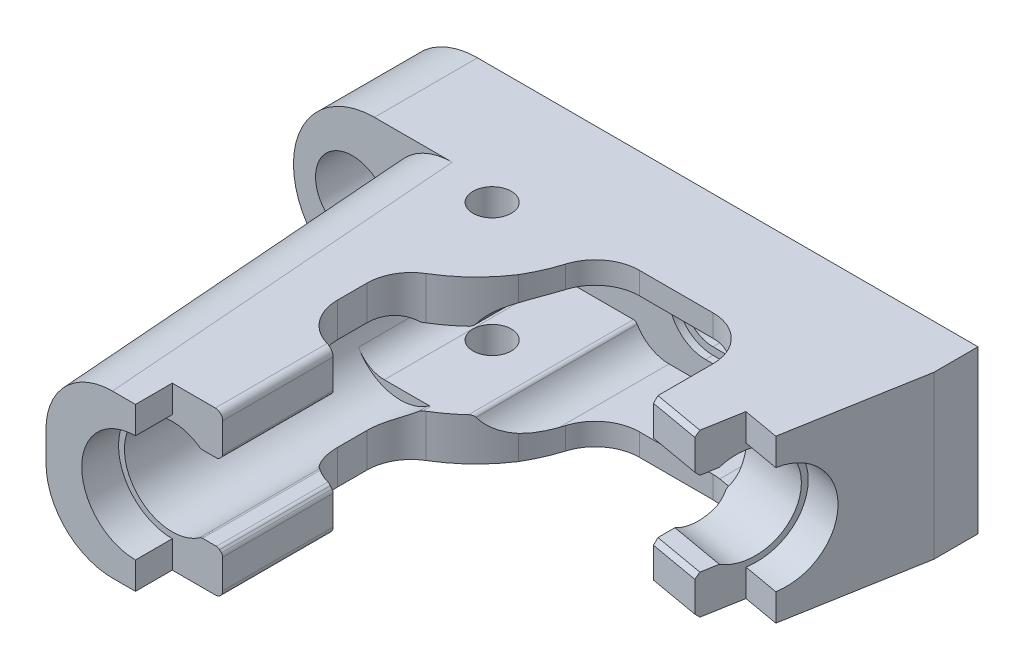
ISO-10303-21;
HEADER;
FILE_DESCRIPTION(('STEP AP214'),'2;1');
FILE_NAME('part.step','',(''),(''),'','','');
FILE_SCHEMA(('AUTOMOTIVE_DESIGN { 1 0 10303 214 1 1 1 1 }'));
ENDSEC;
DATA;
#1=APPLICATION_CONTEXT('core data for automotive mechanical design processes');
#2=APPLICATION_PROTOCOL_DEFINITION('international standard','automotive_design',2000,#1);
#3=PRODUCT_CONTEXT('',#1,'mechanical');
#4=PRODUCT('Part','Part','',(#3));
#5=PRODUCT_RELATED_PRODUCT_CATEGORY('part','',(#4));
#6=PRODUCT_DEFINITION_FORMATION('','',#4);
#7=PRODUCT_DEFINITION_CONTEXT('part definition',#1,'design');
#8=PRODUCT_DEFINITION('design','',#6,#7);
#9=PRODUCT_DEFINITION_SHAPE('','',#8);
#10=(LENGTH_UNIT() NAMED_UNIT(*) SI_UNIT(.MILLI.,.METRE.));
#11=(NAMED_UNIT(*) PLANE_ANGLE_UNIT() SI_UNIT($,.RADIAN.));
#12=(NAMED_UNIT(*) SI_UNIT($,.STERADIAN.) SOLID_ANGLE_UNIT());
#13=UNCERTAINTY_MEASURE_WITH_UNIT(LENGTH_MEASURE(1.E-05),#10,'distance_accuracy_value','');
#14=(GEOMETRIC_REPRESENTATION_CONTEXT(3) GLOBAL_UNCERTAINTY_ASSIGNED_CONTEXT((#13)) GLOBAL_UNIT_ASSIGNED_CONTEXT((#10,
#11,#12)) REPRESENTATION_CONTEXT('',''));
#15=CARTESIAN_POINT('',(0.,0.,0.));
#16=DIRECTION('',(0.,0.,1.));
#17=DIRECTION('',(1.,0.,0.));
#18=AXIS2_PLACEMENT_3D('',#15,#16,#17);
#19=CARTESIAN_POINT('',(17.7757359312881,-8.4,12.));
#20=DIRECTION('',(0.,0.,-1.));
#21=DIRECTION('',(-1.,0.,0.));
#22=AXIS2_PLACEMENT_3D('',#19,#20,#21);
#23=CYLINDRICAL_SURFACE('',#22,0.300000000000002);
#24=CARTESIAN_POINT('',(17.987867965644,-8.18786796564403,21.971001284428));
#25=CARTESIAN_POINT('',(17.9758652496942,-8.17584277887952,21.9689247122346));
#26=CARTESIAN_POINT('',(17.9628494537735,-8.16488869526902,21.9665918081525));
#27=CARTESIAN_POINT('',(17.9352370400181,-8.14535799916,21.9614312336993));
#28=CARTESIAN_POINT('',(17.9206411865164,-8.13678024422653,21.9586038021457));
#29=CARTESIAN_POINT('',(17.8902987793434,-8.12222409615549,21.9524694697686));
#30=CARTESIAN_POINT('',(17.8745520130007,-8.11624618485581,21.9491624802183));
#31=CARTESIAN_POINT('',(17.8423951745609,-8.10702344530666,21.9421222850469));
#32=CARTESIAN_POINT('',(17.8259861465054,-8.10377447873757,21.9383897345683));
#33=CARTESIAN_POINT('',(17.7982500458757,-8.10063110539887,21.931831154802));
#34=CARTESIAN_POINT('',(17.7869810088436,-8.09999500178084,21.9290983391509));
#35=CARTESIAN_POINT('',(17.7757359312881,-8.1,21.9262988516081));
#36=B_SPLINE_CURVE_WITH_KNOTS('',3,(#24,#25,#26,#27,#28,#29,#30,#31,#32,#33,#34,#35),
.UNSPECIFIED.,.F.,.F.,(4,2,2,2,2,4),(0.,0.0512722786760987,0.102519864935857,0.153776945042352,
0.204956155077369,0.239720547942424),.UNSPECIFIED.);
#37=CARTESIAN_POINT('',(17.987867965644,-8.18786796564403,21.971001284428));
#38=VERTEX_POINT('',#37);
#39=CARTESIAN_POINT('',(17.7757359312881,-8.1,21.9262988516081));
#40=VERTEX_POINT('',#39);
#41=EDGE_CURVE('E910',#38,#40,#36,.T.);
#42=ORIENTED_EDGE('',*,*,#41,.T.);
#43=DIRECTION('',(0.,0.,1.));
#44=VECTOR('',#43,1.);
#45=CARTESIAN_POINT('',(17.7757359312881,-8.1,12.));
#46=LINE('',#45,#44);
#47=CARTESIAN_POINT('',(17.7757359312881,-8.1,29.5));
#48=VERTEX_POINT('',#47);
#49=EDGE_CURVE('E1279',#40,#48,#46,.T.);
#50=ORIENTED_EDGE('',*,*,#49,.T.);
#51=CARTESIAN_POINT('',(17.7757359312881,-8.4,29.5));
#52=DIRECTION('',(0.,0.,-1.));
#53=DIRECTION('',(-1.,0.,0.));
#54=AXIS2_PLACEMENT_3D('',#51,#52,#53);
#55=CIRCLE('',#54,0.300000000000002);
#56=CARTESIAN_POINT('',(17.987867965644,-8.18786796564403,29.5));
#57=VERTEX_POINT('',#56);
#58=EDGE_CURVE('E2370',#48,#57,#55,.T.);
#59=ORIENTED_EDGE('',*,*,#58,.T.);
#60=DIRECTION('',(0.,0.,1.));
#61=VECTOR('',#60,1.);
#62=CARTESIAN_POINT('',(17.987867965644,-8.18786796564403,12.));
#63=LINE('',#62,#61);
#64=EDGE_CURVE('E1294',#57,#38,#63,.F.);
#65=ORIENTED_EDGE('',*,*,#64,.T.);
#66=EDGE_LOOP('',(#42,#50,#59,#65));
#67=FACE_BOUND('',#66,.T.);
#68=ADVANCED_FACE('F18',(#67),#23,.T.);
#69=CARTESIAN_POINT('',(17.7757359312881,-2.6,-30.4910232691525));
#70=DIRECTION('',(0.,0.,1.));
#71=DIRECTION('',(1.,0.,0.));
#72=AXIS2_PLACEMENT_3D('',#69,#70,#71);
#73=CYLINDRICAL_SURFACE('',#72,0.300000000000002);
#74=CARTESIAN_POINT('',(17.7757359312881,-2.6,29.5));
#75=DIRECTION('',(0.,0.,1.));
#76=DIRECTION('',(1.,0.,0.));
#77=AXIS2_PLACEMENT_3D('',#74,#75,#76);
#78=CIRCLE('',#77,0.300000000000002);
#79=CARTESIAN_POINT('',(17.987867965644,-2.81213203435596,29.5));
#80=VERTEX_POINT('',#79);
#81=CARTESIAN_POINT('',(17.7757359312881,-2.9,29.5));
#82=VERTEX_POINT('',#81);
#83=EDGE_CURVE('E892',#80,#82,#78,.F.);
#84=ORIENTED_EDGE('',*,*,#83,.T.);
#85=DIRECTION('',(0.,0.,1.));
#86=VECTOR('',#85,1.);
#87=CARTESIAN_POINT('',(17.7757359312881,-2.9,-30.4910232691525));
#88=LINE('',#87,#86);
#89=CARTESIAN_POINT('',(17.7757359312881,-2.9,21.9262988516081));
#90=VERTEX_POINT('',#89);
#91=EDGE_CURVE('E1272',#82,#90,#88,.F.);
#92=ORIENTED_EDGE('',*,*,#91,.T.);
#93=CARTESIAN_POINT('',(17.7757359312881,-2.9,21.9262988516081));
#94=CARTESIAN_POINT('',(17.7926472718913,-2.90001487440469,21.9305121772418));
#95=CARTESIAN_POINT('',(17.8096018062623,-2.89857073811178,21.9345677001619));
#96=CARTESIAN_POINT('',(17.8431433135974,-2.89282060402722,21.942293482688));
#97=CARTESIAN_POINT('',(17.8597295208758,-2.88850913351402,21.9459629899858));
#98=CARTESIAN_POINT('',(17.8920344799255,-2.87707292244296,21.9528351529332));
#99=CARTESIAN_POINT('',(17.9077519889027,-2.86994426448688,21.9560371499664));
#100=CARTESIAN_POINT('',(17.9377667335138,-2.8530628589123,21.9619218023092));
#101=CARTESIAN_POINT('',(17.9520676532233,-2.84331717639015,21.9646058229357));
#102=CARTESIAN_POINT('',(17.9732494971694,-2.82603321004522,21.9684422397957));
#103=CARTESIAN_POINT('',(17.9807391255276,-2.81926734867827,21.9697668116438));
#104=CARTESIAN_POINT('',(17.9878679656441,-2.81213203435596,21.971001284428));
#105=B_SPLINE_CURVE_WITH_KNOTS('',3,(#93,#94,#95,#96,#97,#98,#99,#100,#101,#102,#103,#104),
.UNSPECIFIED.,.F.,.F.,(4,2,2,2,2,4),(0.,0.0522306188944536,0.104561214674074,0.15696483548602,
0.209228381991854,0.239713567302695),.UNSPECIFIED.);
#106=CARTESIAN_POINT('',(17.987867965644,-2.81213203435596,21.971001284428));
#107=VERTEX_POINT('',#106);
#108=EDGE_CURVE('E906',#90,#107,#105,.T.);
#109=ORIENTED_EDGE('',*,*,#108,.T.);
#110=DIRECTION('',(0.,0.,1.));
#111=VECTOR('',#110,1.);
#112=CARTESIAN_POINT('',(17.987867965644,-2.81213203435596,-30.4910232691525));
#113=LINE('',#112,#111);
#114=EDGE_CURVE('E1293',#107,#80,#113,.T.);
#115=ORIENTED_EDGE('',*,*,#114,.T.);
#116=EDGE_LOOP('',(#84,#92,#109,#115));
#117=FACE_BOUND('',#116,.T.);
#118=ADVANCED_FACE('F900',(#117),#73,.T.);
#119=CARTESIAN_POINT('',(18.5951233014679,-2.6,48.));
#120=DIRECTION('',(0.,0.,1.));
#121=DIRECTION('',(1.,0.,0.));
#122=AXIS2_PLACEMENT_3D('',#119,#120,#121);
#123=CYLINDRICAL_SURFACE('',#122,0.300000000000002);
#124=CARTESIAN_POINT('',(18.5951233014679,-2.6,2.));
#125=DIRECTION('',(0.,0.,1.));
#126=DIRECTION('',(1.,0.,0.));
#127=AXIS2_PLACEMENT_3D('',#124,#125,#126);
#128=CIRCLE('',#127,0.300000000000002);
#129=CARTESIAN_POINT('',(18.5951233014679,-2.9,2.));
#130=VERTEX_POINT('',#129);
#131=CARTESIAN_POINT('',(18.8549309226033,-2.75,2.));
#132=VERTEX_POINT('',#131);
#133=EDGE_CURVE('E891',#130,#132,#128,.T.);
#134=ORIENTED_EDGE('',*,*,#133,.T.);
#135=DIRECTION('',(0.,0.,1.));
#136=VECTOR('',#135,1.);
#137=CARTESIAN_POINT('',(18.8549309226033,-2.75,48.));
#138=LINE('',#137,#136);
#139=CARTESIAN_POINT('',(18.8549309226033,-2.75,12.9437376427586));
#140=VERTEX_POINT('',#139);
#141=EDGE_CURVE('E1210',#132,#140,#138,.T.);
#142=ORIENTED_EDGE('',*,*,#141,.T.);
#143=CARTESIAN_POINT('',(18.8549309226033,-2.75,12.9437376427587));
#144=CARTESIAN_POINT('',(18.8454899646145,-2.76630349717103,12.9531582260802));
#145=CARTESIAN_POINT('',(18.8349072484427,-2.78114185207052,12.9636752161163));
#146=CARTESIAN_POINT('',(18.8121076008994,-2.80791179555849,12.9862169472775));
#147=CARTESIAN_POINT('',(18.799905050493,-2.8198666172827,12.9982283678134));
#148=CARTESIAN_POINT('',(18.7706353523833,-2.84424520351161,13.0268757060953));
#149=CARTESIAN_POINT('',(18.7531830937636,-2.85580135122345,13.0438432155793));
#150=CARTESIAN_POINT('',(18.7169657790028,-2.8749101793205,13.0787794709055));
#151=CARTESIAN_POINT('',(18.6981944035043,-2.88244185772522,13.0967529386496));
#152=CARTESIAN_POINT('',(18.6652883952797,-2.89203210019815,13.1280057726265));
#153=CARTESIAN_POINT('',(18.6513273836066,-2.89503270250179,13.1411901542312));
#154=CARTESIAN_POINT('',(18.6232978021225,-2.89900457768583,13.1675070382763));
#155=CARTESIAN_POINT('',(18.6092311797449,-2.89999302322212,13.1806390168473));
#156=CARTESIAN_POINT('',(18.5951233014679,-2.9,13.1937314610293));
#157=B_SPLINE_CURVE_WITH_KNOTS('',3,(#143,#144,#145,#146,#147,#148,#149,#150,#151,#152,#153,
#154,#155,#156),.UNSPECIFIED.,.F.,.F.,(4,2,2,2,2,2,4),(0.,0.0628887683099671,0.125252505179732,
0.205684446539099,0.286532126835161,0.344739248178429,0.402447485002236),.UNSPECIFIED.);
#158=CARTESIAN_POINT('',(18.5951233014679,-2.9,13.1937314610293));
#159=VERTEX_POINT('',#158);
#160=EDGE_CURVE('E884',#140,#159,#157,.T.);
#161=ORIENTED_EDGE('',*,*,#160,.T.);
#162=DIRECTION('',(0.,0.,1.));
#163=VECTOR('',#162,1.);
#164=CARTESIAN_POINT('',(18.5951233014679,-2.9,-30.4910232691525));
#165=LINE('',#164,#163);
#166=EDGE_CURVE('E1216',#159,#130,#165,.F.);
#167=ORIENTED_EDGE('',*,*,#166,.T.);
#168=EDGE_LOOP('',(#134,#142,#161,#167));
#169=FACE_BOUND('',#168,.T.);
#170=ADVANCED_FACE('F895',(#169),#123,.T.);
#171=CARTESIAN_POINT('',(17.9,-2.9,-30.4910232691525));
#172=DIRECTION('',(-0.707106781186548,0.707106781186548,0.));
#173=DIRECTION('',(-0.707106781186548,-0.707106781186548,0.));
#174=AXIS2_PLACEMENT_3D('',#171,#172,#173);
#175=PLANE('',#174);
#176=DIRECTION('',(0.,0.,-1.));
#177=VECTOR('',#176,1.);
#178=CARTESIAN_POINT('',(18.112132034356,-2.68786796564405,10.8537001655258));
#179=LINE('',#178,#177);
#180=CARTESIAN_POINT('',(18.112132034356,-2.68786796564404,29.5));
#181=VERTEX_POINT('',#180);
#182=CARTESIAN_POINT('',(18.112132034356,-2.68786796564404,21.9898584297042));
#183=VERTEX_POINT('',#182);
#184=EDGE_CURVE('E1204',#181,#183,#179,.T.);
#185=ORIENTED_EDGE('',*,*,#184,.F.);
#186=DIRECTION('',(-0.707106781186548,-0.707106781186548,0.));
#187=VECTOR('',#186,1.);
#188=CARTESIAN_POINT('',(17.9,-2.9,29.5));
#189=LINE('',#188,#187);
#190=EDGE_CURVE('E1289',#80,#181,#189,.F.);
#191=ORIENTED_EDGE('',*,*,#190,.F.);
#192=ORIENTED_EDGE('',*,*,#114,.F.);
#193=CARTESIAN_POINT('',(18.5,-2.3,19.0150376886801));
#194=DIRECTION('',(-0.707106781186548,0.707106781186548,0.));
#195=DIRECTION('',(-0.707106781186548,-0.707106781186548,0.));
#196=AXIS2_PLACEMENT_3D('',#193,#194,#195);
#197=ELLIPSE('',#196,4.24264068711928,3.);
#198=EDGE_CURVE('E1292',#183,#107,#197,.F.);
#199=ORIENTED_EDGE('',*,*,#198,.F.);
#200=EDGE_LOOP('',(#185,#191,#192,#199));
#201=FACE_BOUND('',#200,.T.);
#202=ADVANCED_FACE('F899',(#201),#175,.F.);
#203=CARTESIAN_POINT('',(17.9,-8.1,12.));
#204=DIRECTION('',(-0.707106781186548,-0.707106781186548,0.));
#205=DIRECTION('',(0.707106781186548,-0.707106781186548,0.));
#206=AXIS2_PLACEMENT_3D('',#203,#204,#205);
#207=PLANE('',#206);
#208=DIRECTION('',(0.,0.,1.));
#209=VECTOR('',#208,1.);
#210=CARTESIAN_POINT('',(18.112132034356,-8.31213203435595,10.8537001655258));
#211=LINE('',#210,#209);
#212=CARTESIAN_POINT('',(18.112132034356,-8.31213203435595,21.9898584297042));
#213=VERTEX_POINT('',#212);
#214=CARTESIAN_POINT('',(18.112132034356,-8.31213203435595,29.5));
#215=VERTEX_POINT('',#214);
#216=EDGE_CURVE('E1201',#213,#215,#211,.T.);
#217=ORIENTED_EDGE('',*,*,#216,.F.);
#218=CARTESIAN_POINT('',(18.5,-8.69999999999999,19.0150376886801));
#219=DIRECTION('',(-0.707106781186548,-0.707106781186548,0.));
#220=DIRECTION('',(0.707106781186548,-0.707106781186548,0.));
#221=AXIS2_PLACEMENT_3D('',#218,#219,#220);
#222=ELLIPSE('',#221,4.24264068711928,3.);
#223=EDGE_CURVE('E1288',#38,#213,#222,.F.);
#224=ORIENTED_EDGE('',*,*,#223,.F.);
#225=ORIENTED_EDGE('',*,*,#64,.F.);
#226=DIRECTION('',(0.707106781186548,-0.707106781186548,0.));
#227=VECTOR('',#226,1.);
#228=CARTESIAN_POINT('',(17.9,-8.1,29.5));
#229=LINE('',#228,#227);
#230=EDGE_CURVE('E1283',#215,#57,#229,.F.);
#231=ORIENTED_EDGE('',*,*,#230,.F.);
#232=EDGE_LOOP('',(#217,#224,#225,#231));
#233=FACE_BOUND('',#232,.T.);
#234=ADVANCED_FACE('F2243',(#233),#207,.F.);
#235=CARTESIAN_POINT('',(21.4592883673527,-8.1,12.));
#236=DIRECTION('',(0.,-1.,0.));
#237=DIRECTION('',(1.,0.,0.));
#238=AXIS2_PLACEMENT_3D('',#235,#236,#237);
#239=PLANE('',#238);
#240=DIRECTION('',(0.,0.,1.));
#241=VECTOR('',#240,1.);
#242=CARTESIAN_POINT('',(16.8225595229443,-8.1,12.));
#243=LINE('',#242,#241);
#244=CARTESIAN_POINT('',(16.8225595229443,-8.1,29.5));
#245=VERTEX_POINT('',#244);
#246=CARTESIAN_POINT('',(16.8225595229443,-8.1,21.5022436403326));
#247=VERTEX_POINT('',#246);
#248=EDGE_CURVE('E1187',#245,#247,#243,.F.);
#249=ORIENTED_EDGE('',*,*,#248,.F.);
#250=DIRECTION('',(1.,0.,0.));
#251=VECTOR('',#250,1.);
#252=CARTESIAN_POINT('',(21.4592883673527,-8.1,29.5));
#253=LINE('',#252,#251);
#254=EDGE_CURVE('E1282',#48,#245,#253,.F.);
#255=ORIENTED_EDGE('',*,*,#254,.F.);
#256=ORIENTED_EDGE('',*,*,#49,.F.);
#257=CARTESIAN_POINT('',(18.5,-8.1,19.0150376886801));
#258=DIRECTION('',(0.,-1.,0.));
#259=DIRECTION('',(0.,0.,-1.));
#260=AXIS2_PLACEMENT_3D('',#257,#258,#259);
#261=CIRCLE('',#260,3.);
#262=EDGE_CURVE('E1278',#247,#40,#261,.F.);
#263=ORIENTED_EDGE('',*,*,#262,.F.);
#264=EDGE_LOOP('',(#249,#255,#256,#263));
#265=FACE_BOUND('',#264,.T.);
#266=ADVANCED_FACE('F2234',(#265),#239,.F.);
#267=CARTESIAN_POINT('',(2.,-2.9,-30.4910232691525));
#268=DIRECTION('',(0.,1.,0.));
#269=DIRECTION('',(0.,0.,1.));
#270=AXIS2_PLACEMENT_3D('',#267,#268,#269);
#271=PLANE('',#270);
#272=ORIENTED_EDGE('',*,*,#91,.F.);
#273=DIRECTION('',(1.,0.,0.));
#274=VECTOR('',#273,1.);
#275=CARTESIAN_POINT('',(2.,-2.9,29.5));
#276=LINE('',#275,#274);
#277=CARTESIAN_POINT('',(16.8225595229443,-2.9,29.5));
#278=VERTEX_POINT('',#277);
#279=EDGE_CURVE('E1275',#278,#82,#276,.T.);
#280=ORIENTED_EDGE('',*,*,#279,.F.);
#281=DIRECTION('',(0.,0.,1.));
#282=VECTOR('',#281,1.);
#283=CARTESIAN_POINT('',(16.8225595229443,-2.9,12.));
#284=LINE('',#283,#282);
#285=CARTESIAN_POINT('',(16.8225595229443,-2.9,21.5022436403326));
#286=VERTEX_POINT('',#285);
#287=EDGE_CURVE('E1183',#286,#278,#284,.T.);
#288=ORIENTED_EDGE('',*,*,#287,.F.);
#289=CARTESIAN_POINT('',(18.5,-2.9,19.0150376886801));
#290=DIRECTION('',(0.,-1.,0.));
#291=DIRECTION('',(0.,0.,-1.));
#292=AXIS2_PLACEMENT_3D('',#289,#290,#291);
#293=CIRCLE('',#292,3.);
#294=EDGE_CURVE('E1258',#90,#286,#293,.T.);
#295=ORIENTED_EDGE('',*,*,#294,.F.);
#296=EDGE_LOOP('',(#272,#280,#288,#295));
#297=FACE_BOUND('',#296,.T.);
#298=ADVANCED_FACE('F2225',(#297),#271,.F.);
#299=CARTESIAN_POINT('',(28.5,-5.5,1.5));
#300=DIRECTION('',(0.,0.,1.));
#301=DIRECTION('',(1.,0.,0.));
#302=AXIS2_PLACEMENT_3D('',#299,#300,#301);
#303=CYLINDRICAL_SURFACE('',#302,2.5);
#304=CARTESIAN_POINT('',(28.5,-5.5,1.5));
#305=DIRECTION('',(0.,0.,1.));
#306=DIRECTION('',(1.,0.,0.));
#307=AXIS2_PLACEMENT_3D('',#304,#305,#306);
#308=CIRCLE('',#307,2.5);
#309=CARTESIAN_POINT('',(28.5,-8.,1.5));
#310=VERTEX_POINT('',#309);
#311=CARTESIAN_POINT('',(28.5,-3.,1.5));
#312=VERTEX_POINT('',#311);
#313=EDGE_CURVE('E1119',#310,#312,#308,.T.);
#314=ORIENTED_EDGE('',*,*,#313,.F.);
#315=DIRECTION('',(0.,0.,-1.));
#316=VECTOR('',#315,1.);
#317=CARTESIAN_POINT('',(28.5,-8.,1.5));
#318=LINE('',#317,#316);
#319=CARTESIAN_POINT('',(28.5,-8.,2.));
#320=VERTEX_POINT('',#319);
#321=EDGE_CURVE('E1248',#310,#320,#318,.F.);
#322=ORIENTED_EDGE('',*,*,#321,.T.);
#323=CARTESIAN_POINT('',(28.5,-5.5,2.));
#324=DIRECTION('',(0.,0.,1.));
#325=DIRECTION('',(1.,0.,0.));
#326=AXIS2_PLACEMENT_3D('',#323,#324,#325);
#327=CIRCLE('',#326,2.5);
#328=CARTESIAN_POINT('',(28.5,-3.,2.));
#329=VERTEX_POINT('',#328);
#330=EDGE_CURVE('E1160',#329,#320,#327,.F.);
#331=ORIENTED_EDGE('',*,*,#330,.F.);
#332=DIRECTION('',(0.,0.,1.));
#333=VECTOR('',#332,1.);
#334=CARTESIAN_POINT('',(28.5,-3.,1.5));
#335=LINE('',#334,#333);
#336=EDGE_CURVE('E1255',#329,#312,#335,.F.);
#337=ORIENTED_EDGE('',*,*,#336,.T.);
#338=EDGE_LOOP('',(#314,#322,#331,#337));
#339=FACE_BOUND('',#338,.T.);
#340=ADVANCED_FACE('F2216',(#339),#303,.F.);
#341=CARTESIAN_POINT('',(23.5,-3.,1.5));
#342=DIRECTION('',(0.,1.,0.));
#343=DIRECTION('',(0.,0.,1.));
#344=AXIS2_PLACEMENT_3D('',#341,#342,#343);
#345=PLANE('',#344);
#346=DIRECTION('',(0.,0.,1.));
#347=VECTOR('',#346,1.);
#348=CARTESIAN_POINT('',(23.5,-3.,1.5));
#349=LINE('',#348,#347);
#350=CARTESIAN_POINT('',(23.5,-3.,2.));
#351=VERTEX_POINT('',#350);
#352=CARTESIAN_POINT('',(23.5,-3.,1.5));
#353=VERTEX_POINT('',#352);
#354=EDGE_CURVE('E1249',#351,#353,#349,.F.);
#355=ORIENTED_EDGE('',*,*,#354,.T.);
#356=DIRECTION('',(1.,0.,0.));
#357=VECTOR('',#356,1.);
#358=CARTESIAN_POINT('',(26.395,-3.,1.5));
#359=LINE('',#358,#357);
#360=EDGE_CURVE('E1117',#312,#353,#359,.F.);
#361=ORIENTED_EDGE('',*,*,#360,.F.);
#362=ORIENTED_EDGE('',*,*,#336,.F.);
#363=DIRECTION('',(1.,0.,0.));
#364=VECTOR('',#363,1.);
#365=CARTESIAN_POINT('',(0.,-3.,2.));
#366=LINE('',#365,#364);
#367=EDGE_CURVE('E1161',#351,#329,#366,.T.);
#368=ORIENTED_EDGE('',*,*,#367,.F.);
#369=EDGE_LOOP('',(#355,#361,#362,#368));
#370=FACE_BOUND('',#369,.T.);
#371=ADVANCED_FACE('F2207',(#370),#345,.F.);
#372=CARTESIAN_POINT('',(23.5,-5.5,1.5));
#373=DIRECTION('',(0.,0.,1.));
#374=DIRECTION('',(1.,0.,0.));
#375=AXIS2_PLACEMENT_3D('',#372,#373,#374);
#376=CYLINDRICAL_SURFACE('',#375,2.5);
#377=DIRECTION('',(0.,0.,-1.));
#378=VECTOR('',#377,1.);
#379=CARTESIAN_POINT('',(23.5,-8.,1.5));
#380=LINE('',#379,#378);
#381=CARTESIAN_POINT('',(23.5,-8.,2.));
#382=VERTEX_POINT('',#381);
#383=CARTESIAN_POINT('',(23.5,-8.,1.5));
#384=VERTEX_POINT('',#383);
#385=EDGE_CURVE('E1245',#382,#384,#380,.T.);
#386=ORIENTED_EDGE('',*,*,#385,.T.);
#387=CARTESIAN_POINT('',(23.5,-5.5,1.5));
#388=DIRECTION('',(0.,0.,1.));
#389=DIRECTION('',(1.,0.,0.));
#390=AXIS2_PLACEMENT_3D('',#387,#388,#389);
#391=CIRCLE('',#390,2.5);
#392=EDGE_CURVE('E1116',#353,#384,#391,.T.);
#393=ORIENTED_EDGE('',*,*,#392,.F.);
#394=ORIENTED_EDGE('',*,*,#354,.F.);
#395=CARTESIAN_POINT('',(23.5,-5.5,2.));
#396=DIRECTION('',(0.,0.,1.));
#397=DIRECTION('',(1.,0.,0.));
#398=AXIS2_PLACEMENT_3D('',#395,#396,#397);
#399=CIRCLE('',#398,2.5);
#400=EDGE_CURVE('E1156',#382,#351,#399,.F.);
#401=ORIENTED_EDGE('',*,*,#400,.F.);
#402=EDGE_LOOP('',(#386,#393,#394,#401));
#403=FACE_BOUND('',#402,.T.);
#404=ADVANCED_FACE('F2199',(#403),#376,.F.);
#405=CARTESIAN_POINT('',(23.5,-8.,1.5));
#406=DIRECTION('',(0.,-1.,0.));
#407=DIRECTION('',(0.,0.,-1.));
#408=AXIS2_PLACEMENT_3D('',#405,#406,#407);
#409=PLANE('',#408);
#410=ORIENTED_EDGE('',*,*,#321,.F.);
#411=DIRECTION('',(1.,0.,0.));
#412=VECTOR('',#411,1.);
#413=CARTESIAN_POINT('',(26.395,-8.,1.5));
#414=LINE('',#413,#412);
#415=EDGE_CURVE('E1113',#384,#310,#414,.T.);
#416=ORIENTED_EDGE('',*,*,#415,.F.);
#417=ORIENTED_EDGE('',*,*,#385,.F.);
#418=DIRECTION('',(1.,0.,0.));
#419=VECTOR('',#418,1.);
#420=CARTESIAN_POINT('',(0.,-8.,2.));
#421=LINE('',#420,#419);
#422=EDGE_CURVE('E1157',#320,#382,#421,.F.);
#423=ORIENTED_EDGE('',*,*,#422,.F.);
#424=EDGE_LOOP('',(#410,#416,#417,#423));
#425=FACE_BOUND('',#424,.T.);
#426=ADVANCED_FACE('F2191',(#425),#409,.F.);
#427=CARTESIAN_POINT('',(29.5,-4.,14.043838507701));
#428=DIRECTION('',(0.,0.,1.));
#429=DIRECTION('',(1.,0.,0.));
#430=AXIS2_PLACEMENT_3D('',#427,#428,#429);
#431=CYLINDRICAL_SURFACE('',#430,2.5);
#432=DIRECTION('',(0.,0.,1.));
#433=VECTOR('',#432,1.);
#434=CARTESIAN_POINT('',(29.5,-1.5,48.));
#435=LINE('',#434,#433);
#436=CARTESIAN_POINT('',(29.5,-1.5,2.));
#437=VERTEX_POINT('',#436);
#438=CARTESIAN_POINT('',(29.5,-1.5,7.04196010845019));
#439=VERTEX_POINT('',#438);
#440=EDGE_CURVE('E1220',#437,#439,#435,.T.);
#441=ORIENTED_EDGE('',*,*,#440,.F.);
#442=CARTESIAN_POINT('',(29.5,-4.,2.));
#443=DIRECTION('',(0.,0.,1.));
#444=DIRECTION('',(1.,0.,0.));
#445=AXIS2_PLACEMENT_3D('',#442,#443,#444);
#446=CIRCLE('',#445,2.5);
#447=CARTESIAN_POINT('',(32.,-4.,2.));
#448=VERTEX_POINT('',#447);
#449=EDGE_CURVE('E1170',#448,#437,#446,.T.);
#450=ORIENTED_EDGE('',*,*,#449,.F.);
#451=DIRECTION('',(0.,0.,1.));
#452=VECTOR('',#451,1.);
#453=CARTESIAN_POINT('',(32.,-4.,14.043838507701));
#454=LINE('',#453,#452);
#455=CARTESIAN_POINT('',(32.,-4.,8.06994093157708));
#456=VERTEX_POINT('',#455);
#457=EDGE_CURVE('E1149',#456,#448,#454,.F.);
#458=ORIENTED_EDGE('',*,*,#457,.F.);
#459=CARTESIAN_POINT('',(31.7818225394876,-2.97858632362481,8.87685114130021));
#460=CARTESIAN_POINT('',(31.8043377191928,-3.02886547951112,8.81803714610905));
#461=CARTESIAN_POINT('',(31.8258964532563,-3.08150410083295,8.7608404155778));
#462=CARTESIAN_POINT('',(31.8663215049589,-3.19133330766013,8.64980013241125));
#463=CARTESIAN_POINT('',(31.8851837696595,-3.24853054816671,8.595961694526));
#464=CARTESIAN_POINT('',(31.9190155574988,-3.36594777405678,8.49299496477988));
#465=CARTESIAN_POINT('',(31.9340567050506,-3.42608218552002,8.44379294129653));
#466=CARTESIAN_POINT('',(31.95998513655,-3.55002599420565,8.3491598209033));
#467=CARTESIAN_POINT('',(31.9708761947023,-3.61383199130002,8.30372532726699));
#468=CARTESIAN_POINT('',(31.9859907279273,-3.73067505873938,8.22614860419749));
#469=CARTESIAN_POINT('',(31.9911430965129,-3.78308801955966,8.19324500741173));
#470=CARTESIAN_POINT('',(31.9981634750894,-3.89007832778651,8.12974255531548));
#471=CARTESIAN_POINT('',(32.0000046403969,-3.94466973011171,8.09916444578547));
#472=CARTESIAN_POINT('',(32.,-4.,8.06994093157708));
#473=B_SPLINE_CURVE_WITH_KNOTS('',3,(#459,#460,#461,#462,#463,#464,#465,#466,#467,#468,#469,
#470,#471,#472),.UNSPECIFIED.,.F.,.F.,(4,2,2,2,2,2,4),(0.,0.241738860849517,0.483837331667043,
0.72099217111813,0.957930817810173,1.14407018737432,1.33171194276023),.UNSPECIFIED.);
#474=CARTESIAN_POINT('',(31.7818225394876,-2.97858632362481,8.87685114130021));
#475=VERTEX_POINT('',#474);
#476=EDGE_CURVE('E1252',#475,#456,#473,.T.);
#477=ORIENTED_EDGE('',*,*,#476,.F.);
#478=CARTESIAN_POINT('',(31.7818225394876,-2.97858632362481,8.87685114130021));
#479=CARTESIAN_POINT('',(31.7516774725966,-2.91127122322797,8.80221572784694));
#480=CARTESIAN_POINT('',(31.7183050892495,-2.8446820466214,8.728187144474));
#481=CARTESIAN_POINT('',(31.6448124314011,-2.71335039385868,8.58165105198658));
#482=CARTESIAN_POINT('',(31.6046825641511,-2.64861069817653,8.50914587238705));
#483=CARTESIAN_POINT('',(31.5170142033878,-2.52090943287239,8.36543849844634));
#484=CARTESIAN_POINT('',(31.4694031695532,-2.45797327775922,8.29425762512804));
#485=CARTESIAN_POINT('',(31.366844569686,-2.33528331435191,8.15458653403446));
#486=CARTESIAN_POINT('',(31.3119013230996,-2.27552766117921,8.08609476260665));
#487=CARTESIAN_POINT('',(31.1635865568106,-2.12963543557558,7.9173838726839));
#488=CARTESIAN_POINT('',(31.0651474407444,-2.04604999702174,7.81930965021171));
#489=CARTESIAN_POINT('',(30.8500507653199,-1.8917314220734,7.6341286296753));
#490=CARTESIAN_POINT('',(30.7334534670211,-1.82095739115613,7.5469872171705));
#491=CARTESIAN_POINT('',(30.5073268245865,-1.70917822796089,7.40343606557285));
#492=CARTESIAN_POINT('',(30.4010471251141,-1.66505030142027,7.34436557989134));
#493=CARTESIAN_POINT('',(30.1781452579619,-1.5908848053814,7.23827648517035));
#494=CARTESIAN_POINT('',(30.0615475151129,-1.5608149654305,7.19123038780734));
#495=CARTESIAN_POINT('',(29.8698443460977,-1.52644701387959,7.12789011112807));
#496=CARTESIAN_POINT('',(29.7972389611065,-1.51663913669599,7.10688342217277));
#497=CARTESIAN_POINT('',(29.6499493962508,-1.50339874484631,7.07026109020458));
#498=CARTESIAN_POINT('',(29.5752610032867,-1.4999802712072,7.05465738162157));
#499=CARTESIAN_POINT('',(29.5,-1.5,7.0419601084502));
#500=B_SPLINE_CURVE_WITH_KNOTS('',3,(#478,#479,#480,#481,#482,#483,#484,#485,#486,#487,#488,
#489,#490,#491,#492,#493,#494,#495,#496,#497,#498,#499),.UNSPECIFIED.,.F.,.F.,(4,2,2,2,2,2,2,2,
2,2,4),(0.,0.314781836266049,0.630014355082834,0.948517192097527,1.26683321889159,
1.75165892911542,2.23490866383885,2.62151646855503,3.00723240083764,3.23543557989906,
3.46413965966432),.UNSPECIFIED.);
#501=EDGE_CURVE('E970',#475,#439,#500,.T.);
#502=ORIENTED_EDGE('',*,*,#501,.T.);
#503=EDGE_LOOP('',(#441,#450,#458,#477,#502));
#504=FACE_BOUND('',#503,.T.);
#505=ADVANCED_FACE('F981',(#504),#431,.F.);
#506=CARTESIAN_POINT('',(32.,-1.5,48.));
#507=DIRECTION('',(0.,-1.,0.));
#508=DIRECTION('',(1.,0.,0.));
#509=AXIS2_PLACEMENT_3D('',#506,#507,#508);
#510=PLANE('',#509);
#511=CARTESIAN_POINT('',(29.,-1.5,10.));
#512=DIRECTION('',(0.,1.,0.));
#513=DIRECTION('',(-1.,0.,0.));
#514=AXIS2_PLACEMENT_3D('',#511,#512,#513);
#515=CIRCLE('',#514,3.);
#516=CARTESIAN_POINT('',(29.,-1.5,7.));
#517=VERTEX_POINT('',#516);
#518=EDGE_CURVE('E966',#439,#517,#515,.T.);
#519=ORIENTED_EDGE('',*,*,#518,.T.);
#520=DIRECTION('',(1.,0.,0.));
#521=VECTOR('',#520,1.);
#522=CARTESIAN_POINT('',(32.,-1.5,7.));
#523=LINE('',#522,#521);
#524=CARTESIAN_POINT('',(24.,-1.5,7.));
#525=VERTEX_POINT('',#524);
#526=EDGE_CURVE('E969',#525,#517,#523,.T.);
#527=ORIENTED_EDGE('',*,*,#526,.F.);
#528=CARTESIAN_POINT('',(24.,-1.5,10.));
#529=DIRECTION('',(0.,-1.,0.));
#530=DIRECTION('',(0.,0.,-1.));
#531=AXIS2_PLACEMENT_3D('',#528,#529,#530);
#532=CIRCLE('',#531,3.);
#533=CARTESIAN_POINT('',(21.1278130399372,-1.5,9.13366169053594));
#534=VERTEX_POINT('',#533);
#535=EDGE_CURVE('E962',#525,#534,#532,.F.);
#536=ORIENTED_EDGE('',*,*,#535,.T.);
#537=CARTESIAN_POINT('',(11.5538565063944,-1.5,6.24586732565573));
#538=DIRECTION('',(0.,-1.,0.));
#539=DIRECTION('',(0.,0.,-1.));
#540=AXIS2_PLACEMENT_3D('',#537,#538,#539);
#541=CIRCLE('',#540,10.);
#542=CARTESIAN_POINT('',(21.0199944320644,-1.5,9.46956594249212));
#543=VERTEX_POINT('',#542);
#544=EDGE_CURVE('E1222',#534,#543,#541,.T.);
#545=ORIENTED_EDGE('',*,*,#544,.T.);
#546=DIRECTION('',(0.,0.,1.));
#547=VECTOR('',#546,1.);
#548=CARTESIAN_POINT('',(21.0199944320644,-1.5,48.));
#549=LINE('',#548,#547);
#550=CARTESIAN_POINT('',(21.0199944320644,-1.5,2.));
#551=VERTEX_POINT('',#550);
#552=EDGE_CURVE('E1213',#543,#551,#549,.F.);
#553=ORIENTED_EDGE('',*,*,#552,.T.);
#554=DIRECTION('',(1.,0.,0.));
#555=VECTOR('',#554,1.);
#556=CARTESIAN_POINT('',(0.,-1.5,2.));
#557=LINE('',#556,#555);
#558=EDGE_CURVE('E1168',#437,#551,#557,.F.);
#559=ORIENTED_EDGE('',*,*,#558,.F.);
#560=ORIENTED_EDGE('',*,*,#440,.T.);
#561=EDGE_LOOP('',(#519,#527,#536,#545,#553,#559,#560));
#562=FACE_BOUND('',#561,.T.);
#563=ADVANCED_FACE('F2176',(#562),#510,.T.);
#564=CARTESIAN_POINT('',(2.,-2.9,-30.4910232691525));
#565=DIRECTION('',(0.,1.,0.));
#566=DIRECTION('',(0.,0.,1.));
#567=AXIS2_PLACEMENT_3D('',#564,#565,#566);
#568=PLANE('',#567);
#569=DIRECTION('',(0.,0.,1.));
#570=VECTOR('',#569,1.);
#571=CARTESIAN_POINT('',(13.6784143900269,-2.9,12.));
#572=LINE('',#571,#570);
#573=CARTESIAN_POINT('',(13.6784143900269,-2.9,14.));
#574=VERTEX_POINT('',#573);
#575=CARTESIAN_POINT('',(13.6784143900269,-2.9,2.));
#576=VERTEX_POINT('',#575);
#577=EDGE_CURVE('E1195',#574,#576,#572,.F.);
#578=ORIENTED_EDGE('',*,*,#577,.T.);
#579=DIRECTION('',(1.,0.,0.));
#580=VECTOR('',#579,1.);
#581=CARTESIAN_POINT('',(0.,-2.9,2.));
#582=LINE('',#581,#580);
#583=EDGE_CURVE('E1165',#130,#576,#582,.F.);
#584=ORIENTED_EDGE('',*,*,#583,.F.);
#585=ORIENTED_EDGE('',*,*,#166,.F.);
#586=CARTESIAN_POINT('',(11.7924904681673,-2.9,5.86405298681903));
#587=DIRECTION('',(0.,1.,0.));
#588=DIRECTION('',(-1.,0.,0.));
#589=AXIS2_PLACEMENT_3D('',#586,#587,#588);
#590=CIRCLE('',#589,10.);
#591=CARTESIAN_POINT('',(16.9521131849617,-2.9,14.4301660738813));
#592=VERTEX_POINT('',#591);
#593=EDGE_CURVE('E960',#592,#159,#590,.T.);
#594=ORIENTED_EDGE('',*,*,#593,.F.);
#595=CARTESIAN_POINT('',(18.5,-2.9,17.));
#596=DIRECTION('',(0.,1.,0.));
#597=DIRECTION('',(-1.,0.,0.));
#598=AXIS2_PLACEMENT_3D('',#595,#596,#597);
#599=CIRCLE('',#598,3.);
#600=CARTESIAN_POINT('',(16.8225595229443,-2.9,14.5127940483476));
#601=VERTEX_POINT('',#600);
#602=EDGE_CURVE('E1219',#601,#592,#599,.F.);
#603=ORIENTED_EDGE('',*,*,#602,.F.);
#604=DIRECTION('',(0.,0.,1.));
#605=VECTOR('',#604,1.);
#606=CARTESIAN_POINT('',(16.8225595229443,-2.9,12.));
#607=LINE('',#606,#605);
#608=CARTESIAN_POINT('',(16.8225595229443,-2.9,14.));
#609=VERTEX_POINT('',#608);
#610=EDGE_CURVE('E1197',#609,#601,#607,.T.);
#611=ORIENTED_EDGE('',*,*,#610,.F.);
#612=DIRECTION('',(1.,0.,0.));
#613=VECTOR('',#612,1.);
#614=CARTESIAN_POINT('',(16.8225595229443,-2.9,14.));
#615=LINE('',#614,#613);
#616=EDGE_CURVE('E1192',#574,#609,#615,.T.);
#617=ORIENTED_EDGE('',*,*,#616,.F.);
#618=EDGE_LOOP('',(#578,#584,#585,#594,#603,#611,#617));
#619=FACE_BOUND('',#618,.T.);
#620=CARTESIAN_POINT('',(15.,-2.9,8.));
#621=DIRECTION('',(0.,-1.,0.));
#622=DIRECTION('',(1.,0.,0.));
#623=AXIS2_PLACEMENT_3D('',#620,#621,#622);
#624=CIRCLE('',#623,1.3);
#625=CARTESIAN_POINT('',(16.3,-2.9,8.));
#626=VERTEX_POINT('',#625);
#627=EDGE_CURVE('E979',#626,#626,#624,.F.);
#628=ORIENTED_EDGE('',*,*,#627,.T.);
#629=EDGE_LOOP('',(#628));
#630=FACE_BOUND('',#629,.T.);
#631=ADVANCED_FACE('F949',(#619,#630),#568,.F.);
#632=CARTESIAN_POINT('',(21.0199944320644,-4.,48.));
#633=DIRECTION('',(0.,0.,1.));
#634=DIRECTION('',(1.,0.,0.));
#635=AXIS2_PLACEMENT_3D('',#632,#633,#634);
#636=CYLINDRICAL_SURFACE('',#635,2.5);
#637=ORIENTED_EDGE('',*,*,#141,.F.);
#638=CARTESIAN_POINT('',(21.0199944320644,-4.,2.));
#639=DIRECTION('',(0.,0.,1.));
#640=DIRECTION('',(1.,0.,0.));
#641=AXIS2_PLACEMENT_3D('',#638,#639,#640);
#642=CIRCLE('',#641,2.5);
#643=EDGE_CURVE('E1167',#551,#132,#642,.T.);
#644=ORIENTED_EDGE('',*,*,#643,.F.);
#645=ORIENTED_EDGE('',*,*,#552,.F.);
#646=CARTESIAN_POINT('',(20.1510073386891,-1.65588792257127,11.3536063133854));
#647=CARTESIAN_POINT('',(20.1947879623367,-1.63966444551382,11.2799208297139));
#648=CARTESIAN_POINT('',(20.2377685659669,-1.62511873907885,11.2054153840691));
#649=CARTESIAN_POINT('',(20.3219924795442,-1.59901216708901,11.0549435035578));
#650=CARTESIAN_POINT('',(20.3632363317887,-1.58745036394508,10.9789775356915));
#651=CARTESIAN_POINT('',(20.483803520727,-1.55677184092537,10.7498357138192));
#652=CARTESIAN_POINT('',(20.560392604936,-1.54151094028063,10.5946928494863));
#653=CARTESIAN_POINT('',(20.7055616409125,-1.51876534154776,10.2802557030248));
#654=CARTESIAN_POINT('',(20.774143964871,-1.51127833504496,10.1209626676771));
#655=CARTESIAN_POINT('',(20.8709190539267,-1.50423841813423,9.87904003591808));
#656=CARTESIAN_POINT('',(20.9022308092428,-1.50259137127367,9.79769716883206));
#657=CARTESIAN_POINT('',(20.9627191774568,-1.50047342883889,9.63421479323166));
#658=CARTESIAN_POINT('',(20.9918960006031,-1.50000241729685,9.55207536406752));
#659=CARTESIAN_POINT('',(21.0199944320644,-1.5,9.46956594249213));
#660=B_SPLINE_CURVE_WITH_KNOTS('',3,(#646,#647,#648,#649,#650,#651,#652,#653,#654,#655,#656,
#657,#658,#659),.UNSPECIFIED.,.F.,.F.,(4,2,2,2,2,2,4),(0.,0.261639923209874,0.523197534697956,
1.04375623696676,1.56416031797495,1.82565848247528,2.08713085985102),.UNSPECIFIED.);
#661=CARTESIAN_POINT('',(20.1510073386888,-1.65588792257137,11.3536063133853));
#662=VERTEX_POINT('',#661);
#663=EDGE_CURVE('E954',#662,#543,#660,.T.);
#664=ORIENTED_EDGE('',*,*,#663,.F.);
#665=CARTESIAN_POINT('',(18.8549309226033,-2.75,12.9437376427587));
#666=CARTESIAN_POINT('',(18.8905198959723,-2.68835277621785,12.9082410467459));
#667=CARTESIAN_POINT('',(18.9280714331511,-2.62939582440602,12.8702395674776));
#668=CARTESIAN_POINT('',(19.006202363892,-2.51699175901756,12.7897648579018));
#669=CARTESIAN_POINT('',(19.0467757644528,-2.46353421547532,12.747300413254));
#670=CARTESIAN_POINT('',(19.1710282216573,-2.31233288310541,12.6147336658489));
#671=CARTESIAN_POINT('',(19.2580236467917,-2.22246354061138,12.5186904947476));
#672=CARTESIAN_POINT('',(19.4636625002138,-2.03716718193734,12.281598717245));
#673=CARTESIAN_POINT('',(19.5835410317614,-1.94912952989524,12.1359721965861));
#674=CARTESIAN_POINT('',(19.821116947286,-1.80174922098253,11.8288743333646));
#675=CARTESIAN_POINT('',(19.9388064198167,-1.74249634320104,11.6673552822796));
#676=CARTESIAN_POINT('',(20.069304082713,-1.68774851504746,11.4761142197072));
#677=CARTESIAN_POINT('',(20.0857804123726,-1.6810447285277,11.4517373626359));
#678=CARTESIAN_POINT('',(20.1185334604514,-1.66811692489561,11.4028133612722));
#679=CARTESIAN_POINT('',(20.1348105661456,-1.6618917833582,11.3782667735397));
#680=CARTESIAN_POINT('',(20.1510073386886,-1.65588792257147,11.3536063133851));
#681=B_SPLINE_CURVE_WITH_KNOTS('',3,(#665,#666,#667,#668,#669,#670,#671,#672,#673,#674,#675,
#676,#677,#678,#679,#680),.UNSPECIFIED.,.F.,.F.,(4,2,2,2,2,2,2,4),(0.,0.238375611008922,
0.476290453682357,0.947103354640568,1.56826067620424,2.19134313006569,2.28187500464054,
2.37218725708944),.UNSPECIFIED.);
#682=EDGE_CURVE('E860',#140,#662,#681,.T.);
#683=ORIENTED_EDGE('',*,*,#682,.F.);
#684=EDGE_LOOP('',(#637,#644,#645,#664,#683));
#685=FACE_BOUND('',#684,.T.);
#686=ADVANCED_FACE('F944',(#685),#636,.F.);
#687=CARTESIAN_POINT('',(17.9,-2.47573593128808,10.8537001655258));
#688=DIRECTION('',(0.,0.,-1.));
#689=DIRECTION('',(-1.,0.,0.));
#690=AXIS2_PLACEMENT_3D('',#687,#688,#689);
#691=CYLINDRICAL_SURFACE('',#690,0.300000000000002);
#692=CARTESIAN_POINT('',(18.112132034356,-2.68786796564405,21.9898584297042));
#693=CARTESIAN_POINT('',(18.1239715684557,-2.67605056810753,21.9914010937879));
#694=CARTESIAN_POINT('',(18.1348109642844,-2.6632117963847,21.9927432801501));
#695=CARTESIAN_POINT('',(18.1542280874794,-2.63588170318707,21.9950610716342));
#696=CARTESIAN_POINT('',(18.1628042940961,-2.6213892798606,21.9960364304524));
#697=CARTESIAN_POINT('',(18.1774224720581,-2.59114779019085,21.9976535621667));
#698=CARTESIAN_POINT('',(18.1834625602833,-2.57539780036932,21.9982950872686));
#699=CARTESIAN_POINT('',(18.1928120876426,-2.54312954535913,21.9992727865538));
#700=CARTESIAN_POINT('',(18.1961270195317,-2.52661289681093,21.9996095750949));
#701=CARTESIAN_POINT('',(18.1993490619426,-2.4985857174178,21.9999342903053));
#702=CARTESIAN_POINT('',(18.2000057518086,-2.48715819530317,21.9999992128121));
#703=CARTESIAN_POINT('',(18.2,-2.47573593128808,22.));
#704=B_SPLINE_CURVE_WITH_KNOTS('',3,(#692,#693,#694,#695,#696,#697,#698,#699,#700,#701,#702,
#703),.UNSPECIFIED.,.F.,.F.,(4,2,2,2,2,4),(0.,0.0503314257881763,0.100696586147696,
0.151099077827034,0.201399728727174,0.235661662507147),.UNSPECIFIED.);
#705=CARTESIAN_POINT('',(18.2,-2.47573593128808,22.));
#706=VERTEX_POINT('',#705);
#707=EDGE_CURVE('E937',#183,#706,#704,.T.);
#708=ORIENTED_EDGE('',*,*,#707,.T.);
#709=DIRECTION('',(0.,0.,1.));
#710=VECTOR('',#709,1.);
#711=CARTESIAN_POINT('',(18.2,-2.47573593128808,10.8537001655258));
#712=LINE('',#711,#710);
#713=CARTESIAN_POINT('',(18.2,-2.47573593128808,29.5));
#714=VERTEX_POINT('',#713);
#715=EDGE_CURVE('E1060',#706,#714,#712,.T.);
#716=ORIENTED_EDGE('',*,*,#715,.T.);
#717=CARTESIAN_POINT('',(17.9,-2.47573593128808,29.5));
#718=DIRECTION('',(0.,0.,-1.));
#719=DIRECTION('',(-1.,0.,0.));
#720=AXIS2_PLACEMENT_3D('',#717,#718,#719);
#721=CIRCLE('',#720,0.300000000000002);
#722=EDGE_CURVE('E1207',#714,#181,#721,.T.);
#723=ORIENTED_EDGE('',*,*,#722,.T.);
#724=ORIENTED_EDGE('',*,*,#184,.T.);
#725=EDGE_LOOP('',(#708,#716,#723,#724));
#726=FACE_BOUND('',#725,.T.);
#727=ADVANCED_FACE('F941',(#726),#691,.T.);
#728=CARTESIAN_POINT('',(17.9,-8.52426406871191,10.8537001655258));
#729=DIRECTION('',(0.,0.,1.));
#730=DIRECTION('',(1.,0.,0.));
#731=AXIS2_PLACEMENT_3D('',#728,#729,#730);
#732=CYLINDRICAL_SURFACE('',#731,0.300000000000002);
#733=CARTESIAN_POINT('',(17.9,-8.52426406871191,29.5));
#734=DIRECTION('',(0.,0.,1.));
#735=DIRECTION('',(1.,0.,0.));
#736=AXIS2_PLACEMENT_3D('',#733,#734,#735);
#737=CIRCLE('',#736,0.300000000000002);
#738=CARTESIAN_POINT('',(18.2,-8.52426406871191,29.5));
#739=VERTEX_POINT('',#738);
#740=EDGE_CURVE('E1200',#215,#739,#737,.F.);
#741=ORIENTED_EDGE('',*,*,#740,.T.);
#742=DIRECTION('',(0.,0.,1.));
#743=VECTOR('',#742,1.);
#744=CARTESIAN_POINT('',(18.2,-8.52426406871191,10.8537001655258));
#745=LINE('',#744,#743);
#746=CARTESIAN_POINT('',(18.2,-8.52426406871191,22.));
#747=VERTEX_POINT('',#746);
#748=EDGE_CURVE('E1049',#739,#747,#745,.F.);
#749=ORIENTED_EDGE('',*,*,#748,.T.);
#750=CARTESIAN_POINT('',(18.2,-8.52426406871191,22.));
#751=CARTESIAN_POINT('',(18.2000150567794,-8.50747980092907,21.9999974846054));
#752=CARTESIAN_POINT('',(18.198592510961,-8.49069965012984,21.9998584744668));
#753=CARTESIAN_POINT('',(18.1929774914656,-8.45760409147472,21.9992882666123));
#754=CARTESIAN_POINT('',(18.1887834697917,-8.44128894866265,21.9988569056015));
#755=CARTESIAN_POINT('',(18.1777271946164,-8.40958881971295,21.9976823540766));
#756=CARTESIAN_POINT('',(18.1708631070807,-8.39420448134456,21.9969389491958));
#757=CARTESIAN_POINT('',(18.1546845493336,-8.36484193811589,21.9951087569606));
#758=CARTESIAN_POINT('',(18.1453749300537,-8.35086102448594,21.994022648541));
#759=CARTESIAN_POINT('',(18.127859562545,-8.32878305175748,21.9918753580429));
#760=CARTESIAN_POINT('',(18.1202259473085,-8.32021744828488,21.9909135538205));
#761=CARTESIAN_POINT('',(18.112132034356,-8.31213203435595,21.9898584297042));
#762=B_SPLINE_CURVE_WITH_KNOTS('',3,(#750,#751,#752,#753,#754,#755,#756,#757,#758,#759,#760,
#761),.UNSPECIFIED.,.F.,.F.,(4,2,2,2,2,4),(0.,0.0502862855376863,0.100600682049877,
0.150949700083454,0.201199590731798,0.235661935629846),.UNSPECIFIED.);
#763=EDGE_CURVE('E799',#747,#213,#762,.T.);
#764=ORIENTED_EDGE('',*,*,#763,.T.);
#765=ORIENTED_EDGE('',*,*,#216,.T.);
#766=EDGE_LOOP('',(#741,#749,#764,#765));
#767=FACE_BOUND('',#766,.T.);
#768=ADVANCED_FACE('F841',(#767),#732,.T.);
#769=CARTESIAN_POINT('',(16.8225595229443,-2.6,12.));
#770=DIRECTION('',(0.,0.,1.));
#771=DIRECTION('',(1.,0.,0.));
#772=AXIS2_PLACEMENT_3D('',#769,#770,#771);
#773=CYLINDRICAL_SURFACE('',#772,0.300000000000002);
#774=CARTESIAN_POINT('',(16.8225595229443,-2.9,14.5127940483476));
#775=CARTESIAN_POINT('',(16.8011824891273,-2.89998912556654,14.5271942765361));
#776=CARTESIAN_POINT('',(16.7799932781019,-2.89771546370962,14.541902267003));
#777=CARTESIAN_POINT('',(16.73906002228,-2.88889136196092,14.5710729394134));
#778=CARTESIAN_POINT('',(16.719294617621,-2.88243461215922,14.5855340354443));
#779=CARTESIAN_POINT('',(16.691514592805,-2.87003638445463,14.6063617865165));
#780=CARTESIAN_POINT('',(16.6828960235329,-2.86568452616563,14.6128999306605));
#781=CARTESIAN_POINT('',(16.6659514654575,-2.85606557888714,14.6258937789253));
#782=CARTESIAN_POINT('',(16.6576293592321,-2.85078960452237,14.6323479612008));
#783=CARTESIAN_POINT('',(16.6495263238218,-2.84507042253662,14.6386979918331));
#784=B_SPLINE_CURVE_WITH_KNOTS('',3,(#774,#775,#776,#777,#778,#779,#780,#781,#782,#783),
.UNSPECIFIED.,.F.,.F.,(4,2,2,2,4),(0.,0.0772660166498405,0.1528586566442,0.187806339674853,
0.223110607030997),.UNSPECIFIED.);
#785=CARTESIAN_POINT('',(16.6495263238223,-2.84507042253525,14.638697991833));
#786=VERTEX_POINT('',#785);
#787=EDGE_CURVE('E846',#601,#786,#784,.T.);
#788=ORIENTED_EDGE('',*,*,#787,.T.);
#789=DIRECTION('',(0.,0.,1.));
#790=VECTOR('',#789,1.);
#791=CARTESIAN_POINT('',(16.6495263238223,-2.84507042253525,12.));
#792=LINE('',#791,#790);
#793=CARTESIAN_POINT('',(16.6495263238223,-2.84507042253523,14.));
#794=VERTEX_POINT('',#793);
#795=EDGE_CURVE('E1031',#786,#794,#792,.F.);
#796=ORIENTED_EDGE('',*,*,#795,.T.);
#797=CARTESIAN_POINT('',(16.8225595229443,-2.6,14.));
#798=DIRECTION('',(0.,0.,1.));
#799=DIRECTION('',(1.,0.,0.));
#800=AXIS2_PLACEMENT_3D('',#797,#798,#799);
#801=CIRCLE('',#800,0.300000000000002);
#802=EDGE_CURVE('E1196',#609,#794,#801,.F.);
#803=ORIENTED_EDGE('',*,*,#802,.F.);
#804=ORIENTED_EDGE('',*,*,#610,.T.);
#805=EDGE_LOOP('',(#788,#796,#803,#804));
#806=FACE_BOUND('',#805,.T.);
#807=ADVANCED_FACE('F837',(#806),#773,.T.);
#808=CARTESIAN_POINT('',(16.8225595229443,-2.6,14.));
#809=DIRECTION('',(0.,0.,1.));
#810=DIRECTION('',(1.,0.,0.));
#811=AXIS2_PLACEMENT_3D('',#808,#809,#810);
#812=PLANE('',#811);
#813=CARTESIAN_POINT('',(13.6784143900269,-4.9,14.));
#814=DIRECTION('',(0.,0.,1.));
#815=DIRECTION('',(1.,0.,0.));
#816=AXIS2_PLACEMENT_3D('',#813,#814,#815);
#817=CIRCLE('',#816,2.);
#818=CARTESIAN_POINT('',(11.92387741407,-3.94,14.));
#819=VERTEX_POINT('',#818);
#820=EDGE_CURVE('E818',#819,#574,#817,.F.);
#821=ORIENTED_EDGE('',*,*,#820,.T.);
#822=ORIENTED_EDGE('',*,*,#616,.T.);
#823=ORIENTED_EDGE('',*,*,#802,.T.);
#824=CARTESIAN_POINT('',(14.775,-5.5,14.));
#825=DIRECTION('',(0.,0.,1.));
#826=DIRECTION('',(1.,0.,0.));
#827=AXIS2_PLACEMENT_3D('',#824,#825,#826);
#828=CIRCLE('',#827,3.25);
#829=EDGE_CURVE('E1029',#794,#819,#828,.T.);
#830=ORIENTED_EDGE('',*,*,#829,.T.);
#831=EDGE_LOOP('',(#821,#822,#823,#830));
#832=FACE_BOUND('',#831,.T.);
#833=ADVANCED_FACE('F833',(#832),#812,.T.);
#834=CARTESIAN_POINT('',(13.6784143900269,-4.9,12.));
#835=DIRECTION('',(0.,0.,1.));
#836=DIRECTION('',(1.,0.,0.));
#837=AXIS2_PLACEMENT_3D('',#834,#835,#836);
#838=CYLINDRICAL_SURFACE('',#837,2.);
#839=DIRECTION('',(0.,0.,1.));
#840=VECTOR('',#839,1.);
#841=CARTESIAN_POINT('',(11.92387741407,-3.94,12.));
#842=LINE('',#841,#840);
#843=CARTESIAN_POINT('',(11.92387741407,-3.94,2.));
#844=VERTEX_POINT('',#843);
#845=EDGE_CURVE('E1028',#819,#844,#842,.F.);
#846=ORIENTED_EDGE('',*,*,#845,.T.);
#847=CARTESIAN_POINT('',(13.6784143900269,-4.9,2.));
#848=DIRECTION('',(0.,0.,1.));
#849=DIRECTION('',(1.,0.,0.));
#850=AXIS2_PLACEMENT_3D('',#847,#848,#849);
#851=CIRCLE('',#850,2.);
#852=EDGE_CURVE('E1164',#576,#844,#851,.T.);
#853=ORIENTED_EDGE('',*,*,#852,.F.);
#854=ORIENTED_EDGE('',*,*,#577,.F.);
#855=ORIENTED_EDGE('',*,*,#820,.F.);
#856=EDGE_LOOP('',(#846,#853,#854,#855));
#857=FACE_BOUND('',#856,.T.);
#858=ADVANCED_FACE('F827',(#857),#838,.F.);
#859=CARTESIAN_POINT('',(16.8225595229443,-8.4,12.));
#860=DIRECTION('',(0.,0.,1.));
#861=DIRECTION('',(1.,0.,0.));
#862=AXIS2_PLACEMENT_3D('',#859,#860,#861);
#863=CYLINDRICAL_SURFACE('',#862,0.300000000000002);
#864=CARTESIAN_POINT('',(16.8225595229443,-8.4,29.5));
#865=DIRECTION('',(0.,0.,1.));
#866=DIRECTION('',(1.,0.,0.));
#867=AXIS2_PLACEMENT_3D('',#864,#865,#866);
#868=CIRCLE('',#867,0.300000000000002);
#869=CARTESIAN_POINT('',(16.6495263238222,-8.15492957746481,29.5));
#870=VERTEX_POINT('',#869);
#871=EDGE_CURVE('E817',#870,#245,#868,.F.);
#872=ORIENTED_EDGE('',*,*,#871,.T.);
#873=ORIENTED_EDGE('',*,*,#248,.T.);
#874=CARTESIAN_POINT('',(16.8225595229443,-8.1,21.5022436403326));
#875=CARTESIAN_POINT('',(16.8011824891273,-8.10001087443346,21.4878434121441));
#876=CARTESIAN_POINT('',(16.7799932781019,-8.10228453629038,21.4731354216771));
#877=CARTESIAN_POINT('',(16.73906002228,-8.11110863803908,21.4439647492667));
#878=CARTESIAN_POINT('',(16.719294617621,-8.11756538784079,21.4295036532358));
#879=CARTESIAN_POINT('',(16.691514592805,-8.12996361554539,21.4086759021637));
#880=CARTESIAN_POINT('',(16.6828960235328,-8.13431547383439,21.4021377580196));
#881=CARTESIAN_POINT('',(16.6659514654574,-8.14393442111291,21.3891439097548));
#882=CARTESIAN_POINT('',(16.657629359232,-8.1492103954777,21.3826897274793));
#883=CARTESIAN_POINT('',(16.6495263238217,-8.15492957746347,21.3763396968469));
#884=B_SPLINE_CURVE_WITH_KNOTS('',3,(#874,#875,#876,#877,#878,#879,#880,#881,#882,#883),
.UNSPECIFIED.,.F.,.F.,(4,2,2,2,4),(0.,0.0772660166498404,0.1528586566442,0.187806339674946,
0.223110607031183),.UNSPECIFIED.);
#885=CARTESIAN_POINT('',(16.6495263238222,-8.15492957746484,21.376339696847));
#886=VERTEX_POINT('',#885);
#887=EDGE_CURVE('E810',#247,#886,#884,.T.);
#888=ORIENTED_EDGE('',*,*,#887,.T.);
#889=DIRECTION('',(0.,0.,1.));
#890=VECTOR('',#889,1.);
#891=CARTESIAN_POINT('',(16.6495263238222,-8.15492957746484,12.));
#892=LINE('',#891,#890);
#893=EDGE_CURVE('E1024',#886,#870,#892,.T.);
#894=ORIENTED_EDGE('',*,*,#893,.T.);
#895=EDGE_LOOP('',(#872,#873,#888,#894));
#896=FACE_BOUND('',#895,.T.);
#897=ADVANCED_FACE('F821',(#896),#863,.T.);
#898=CARTESIAN_POINT('',(16.8225595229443,-2.6,12.));
#899=DIRECTION('',(0.,0.,1.));
#900=DIRECTION('',(1.,0.,0.));
#901=AXIS2_PLACEMENT_3D('',#898,#899,#900);
#902=CYLINDRICAL_SURFACE('',#901,0.300000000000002);
#903=CARTESIAN_POINT('',(16.8225595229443,-2.6,29.5));
#904=DIRECTION('',(0.,0.,1.));
#905=DIRECTION('',(1.,0.,0.));
#906=AXIS2_PLACEMENT_3D('',#903,#904,#905);
#907=CIRCLE('',#906,0.300000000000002);
#908=CARTESIAN_POINT('',(16.6495263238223,-2.84507042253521,29.5));
#909=VERTEX_POINT('',#908);
#910=EDGE_CURVE('E1186',#278,#909,#907,.F.);
#911=ORIENTED_EDGE('',*,*,#910,.T.);
#912=DIRECTION('',(0.,0.,1.));
#913=VECTOR('',#912,1.);
#914=CARTESIAN_POINT('',(16.6495263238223,-2.84507042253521,12.));
#915=LINE('',#914,#913);
#916=CARTESIAN_POINT('',(16.6495263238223,-2.84507042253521,21.3763396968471));
#917=VERTEX_POINT('',#916);
#918=EDGE_CURVE('E1020',#909,#917,#915,.F.);
#919=ORIENTED_EDGE('',*,*,#918,.T.);
#920=CARTESIAN_POINT('',(16.6495263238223,-2.84507042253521,21.3763396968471));
#921=CARTESIAN_POINT('',(16.6672875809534,-2.85759100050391,21.3902755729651));
#922=CARTESIAN_POINT('',(16.6861236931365,-2.86802192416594,21.4046971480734));
#923=CARTESIAN_POINT('',(16.7248956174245,-2.88442483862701,21.4336231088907));
#924=CARTESIAN_POINT('',(16.7447992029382,-2.89048761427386,21.4481190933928));
#925=CARTESIAN_POINT('',(16.7745056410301,-2.8962798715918,21.4691778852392));
#926=CARTESIAN_POINT('',(16.7839678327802,-2.89766158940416,21.4758035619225));
#927=CARTESIAN_POINT('',(16.8031240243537,-2.89952586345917,21.4890522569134));
#928=CARTESIAN_POINT('',(16.8128193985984,-2.89999923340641,21.4956745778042));
#929=CARTESIAN_POINT('',(16.8225595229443,-2.90000000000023,21.5022436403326));
#930=B_SPLINE_CURVE_WITH_KNOTS('',3,(#920,#921,#922,#923,#924,#925,#926,#927,#928,#929),
.UNSPECIFIED.,.F.,.F.,(4,2,2,2,4),(0.,0.0773354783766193,0.15301326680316,0.187883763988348,
0.223105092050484),.UNSPECIFIED.);
#931=EDGE_CURVE('E854',#917,#286,#930,.T.);
#932=ORIENTED_EDGE('',*,*,#931,.T.);
#933=ORIENTED_EDGE('',*,*,#287,.T.);
#934=EDGE_LOOP('',(#911,#919,#932,#933));
#935=FACE_BOUND('',#934,.T.);
#936=ADVANCED_FACE('F826',(#935),#902,.T.);
#937=CARTESIAN_POINT('',(14.775,-5.5,14.));
#938=DIRECTION('',(0.,0.,1.));
#939=DIRECTION('',(1.,0.,0.));
#940=AXIS2_PLACEMENT_3D('',#937,#938,#939);
#941=PLANE('',#940);
#942=DIRECTION('',(1.,0.,0.));
#943=VECTOR('',#942,1.);
#944=CARTESIAN_POINT('',(21.4592883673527,-8.1,14.));
#945=LINE('',#944,#943);
#946=CARTESIAN_POINT('',(16.8225595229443,-8.1,14.));
#947=VERTEX_POINT('',#946);
#948=CARTESIAN_POINT('',(13.6784143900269,-8.1,14.));
#949=VERTEX_POINT('',#948);
#950=EDGE_CURVE('E1177',#947,#949,#945,.F.);
#951=ORIENTED_EDGE('',*,*,#950,.T.);
#952=CARTESIAN_POINT('',(13.6784143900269,-6.1,14.));
#953=DIRECTION('',(0.,0.,1.));
#954=DIRECTION('',(1.,0.,0.));
#955=AXIS2_PLACEMENT_3D('',#952,#953,#954);
#956=CIRCLE('',#955,2.);
#957=CARTESIAN_POINT('',(11.92387741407,-7.06000000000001,14.));
#958=VERTEX_POINT('',#957);
#959=EDGE_CURVE('E2387',#949,#958,#956,.F.);
#960=ORIENTED_EDGE('',*,*,#959,.T.);
#961=CARTESIAN_POINT('',(14.775,-5.5,14.));
#962=DIRECTION('',(0.,0.,1.));
#963=DIRECTION('',(1.,0.,0.));
#964=AXIS2_PLACEMENT_3D('',#961,#962,#963);
#965=CIRCLE('',#964,3.25);
#966=CARTESIAN_POINT('',(16.6495263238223,-8.15492957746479,14.));
#967=VERTEX_POINT('',#966);
#968=EDGE_CURVE('E1021',#958,#967,#965,.T.);
#969=ORIENTED_EDGE('',*,*,#968,.T.);
#970=CARTESIAN_POINT('',(16.8225595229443,-8.4,14.));
#971=DIRECTION('',(0.,0.,1.));
#972=DIRECTION('',(1.,0.,0.));
#973=AXIS2_PLACEMENT_3D('',#970,#971,#972);
#974=CIRCLE('',#973,0.300000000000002);
#975=EDGE_CURVE('E1017',#947,#967,#974,.T.);
#976=ORIENTED_EDGE('',*,*,#975,.F.);
#977=EDGE_LOOP('',(#951,#960,#969,#976));
#978=FACE_BOUND('',#977,.T.);
#979=ADVANCED_FACE('F2117',(#978),#941,.T.);
#980=CARTESIAN_POINT('',(13.6784143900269,-6.1,12.));
#981=DIRECTION('',(0.,0.,1.));
#982=DIRECTION('',(1.,0.,0.));
#983=AXIS2_PLACEMENT_3D('',#980,#981,#982);
#984=CYLINDRICAL_SURFACE('',#983,2.);
#985=DIRECTION('',(0.,0.,1.));
#986=VECTOR('',#985,1.);
#987=CARTESIAN_POINT('',(13.6784143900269,-8.1,12.));
#988=LINE('',#987,#986);
#989=CARTESIAN_POINT('',(13.6784143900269,-8.1,2.));
#990=VERTEX_POINT('',#989);
#991=EDGE_CURVE('E1173',#949,#990,#988,.F.);
#992=ORIENTED_EDGE('',*,*,#991,.T.);
#993=CARTESIAN_POINT('',(13.6784143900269,-6.1,2.));
#994=DIRECTION('',(0.,0.,1.));
#995=DIRECTION('',(1.,0.,0.));
#996=AXIS2_PLACEMENT_3D('',#993,#994,#995);
#997=CIRCLE('',#996,2.);
#998=CARTESIAN_POINT('',(11.92387741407,-7.06000000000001,2.));
#999=VERTEX_POINT('',#998);
#1000=EDGE_CURVE('E2395',#999,#990,#997,.T.);
#1001=ORIENTED_EDGE('',*,*,#1000,.F.);
#1002=DIRECTION('',(0.,0.,1.));
#1003=VECTOR('',#1002,1.);
#1004=CARTESIAN_POINT('',(11.92387741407,-7.06000000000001,12.));
#1005=LINE('',#1004,#1003);
#1006=EDGE_CURVE('E1025',#999,#958,#1005,.T.);
#1007=ORIENTED_EDGE('',*,*,#1006,.T.);
#1008=ORIENTED_EDGE('',*,*,#959,.F.);
#1009=EDGE_LOOP('',(#992,#1001,#1007,#1008));
#1010=FACE_BOUND('',#1009,.T.);
#1011=ADVANCED_FACE('F2108',(#1010),#984,.F.);
#1012=CARTESIAN_POINT('',(18.5951233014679,-8.4,48.));
#1013=DIRECTION('',(0.,0.,-1.));
#1014=DIRECTION('',(-1.,0.,0.));
#1015=AXIS2_PLACEMENT_3D('',#1012,#1013,#1014);
#1016=CYLINDRICAL_SURFACE('',#1015,0.300000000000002);
#1017=CARTESIAN_POINT('',(18.5951233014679,-8.1,13.1937314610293));
#1018=CARTESIAN_POINT('',(18.6176516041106,-8.10003871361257,13.1728320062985));
#1019=CARTESIAN_POINT('',(18.6401275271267,-8.10254370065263,13.1517703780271));
#1020=CARTESIAN_POINT('',(18.6845787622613,-8.11271628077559,13.1097435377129));
#1021=CARTESIAN_POINT('',(18.7065426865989,-8.12045554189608,13.0887837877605));
#1022=CARTESIAN_POINT('',(18.743662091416,-8.13875172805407,13.0530522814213));
#1023=CARTESIAN_POINT('',(18.7591572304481,-8.14813719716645,13.0380329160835));
#1024=CARTESIAN_POINT('',(18.7887373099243,-8.17010770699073,13.0091876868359));
#1025=CARTESIAN_POINT('',(18.8028317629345,-8.18266876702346,12.9953538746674));
#1026=CARTESIAN_POINT('',(18.8231106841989,-8.20472166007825,12.975345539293));
#1027=CARTESIAN_POINT('',(18.8299820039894,-8.21301926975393,12.9685442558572));
#1028=CARTESIAN_POINT('',(18.8430288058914,-8.23069612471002,12.9555968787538));
#1029=CARTESIAN_POINT('',(18.8492006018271,-8.24008061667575,12.9494542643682));
#1030=CARTESIAN_POINT('',(18.8549309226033,-8.25000000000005,12.9437376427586));
#1031=B_SPLINE_CURVE_WITH_KNOTS('',3,(#1017,#1018,#1019,#1020,#1021,#1022,#1023,#1024,#1025,
#1026,#1027,#1028,#1029,#1030),.UNSPECIFIED.,.F.,.F.,(4,2,2,2,2,2,4),(0.,0.0922185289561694,
0.185725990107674,0.256090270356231,0.325938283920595,0.364086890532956,0.402427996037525),.UNSPECIFIED.);
#1032=CARTESIAN_POINT('',(18.5951233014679,-8.1,13.1937314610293));
#1033=VERTEX_POINT('',#1032);
#1034=CARTESIAN_POINT('',(18.8549309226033,-8.25000000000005,12.9437376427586));
#1035=VERTEX_POINT('',#1034);
#1036=EDGE_CURVE('E2388',#1033,#1035,#1031,.T.);
#1037=ORIENTED_EDGE('',*,*,#1036,.T.);
#1038=DIRECTION('',(0.,0.,-1.));
#1039=VECTOR('',#1038,1.);
#1040=CARTESIAN_POINT('',(18.8549309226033,-8.25000000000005,48.));
#1041=LINE('',#1040,#1039);
#1042=CARTESIAN_POINT('',(18.8549309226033,-8.25000000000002,2.));
#1043=VERTEX_POINT('',#1042);
#1044=EDGE_CURVE('E1016',#1035,#1043,#1041,.T.);
#1045=ORIENTED_EDGE('',*,*,#1044,.T.);
#1046=CARTESIAN_POINT('',(18.5951233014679,-8.4,2.));
#1047=DIRECTION('',(0.,0.,-1.));
#1048=DIRECTION('',(-1.,0.,0.));
#1049=AXIS2_PLACEMENT_3D('',#1046,#1047,#1048);
#1050=CIRCLE('',#1049,0.300000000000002);
#1051=CARTESIAN_POINT('',(18.5951233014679,-8.1,2.));
#1052=VERTEX_POINT('',#1051);
#1053=EDGE_CURVE('E2398',#1052,#1043,#1050,.T.);
#1054=ORIENTED_EDGE('',*,*,#1053,.F.);
#1055=DIRECTION('',(0.,0.,1.));
#1056=VECTOR('',#1055,1.);
#1057=CARTESIAN_POINT('',(18.5951233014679,-8.1,12.));
#1058=LINE('',#1057,#1056);
#1059=EDGE_CURVE('E1474',#1052,#1033,#1058,.T.);
#1060=ORIENTED_EDGE('',*,*,#1059,.T.);
#1061=EDGE_LOOP('',(#1037,#1045,#1054,#1060));
#1062=FACE_BOUND('',#1061,.T.);
#1063=ADVANCED_FACE('F2099',(#1062),#1016,.T.);
#1064=CARTESIAN_POINT('',(0.,0.,2.));
#1065=DIRECTION('',(0.,0.,1.));
#1066=DIRECTION('',(1.,0.,0.));
#1067=AXIS2_PLACEMENT_3D('',#1064,#1065,#1066);
#1068=PLANE('',#1067);
#1069=ORIENTED_EDGE('',*,*,#422,.T.);
#1070=ORIENTED_EDGE('',*,*,#400,.T.);
#1071=ORIENTED_EDGE('',*,*,#367,.T.);
#1072=ORIENTED_EDGE('',*,*,#330,.T.);
#1073=EDGE_LOOP('',(#1069,#1070,#1071,#1072));
#1074=FACE_BOUND('',#1073,.T.);
#1075=ORIENTED_EDGE('',*,*,#583,.T.);
#1076=ORIENTED_EDGE('',*,*,#852,.T.);
#1077=CARTESIAN_POINT('',(14.775,-5.5,2.));
#1078=DIRECTION('',(0.,0.,1.));
#1079=DIRECTION('',(1.,0.,0.));
#1080=AXIS2_PLACEMENT_3D('',#1077,#1078,#1079);
#1081=CIRCLE('',#1080,3.25);
#1082=EDGE_CURVE('E1026',#844,#999,#1081,.T.);
#1083=ORIENTED_EDGE('',*,*,#1082,.T.);
#1084=ORIENTED_EDGE('',*,*,#1000,.T.);
#1085=DIRECTION('',(1.,0.,0.));
#1086=VECTOR('',#1085,1.);
#1087=CARTESIAN_POINT('',(21.4592883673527,-8.1,2.));
#1088=LINE('',#1087,#1086);
#1089=EDGE_CURVE('E1176',#990,#1052,#1088,.T.);
#1090=ORIENTED_EDGE('',*,*,#1089,.T.);
#1091=ORIENTED_EDGE('',*,*,#1053,.T.);
#1092=CARTESIAN_POINT('',(21.0199944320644,-6.99999999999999,2.));
#1093=DIRECTION('',(0.,0.,-1.));
#1094=DIRECTION('',(-1.,0.,0.));
#1095=AXIS2_PLACEMENT_3D('',#1092,#1093,#1094);
#1096=CIRCLE('',#1095,2.5);
#1097=CARTESIAN_POINT('',(21.0199944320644,-9.49999999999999,2.));
#1098=VERTEX_POINT('',#1097);
#1099=EDGE_CURVE('E1014',#1043,#1098,#1096,.F.);
#1100=ORIENTED_EDGE('',*,*,#1099,.T.);
#1101=DIRECTION('',(-1.,0.,0.));
#1102=VECTOR('',#1101,1.);
#1103=CARTESIAN_POINT('',(32.,-9.5,2.));
#1104=LINE('',#1103,#1102);
#1105=CARTESIAN_POINT('',(29.5,-9.5,2.));
#1106=VERTEX_POINT('',#1105);
#1107=EDGE_CURVE('E1012',#1106,#1098,#1104,.T.);
#1108=ORIENTED_EDGE('',*,*,#1107,.F.);
#1109=CARTESIAN_POINT('',(29.5,-7.,2.));
#1110=DIRECTION('',(0.,0.,1.));
#1111=DIRECTION('',(1.,0.,0.));
#1112=AXIS2_PLACEMENT_3D('',#1109,#1110,#1111);
#1113=CIRCLE('',#1112,2.5);
#1114=CARTESIAN_POINT('',(32.,-7.,2.));
#1115=VERTEX_POINT('',#1114);
#1116=EDGE_CURVE('E1005',#1106,#1115,#1113,.T.);
#1117=ORIENTED_EDGE('',*,*,#1116,.T.);
#1118=DIRECTION('',(0.,-1.,0.));
#1119=VECTOR('',#1118,1.);
#1120=CARTESIAN_POINT('',(32.,25.0474235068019,2.));
#1121=LINE('',#1120,#1119);
#1122=EDGE_CURVE('E1154',#448,#1115,#1121,.T.);
#1123=ORIENTED_EDGE('',*,*,#1122,.F.);
#1124=ORIENTED_EDGE('',*,*,#449,.T.);
#1125=ORIENTED_EDGE('',*,*,#558,.T.);
#1126=ORIENTED_EDGE('',*,*,#643,.T.);
#1127=ORIENTED_EDGE('',*,*,#133,.F.);
#1128=EDGE_LOOP('',(#1075,#1076,#1083,#1084,#1090,#1091,#1100,#1108,#1117,#1123,#1124,#1125,
#1126,#1127));
#1129=FACE_BOUND('',#1128,.T.);
#1130=ADVANCED_FACE('F2090',(#1074,#1129),#1068,.T.);
#1131=CARTESIAN_POINT('',(32.,25.0474235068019,14.043838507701));
#1132=DIRECTION('',(-1.,0.,0.));
#1133=DIRECTION('',(0.,-1.,0.));
#1134=AXIS2_PLACEMENT_3D('',#1131,#1132,#1133);
#1135=PLANE('',#1134);
#1136=CARTESIAN_POINT('',(32.,-5.5,10.9975586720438));
#1137=DIRECTION('',(-1.,0.,0.));
#1138=DIRECTION('',(0.,0.,1.));
#1139=AXIS2_PLACEMENT_3D('',#1136,#1137,#1138);
#1140=ELLIPSE('',#1139,3.30013648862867,3.25);
#1141=CARTESIAN_POINT('',(32.,-7.,8.06994093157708));
#1142=VERTEX_POINT('',#1141);
#1143=EDGE_CURVE('E1153',#1142,#456,#1140,.F.);
#1144=ORIENTED_EDGE('',*,*,#1143,.T.);
#1145=ORIENTED_EDGE('',*,*,#457,.T.);
#1146=ORIENTED_EDGE('',*,*,#1122,.T.);
#1147=DIRECTION('',(0.,0.,1.));
#1148=VECTOR('',#1147,1.);
#1149=CARTESIAN_POINT('',(32.,-7.,48.));
#1150=LINE('',#1149,#1148);
#1151=EDGE_CURVE('E1008',#1115,#1142,#1150,.T.);
#1152=ORIENTED_EDGE('',*,*,#1151,.T.);
#1153=EDGE_LOOP('',(#1144,#1145,#1146,#1152));
#1154=FACE_BOUND('',#1153,.T.);
#1155=ADVANCED_FACE('F2081',(#1154),#1135,.T.);
#1156=CARTESIAN_POINT('',(37.870162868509,-2.35000000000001,15.0789066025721));
#1157=DIRECTION('',(-0.122787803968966,-0.707106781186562,0.696364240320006));
#1158=DIRECTION('',(0.,-0.70167384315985,-0.712498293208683));
#1159=AXIS2_PLACEMENT_3D('',#1156,#1157,#1158);
#1160=PLANE('',#1159);
#1161=DIRECTION('',(0.984807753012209,0.,0.173648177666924));
#1162=VECTOR('',#1161,1.);
#1163=CARTESIAN_POINT('',(37.870162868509,-2.35000000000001,15.0789066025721));
#1164=LINE('',#1163,#1162);
#1165=CARTESIAN_POINT('',(32.,-2.35000000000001,14.043838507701));
#1166=VERTEX_POINT('',#1165);
#1167=CARTESIAN_POINT('',(35.4081434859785,-2.35000000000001,14.6447861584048));
#1168=VERTEX_POINT('',#1167);
#1169=EDGE_CURVE('E1226',#1166,#1168,#1164,.T.);
#1170=ORIENTED_EDGE('',*,*,#1169,.F.);
#1171=DIRECTION('',(0.,0.701673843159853,0.71249829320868));
#1172=VECTOR('',#1171,1.);
#1173=CARTESIAN_POINT('',(32.,-2.65,13.7392105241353));
#1174=LINE('',#1173,#1172);
#1175=CARTESIAN_POINT('',(32.,-2.65,13.7392105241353));
#1176=VERTEX_POINT('',#1175);
#1177=EDGE_CURVE('E1092',#1176,#1166,#1174,.T.);
#1178=ORIENTED_EDGE('',*,*,#1177,.F.);
#1179=DIRECTION('',(0.984807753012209,0.,0.173648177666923));
#1180=VECTOR('',#1179,1.);
#1181=CARTESIAN_POINT('',(32.,-2.65,13.7392105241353));
#1182=LINE('',#1181,#1180);
#1183=CARTESIAN_POINT('',(35.4602379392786,-2.65,14.3493438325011));
#1184=VERTEX_POINT('',#1183);
#1185=EDGE_CURVE('E1146',#1176,#1184,#1182,.T.);
#1186=ORIENTED_EDGE('',*,*,#1185,.T.);
#1187=DIRECTION('',(-0.122787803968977,0.707106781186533,0.696364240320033));
#1188=VECTOR('',#1187,1.);
#1189=CARTESIAN_POINT('',(35.4602379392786,-2.65,14.3493438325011));
#1190=LINE('',#1189,#1188);
#1191=EDGE_CURVE('E1152',#1184,#1168,#1190,.T.);
#1192=ORIENTED_EDGE('',*,*,#1191,.T.);
#1193=EDGE_LOOP('',(#1170,#1178,#1186,#1192));
#1194=FACE_BOUND('',#1193,.T.);
#1195=ADVANCED_FACE('F2072',(#1194),#1160,.T.);
#1196=CARTESIAN_POINT('',(24.3325517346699,-2.65,11.2317277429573));
#1197=DIRECTION('',(0.,1.,0.));
#1198=DIRECTION('',(0.,0.,1.));
#1199=AXIS2_PLACEMENT_3D('',#1196,#1197,#1198);
#1200=PLANE('',#1199);
#1201=ORIENTED_EDGE('',*,*,#1185,.F.);
#1202=DIRECTION('',(0.,0.,1.));
#1203=VECTOR('',#1202,1.);
#1204=CARTESIAN_POINT('',(32.,-2.65,14.043838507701));
#1205=LINE('',#1204,#1203);
#1206=CARTESIAN_POINT('',(32.,-2.65,12.5837057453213));
#1207=VERTEX_POINT('',#1206);
#1208=EDGE_CURVE('E1089',#1207,#1176,#1205,.T.);
#1209=ORIENTED_EDGE('',*,*,#1208,.F.);
#1210=DIRECTION('',(0.984807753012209,0.,0.173648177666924));
#1211=VECTOR('',#1210,1.);
#1212=CARTESIAN_POINT('',(24.3325517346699,-2.65,11.2317277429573));
#1213=LINE('',#1212,#1211);
#1214=CARTESIAN_POINT('',(35.6578408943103,-2.65,13.228681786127));
#1215=VERTEX_POINT('',#1214);
#1216=EDGE_CURVE('E1451',#1207,#1215,#1213,.T.);
#1217=ORIENTED_EDGE('',*,*,#1216,.T.);
#1218=DIRECTION('',(0.173648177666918,0.,-0.98480775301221));
#1219=VECTOR('',#1218,1.);
#1220=CARTESIAN_POINT('',(35.4602379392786,-2.65,14.3493438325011));
#1221=LINE('',#1220,#1219);
#1222=EDGE_CURVE('E1141',#1184,#1215,#1221,.T.);
#1223=ORIENTED_EDGE('',*,*,#1222,.F.);
#1224=EDGE_LOOP('',(#1201,#1209,#1217,#1223));
#1225=FACE_BOUND('',#1224,.T.);
#1226=ADVANCED_FACE('F2063',(#1225),#1200,.F.);
#1227=CARTESIAN_POINT('',(24.3325517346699,-8.35,11.2317277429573));
#1228=DIRECTION('',(0.,-1.,0.));
#1229=DIRECTION('',(1.,0.,0.));
#1230=AXIS2_PLACEMENT_3D('',#1227,#1228,#1229);
#1231=PLANE('',#1230);
#1232=DIRECTION('',(0.984807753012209,0.,0.173648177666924));
#1233=VECTOR('',#1232,1.);
#1234=CARTESIAN_POINT('',(24.3325517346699,-8.35,11.2317277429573));
#1235=LINE('',#1234,#1233);
#1236=CARTESIAN_POINT('',(35.6578408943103,-8.35,13.228681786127));
#1237=VERTEX_POINT('',#1236);
#1238=CARTESIAN_POINT('',(32.,-8.35,12.5837057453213));
#1239=VERTEX_POINT('',#1238);
#1240=EDGE_CURVE('E1448',#1237,#1239,#1235,.F.);
#1241=ORIENTED_EDGE('',*,*,#1240,.T.);
#1242=DIRECTION('',(0.,0.,1.));
#1243=VECTOR('',#1242,1.);
#1244=CARTESIAN_POINT('',(32.,-8.35,11.2317277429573));
#1245=LINE('',#1244,#1243);
#1246=CARTESIAN_POINT('',(32.,-8.35,13.7392105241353));
#1247=VERTEX_POINT('',#1246);
#1248=EDGE_CURVE('E1137',#1247,#1239,#1245,.F.);
#1249=ORIENTED_EDGE('',*,*,#1248,.F.);
#1250=DIRECTION('',(-0.984807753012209,0.,-0.173648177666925));
#1251=VECTOR('',#1250,1.);
#1252=CARTESIAN_POINT('',(35.4602379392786,-8.35,14.3493438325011));
#1253=LINE('',#1252,#1251);
#1254=CARTESIAN_POINT('',(35.4602379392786,-8.35,14.3493438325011));
#1255=VERTEX_POINT('',#1254);
#1256=EDGE_CURVE('E1127',#1255,#1247,#1253,.T.);
#1257=ORIENTED_EDGE('',*,*,#1256,.F.);
#1258=DIRECTION('',(-0.173648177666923,0.,0.984807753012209));
#1259=VECTOR('',#1258,1.);
#1260=CARTESIAN_POINT('',(35.6578408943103,-8.35,13.228681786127));
#1261=LINE('',#1260,#1259);
#1262=EDGE_CURVE('E1128',#1237,#1255,#1261,.T.);
#1263=ORIENTED_EDGE('',*,*,#1262,.F.);
#1264=EDGE_LOOP('',(#1241,#1249,#1257,#1263));
#1265=FACE_BOUND('',#1264,.T.);
#1266=ADVANCED_FACE('F2054',(#1265),#1231,.F.);
#1267=CARTESIAN_POINT('',(24.1349487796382,-8.35,12.3523897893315));
#1268=DIRECTION('',(-0.122787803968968,0.707106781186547,0.696364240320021));
#1269=DIRECTION('',(0.,-0.701673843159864,0.712498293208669));
#1270=AXIS2_PLACEMENT_3D('',#1267,#1268,#1269);
#1271=PLANE('',#1270);
#1272=ORIENTED_EDGE('',*,*,#1256,.T.);
#1273=DIRECTION('',(0.,-0.701673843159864,0.712498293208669));
#1274=VECTOR('',#1273,1.);
#1275=CARTESIAN_POINT('',(32.,-7.6566708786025,13.0351856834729));
#1276=LINE('',#1275,#1274);
#1277=CARTESIAN_POINT('',(32.,-8.65,14.043838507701));
#1278=VERTEX_POINT('',#1277);
#1279=EDGE_CURVE('E1131',#1247,#1278,#1276,.T.);
#1280=ORIENTED_EDGE('',*,*,#1279,.T.);
#1281=DIRECTION('',(0.984807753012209,0.,0.173648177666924));
#1282=VECTOR('',#1281,1.);
#1283=CARTESIAN_POINT('',(37.870162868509,-8.65000000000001,15.0789066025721));
#1284=LINE('',#1283,#1282);
#1285=CARTESIAN_POINT('',(35.4081434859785,-8.65000000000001,14.6447861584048));
#1286=VERTEX_POINT('',#1285);
#1287=EDGE_CURVE('E1425',#1286,#1278,#1284,.F.);
#1288=ORIENTED_EDGE('',*,*,#1287,.F.);
#1289=DIRECTION('',(0.12278780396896,0.707106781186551,-0.696364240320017));
#1290=VECTOR('',#1289,1.);
#1291=CARTESIAN_POINT('',(35.4081434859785,-8.65,14.6447861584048));
#1292=LINE('',#1291,#1290);
#1293=EDGE_CURVE('E1125',#1286,#1255,#1292,.T.);
#1294=ORIENTED_EDGE('',*,*,#1293,.T.);
#1295=EDGE_LOOP('',(#1272,#1280,#1288,#1294));
#1296=FACE_BOUND('',#1295,.T.);
#1297=ADVANCED_FACE('F2045',(#1296),#1271,.T.);
#1298=CARTESIAN_POINT('',(26.395,-5.5,1.5));
#1299=DIRECTION('',(0.,0.,1.));
#1300=DIRECTION('',(1.,0.,0.));
#1301=AXIS2_PLACEMENT_3D('',#1298,#1299,#1300);
#1302=PLANE('',#1301);
#1303=ORIENTED_EDGE('',*,*,#392,.T.);
#1304=ORIENTED_EDGE('',*,*,#415,.T.);
#1305=ORIENTED_EDGE('',*,*,#313,.T.);
#1306=ORIENTED_EDGE('',*,*,#360,.T.);
#1307=EDGE_LOOP('',(#1303,#1304,#1305,#1306));
#1308=FACE_BOUND('',#1307,.T.);
#1309=DIRECTION('',(1.,0.,0.));
#1310=VECTOR('',#1309,1.);
#1311=CARTESIAN_POINT('',(23.5,-7.5,1.5));
#1312=LINE('',#1311,#1310);
#1313=CARTESIAN_POINT('',(28.5,-7.5,1.5));
#1314=VERTEX_POINT('',#1313);
#1315=CARTESIAN_POINT('',(23.5,-7.5,1.5));
#1316=VERTEX_POINT('',#1315);
#1317=EDGE_CURVE('E1109',#1314,#1316,#1312,.F.);
#1318=ORIENTED_EDGE('',*,*,#1317,.T.);
#1319=CARTESIAN_POINT('',(23.5,-5.5,1.5));
#1320=DIRECTION('',(0.,0.,1.));
#1321=DIRECTION('',(1.,0.,0.));
#1322=AXIS2_PLACEMENT_3D('',#1319,#1320,#1321);
#1323=CIRCLE('',#1322,2.);
#1324=CARTESIAN_POINT('',(23.5,-3.5,1.5));
#1325=VERTEX_POINT('',#1324);
#1326=EDGE_CURVE('E1414',#1316,#1325,#1323,.F.);
#1327=ORIENTED_EDGE('',*,*,#1326,.T.);
#1328=DIRECTION('',(-1.,0.,0.));
#1329=VECTOR('',#1328,1.);
#1330=CARTESIAN_POINT('',(23.5,-3.5,1.5));
#1331=LINE('',#1330,#1329);
#1332=CARTESIAN_POINT('',(28.5,-3.5,1.5));
#1333=VERTEX_POINT('',#1332);
#1334=EDGE_CURVE('E1120',#1325,#1333,#1331,.F.);
#1335=ORIENTED_EDGE('',*,*,#1334,.T.);
#1336=CARTESIAN_POINT('',(28.5,-5.5,1.5));
#1337=DIRECTION('',(0.,0.,1.));
#1338=DIRECTION('',(1.,0.,0.));
#1339=AXIS2_PLACEMENT_3D('',#1336,#1337,#1338);
#1340=CIRCLE('',#1339,2.);
#1341=EDGE_CURVE('E1409',#1333,#1314,#1340,.F.);
#1342=ORIENTED_EDGE('',*,*,#1341,.T.);
#1343=EDGE_LOOP('',(#1318,#1327,#1335,#1342));
#1344=FACE_BOUND('',#1343,.T.);
#1345=ADVANCED_FACE('F2036',(#1308,#1344),#1302,.T.);
#1346=CARTESIAN_POINT('',(15.,3.67695526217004,8.));
#1347=DIRECTION('',(0.,-1.,0.));
#1348=DIRECTION('',(1.,0.,0.));
#1349=AXIS2_PLACEMENT_3D('',#1346,#1347,#1348);
#1350=CYLINDRICAL_SURFACE('',#1349,1.3);
#1351=ORIENTED_EDGE('',*,*,#627,.F.);
#1352=EDGE_LOOP('',(#1351));
#1353=FACE_BOUND('',#1352,.T.);
#1354=CARTESIAN_POINT('',(15.,0.,8.));
#1355=DIRECTION('',(0.,-1.,0.));
#1356=DIRECTION('',(1.,0.,0.));
#1357=AXIS2_PLACEMENT_3D('',#1354,#1355,#1356);
#1358=CIRCLE('',#1357,1.3);
#1359=CARTESIAN_POINT('',(16.3,0.,8.));
#1360=VERTEX_POINT('',#1359);
#1361=EDGE_CURVE('E1428',#1360,#1360,#1358,.F.);
#1362=ORIENTED_EDGE('',*,*,#1361,.T.);
#1363=EDGE_LOOP('',(#1362));
#1364=FACE_BOUND('',#1363,.T.);
#1365=ADVANCED_FACE('F2028',(#1353,#1364),#1350,.F.);
#1366=CARTESIAN_POINT('',(4.08769698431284,0.,8.81751840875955));
#1367=DIRECTION('',(-0.122787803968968,0.707106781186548,0.69636424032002));
#1368=DIRECTION('',(0.,-0.701673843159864,0.712498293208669));
#1369=AXIS2_PLACEMENT_3D('',#1366,#1367,#1368);
#1370=PLANE('',#1369);
#1371=DIRECTION('',(-0.98480775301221,0.,-0.173648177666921));
#1372=VECTOR('',#1371,1.);
#1373=CARTESIAN_POINT('',(35.4602379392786,0.,14.3493438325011));
#1374=LINE('',#1373,#1372);
#1375=CARTESIAN_POINT('',(35.4602379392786,0.,14.3493438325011));
#1376=VERTEX_POINT('',#1375);
#1377=CARTESIAN_POINT('',(32.,0.,13.7392105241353));
#1378=VERTEX_POINT('',#1377);
#1379=EDGE_CURVE('E1099',#1376,#1378,#1374,.T.);
#1380=ORIENTED_EDGE('',*,*,#1379,.T.);
#1381=DIRECTION('',(0.,0.701673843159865,-0.712498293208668));
#1382=VECTOR('',#1381,1.);
#1383=CARTESIAN_POINT('',(32.,-0.299999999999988,14.043838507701));
#1384=LINE('',#1383,#1382);
#1385=CARTESIAN_POINT('',(32.,-0.299999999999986,14.043838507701));
#1386=VERTEX_POINT('',#1385);
#1387=EDGE_CURVE('E1088',#1386,#1378,#1384,.T.);
#1388=ORIENTED_EDGE('',*,*,#1387,.F.);
#1389=DIRECTION('',(0.984807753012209,0.,0.173648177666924));
#1390=VECTOR('',#1389,1.);
#1391=CARTESIAN_POINT('',(37.870162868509,-0.299999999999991,15.0789066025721));
#1392=LINE('',#1391,#1390);
#1393=CARTESIAN_POINT('',(35.4081434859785,-0.299999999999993,14.6447861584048));
#1394=VERTEX_POINT('',#1393);
#1395=EDGE_CURVE('E1224',#1394,#1386,#1392,.F.);
#1396=ORIENTED_EDGE('',*,*,#1395,.F.);
#1397=DIRECTION('',(0.122787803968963,0.707106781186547,-0.696364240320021));
#1398=VECTOR('',#1397,1.);
#1399=CARTESIAN_POINT('',(35.4081434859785,-0.299999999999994,14.6447861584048));
#1400=LINE('',#1399,#1398);
#1401=EDGE_CURVE('E1093',#1394,#1376,#1400,.T.);
#1402=ORIENTED_EDGE('',*,*,#1401,.T.);
#1403=EDGE_LOOP('',(#1380,#1388,#1396,#1402));
#1404=FACE_BOUND('',#1403,.T.);
#1405=ADVANCED_FACE('F2020',(#1404),#1370,.T.);
#1406=CARTESIAN_POINT('',(32.,25.0474235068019,14.043838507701));
#1407=DIRECTION('',(-1.,0.,0.));
#1408=DIRECTION('',(0.,-1.,0.));
#1409=AXIS2_PLACEMENT_3D('',#1406,#1407,#1408);
#1410=PLANE('',#1409);
#1411=ORIENTED_EDGE('',*,*,#1387,.T.);
#1412=DIRECTION('',(0.,0.,-1.));
#1413=VECTOR('',#1412,1.);
#1414=CARTESIAN_POINT('',(32.,0.,32.));
#1415=LINE('',#1414,#1413);
#1416=CARTESIAN_POINT('',(32.,0.,10.));
#1417=VERTEX_POINT('',#1416);
#1418=EDGE_CURVE('E1102',#1378,#1417,#1415,.T.);
#1419=ORIENTED_EDGE('',*,*,#1418,.T.);
#1420=DIRECTION('',(0.,1.,0.));
#1421=VECTOR('',#1420,1.);
#1422=CARTESIAN_POINT('',(32.,25.0474235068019,10.));
#1423=LINE('',#1422,#1421);
#1424=CARTESIAN_POINT('',(32.,-2.4020356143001,10.));
#1425=VERTEX_POINT('',#1424);
#1426=EDGE_CURVE('E978',#1417,#1425,#1423,.F.);
#1427=ORIENTED_EDGE('',*,*,#1426,.T.);
#1428=CARTESIAN_POINT('',(32.,-5.5,10.9975586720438));
#1429=DIRECTION('',(-1.,0.,0.));
#1430=DIRECTION('',(0.,0.,1.));
#1431=AXIS2_PLACEMENT_3D('',#1428,#1429,#1430);
#1432=ELLIPSE('',#1431,3.30013648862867,3.25);
#1433=EDGE_CURVE('E1002',#1425,#1207,#1432,.F.);
#1434=ORIENTED_EDGE('',*,*,#1433,.T.);
#1435=ORIENTED_EDGE('',*,*,#1208,.T.);
#1436=ORIENTED_EDGE('',*,*,#1177,.T.);
#1437=DIRECTION('',(0.,1.,0.));
#1438=VECTOR('',#1437,1.);
#1439=CARTESIAN_POINT('',(32.,25.0474235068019,14.043838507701));
#1440=LINE('',#1439,#1438);
#1441=EDGE_CURVE('E1003',#1386,#1166,#1440,.F.);
#1442=ORIENTED_EDGE('',*,*,#1441,.F.);
#1443=EDGE_LOOP('',(#1411,#1419,#1427,#1434,#1435,#1436,#1442));
#1444=FACE_BOUND('',#1443,.T.);
#1445=ADVANCED_FACE('F990',(#1444),#1410,.T.);
#1446=CARTESIAN_POINT('',(29.,25.0474235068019,10.));
#1447=DIRECTION('',(0.,1.,0.));
#1448=DIRECTION('',(-1.,0.,0.));
#1449=AXIS2_PLACEMENT_3D('',#1446,#1447,#1448);
#1450=CYLINDRICAL_SURFACE('',#1449,3.);
#1451=ORIENTED_EDGE('',*,*,#501,.F.);
#1452=CARTESIAN_POINT('',(31.7818225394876,-2.97858632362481,8.87685114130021));
#1453=CARTESIAN_POINT('',(31.8065982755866,-2.93293927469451,8.93821091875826));
#1454=CARTESIAN_POINT('',(31.8297314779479,-2.88874335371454,9.00136156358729));
#1455=CARTESIAN_POINT('',(31.8722521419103,-2.8035785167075,9.13118487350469));
#1456=CARTESIAN_POINT('',(31.8916325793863,-2.76261573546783,9.19786385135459));
#1457=CARTESIAN_POINT('',(31.9257442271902,-2.68520217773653,9.33307892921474));
#1458=CARTESIAN_POINT('',(31.9405612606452,-2.64867710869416,9.40155052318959));
#1459=CARTESIAN_POINT('',(31.9655646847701,-2.57966698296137,9.541247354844));
#1460=CARTESIAN_POINT('',(31.9757558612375,-2.54717777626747,9.61246966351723));
#1461=CARTESIAN_POINT('',(31.9888182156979,-2.49549731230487,9.73614032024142));
#1462=CARTESIAN_POINT('',(31.9929581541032,-2.47519430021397,9.78799359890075));
#1463=CARTESIAN_POINT('',(31.9985600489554,-2.43683319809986,9.89308662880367));
#1464=CARTESIAN_POINT('',(32.0000026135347,-2.41879222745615,9.94633365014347));
#1465=CARTESIAN_POINT('',(32.,-2.40203561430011,10.));
#1466=B_SPLINE_CURVE_WITH_KNOTS('',3,(#1452,#1453,#1454,#1455,#1456,#1457,#1458,#1459,#1460,
#1461,#1462,#1463,#1464,#1465),.UNSPECIFIED.,.F.,.F.,(4,2,2,2,2,2,4),(0.,0.241175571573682,
0.482798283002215,0.719551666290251,0.956059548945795,1.12346189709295,1.2920631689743),.UNSPECIFIED.);
#1467=EDGE_CURVE('E995',#475,#1425,#1466,.T.);
#1468=ORIENTED_EDGE('',*,*,#1467,.T.);
#1469=ORIENTED_EDGE('',*,*,#1426,.F.);
#1470=CARTESIAN_POINT('',(29.,0.,10.));
#1471=DIRECTION('',(0.,1.,0.));
#1472=DIRECTION('',(-1.,0.,0.));
#1473=AXIS2_PLACEMENT_3D('',#1470,#1471,#1472);
#1474=CIRCLE('',#1473,3.);
#1475=CARTESIAN_POINT('',(29.,0.,7.));
#1476=VERTEX_POINT('',#1475);
#1477=EDGE_CURVE('E1396',#1417,#1476,#1474,.T.);
#1478=ORIENTED_EDGE('',*,*,#1477,.T.);
#1479=DIRECTION('',(0.,1.,0.));
#1480=VECTOR('',#1479,1.);
#1481=CARTESIAN_POINT('',(29.,25.0474235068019,7.));
#1482=LINE('',#1481,#1480);
#1483=EDGE_CURVE('E1085',#517,#1476,#1482,.T.);
#1484=ORIENTED_EDGE('',*,*,#1483,.F.);
#1485=ORIENTED_EDGE('',*,*,#518,.F.);
#1486=EDGE_LOOP('',(#1451,#1468,#1469,#1478,#1484,#1485));
#1487=FACE_BOUND('',#1486,.T.);
#1488=ADVANCED_FACE('F984',(#1487),#1450,.F.);
#1489=CARTESIAN_POINT('',(32.,25.0474235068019,7.));
#1490=DIRECTION('',(0.,0.,1.));
#1491=DIRECTION('',(1.,0.,0.));
#1492=AXIS2_PLACEMENT_3D('',#1489,#1490,#1491);
#1493=PLANE('',#1492);
#1494=ORIENTED_EDGE('',*,*,#1483,.T.);
#1495=DIRECTION('',(1.,0.,0.));
#1496=VECTOR('',#1495,1.);
#1497=CARTESIAN_POINT('',(0.,0.,7.));
#1498=LINE('',#1497,#1496);
#1499=CARTESIAN_POINT('',(24.,0.,7.));
#1500=VERTEX_POINT('',#1499);
#1501=EDGE_CURVE('E1392',#1476,#1500,#1498,.F.);
#1502=ORIENTED_EDGE('',*,*,#1501,.T.);
#1503=DIRECTION('',(0.,-1.,0.));
#1504=VECTOR('',#1503,1.);
#1505=CARTESIAN_POINT('',(24.,0.,7.));
#1506=LINE('',#1505,#1504);
#1507=EDGE_CURVE('E965',#1500,#525,#1506,.T.);
#1508=ORIENTED_EDGE('',*,*,#1507,.T.);
#1509=ORIENTED_EDGE('',*,*,#526,.T.);
#1510=EDGE_LOOP('',(#1494,#1502,#1508,#1509));
#1511=FACE_BOUND('',#1510,.T.);
#1512=ADVANCED_FACE('F989',(#1511),#1493,.T.);
#1513=CARTESIAN_POINT('',(24.,0.,10.));
#1514=DIRECTION('',(0.,-1.,0.));
#1515=DIRECTION('',(0.,0.,-1.));
#1516=AXIS2_PLACEMENT_3D('',#1513,#1514,#1515);
#1517=CYLINDRICAL_SURFACE('',#1516,3.);
#1518=DIRECTION('',(0.,-1.,0.));
#1519=VECTOR('',#1518,1.);
#1520=CARTESIAN_POINT('',(21.1278130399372,0.,9.13366169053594));
#1521=LINE('',#1520,#1519);
#1522=CARTESIAN_POINT('',(21.1278130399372,0.,9.13366169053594));
#1523=VERTEX_POINT('',#1522);
#1524=EDGE_CURVE('E961',#534,#1523,#1521,.F.);
#1525=ORIENTED_EDGE('',*,*,#1524,.F.);
#1526=ORIENTED_EDGE('',*,*,#535,.F.);
#1527=ORIENTED_EDGE('',*,*,#1507,.F.);
#1528=CARTESIAN_POINT('',(24.,0.,10.));
#1529=DIRECTION('',(0.,-1.,0.));
#1530=DIRECTION('',(0.,0.,-1.));
#1531=AXIS2_PLACEMENT_3D('',#1528,#1529,#1530);
#1532=CIRCLE('',#1531,3.);
#1533=EDGE_CURVE('E1395',#1500,#1523,#1532,.F.);
#1534=ORIENTED_EDGE('',*,*,#1533,.T.);
#1535=EDGE_LOOP('',(#1525,#1526,#1527,#1534));
#1536=FACE_BOUND('',#1535,.T.);
#1537=ADVANCED_FACE('F1993',(#1536),#1517,.F.);
#1538=CARTESIAN_POINT('',(11.5538565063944,0.,6.24586732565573));
#1539=DIRECTION('',(0.,-1.,0.));
#1540=DIRECTION('',(0.,0.,-1.));
#1541=AXIS2_PLACEMENT_3D('',#1538,#1539,#1540);
#1542=CYLINDRICAL_SURFACE('',#1541,10.);
#1543=DIRECTION('',(0.,1.,0.));
#1544=VECTOR('',#1543,1.);
#1545=CARTESIAN_POINT('',(20.1510073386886,5.00000000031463E-05,11.3536063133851));
#1546=LINE('',#1545,#1544);
#1547=CARTESIAN_POINT('',(20.1510073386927,0.,11.3536063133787));
#1548=VERTEX_POINT('',#1547);
#1549=EDGE_CURVE('E1080',#662,#1548,#1546,.T.);
#1550=ORIENTED_EDGE('',*,*,#1549,.F.);
#1551=ORIENTED_EDGE('',*,*,#663,.T.);
#1552=ORIENTED_EDGE('',*,*,#544,.F.);
#1553=ORIENTED_EDGE('',*,*,#1524,.T.);
#1554=CARTESIAN_POINT('',(11.5538565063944,0.,6.24586732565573));
#1555=DIRECTION('',(0.,-1.,0.));
#1556=DIRECTION('',(0.,0.,-1.));
#1557=AXIS2_PLACEMENT_3D('',#1554,#1555,#1556);
#1558=CIRCLE('',#1557,10.);
#1559=EDGE_CURVE('E2604',#1523,#1548,#1558,.T.);
#1560=ORIENTED_EDGE('',*,*,#1559,.T.);
#1561=EDGE_LOOP('',(#1550,#1551,#1552,#1553,#1560));
#1562=FACE_BOUND('',#1561,.T.);
#1563=ADVANCED_FACE('F878',(#1562),#1542,.T.);
#1564=CARTESIAN_POINT('',(11.7924904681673,5.00000000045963E-05,5.86405298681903));
#1565=DIRECTION('',(0.,1.,0.));
#1566=DIRECTION('',(-1.,0.,0.));
#1567=AXIS2_PLACEMENT_3D('',#1564,#1565,#1566);
#1568=CYLINDRICAL_SURFACE('',#1567,10.);
#1569=CARTESIAN_POINT('',(11.7924904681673,0.,5.86405298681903));
#1570=DIRECTION('',(0.,1.,0.));
#1571=DIRECTION('',(-1.,0.,0.));
#1572=AXIS2_PLACEMENT_3D('',#1569,#1570,#1571);
#1573=CIRCLE('',#1572,10.);
#1574=CARTESIAN_POINT('',(16.9521131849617,0.,14.4301660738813));
#1575=VERTEX_POINT('',#1574);
#1576=EDGE_CURVE('E2601',#1548,#1575,#1573,.F.);
#1577=ORIENTED_EDGE('',*,*,#1576,.T.);
#1578=DIRECTION('',(0.,1.,0.));
#1579=VECTOR('',#1578,1.);
#1580=CARTESIAN_POINT('',(16.9521131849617,5.00000000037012E-05,14.4301660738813));
#1581=LINE('',#1580,#1579);
#1582=EDGE_CURVE('E853',#1575,#592,#1581,.F.);
#1583=ORIENTED_EDGE('',*,*,#1582,.T.);
#1584=ORIENTED_EDGE('',*,*,#593,.T.);
#1585=ORIENTED_EDGE('',*,*,#160,.F.);
#1586=ORIENTED_EDGE('',*,*,#682,.T.);
#1587=ORIENTED_EDGE('',*,*,#1549,.T.);
#1588=EDGE_LOOP('',(#1577,#1583,#1584,#1585,#1586,#1587));
#1589=FACE_BOUND('',#1588,.T.);
#1590=ADVANCED_FACE('F872',(#1589),#1568,.T.);
#1591=CARTESIAN_POINT('',(18.5,5.00000000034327E-05,17.));
#1592=DIRECTION('',(0.,1.,0.));
#1593=DIRECTION('',(-1.,0.,0.));
#1594=AXIS2_PLACEMENT_3D('',#1591,#1592,#1593);
#1595=CYLINDRICAL_SURFACE('',#1594,3.);
#1596=ORIENTED_EDGE('',*,*,#787,.F.);
#1597=ORIENTED_EDGE('',*,*,#602,.T.);
#1598=ORIENTED_EDGE('',*,*,#1582,.F.);
#1599=CARTESIAN_POINT('',(18.5,0.,17.));
#1600=DIRECTION('',(0.,1.,0.));
#1601=DIRECTION('',(-1.,0.,0.));
#1602=AXIS2_PLACEMENT_3D('',#1599,#1600,#1601);
#1603=CIRCLE('',#1602,3.);
#1604=CARTESIAN_POINT('',(15.5,0.,17.));
#1605=VERTEX_POINT('',#1604);
#1606=EDGE_CURVE('E1391',#1575,#1605,#1603,.T.);
#1607=ORIENTED_EDGE('',*,*,#1606,.T.);
#1608=DIRECTION('',(0.,1.,0.));
#1609=VECTOR('',#1608,1.);
#1610=CARTESIAN_POINT('',(15.5,5.00000000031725E-05,17.));
#1611=LINE('',#1610,#1609);
#1612=CARTESIAN_POINT('',(15.5,-2.33189725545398,17.));
#1613=VERTEX_POINT('',#1612);
#1614=EDGE_CURVE('E852',#1605,#1613,#1611,.F.);
#1615=ORIENTED_EDGE('',*,*,#1614,.T.);
#1616=CARTESIAN_POINT('',(15.5,-2.33189725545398,17.));
#1617=CARTESIAN_POINT('',(15.4999907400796,-2.33191710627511,16.9198326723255));
#1618=CARTESIAN_POINT('',(15.5032130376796,-2.33263327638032,16.839664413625));
#1619=CARTESIAN_POINT('',(15.5160558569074,-2.33560165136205,16.6798614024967));
#1620=CARTESIAN_POINT('',(15.5256771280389,-2.33785403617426,16.6002267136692));
#1621=CARTESIAN_POINT('',(15.5512781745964,-2.34404439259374,16.441889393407));
#1622=CARTESIAN_POINT('',(15.5672704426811,-2.34798567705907,16.3631889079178));
#1623=CARTESIAN_POINT('',(15.6054748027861,-2.35783464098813,16.2074398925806));
#1624=CARTESIAN_POINT('',(15.6276865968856,-2.36374222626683,16.1303912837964));
#1625=CARTESIAN_POINT('',(15.6781968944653,-2.37791349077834,15.9783030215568));
#1626=CARTESIAN_POINT('',(15.7065115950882,-2.38618345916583,15.9032693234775));
#1627=CARTESIAN_POINT('',(15.7689029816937,-2.40553346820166,15.7560137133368));
#1628=CARTESIAN_POINT('',(15.8029792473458,-2.41661330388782,15.6837915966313));
#1629=CARTESIAN_POINT('',(15.8764142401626,-2.44207711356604,15.5429167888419));
#1630=CARTESIAN_POINT('',(15.915759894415,-2.45645297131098,15.4742558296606));
#1631=CARTESIAN_POINT('',(15.9992595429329,-2.48907074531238,15.3409407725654));
#1632=CARTESIAN_POINT('',(16.0434104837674,-2.50731021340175,15.2762841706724));
#1633=CARTESIAN_POINT('',(16.1311256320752,-2.54610778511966,15.1579113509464));
#1634=CARTESIAN_POINT('',(16.1742847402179,-2.56623561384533,15.1037534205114));
#1635=CARTESIAN_POINT('',(16.2633629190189,-2.61040702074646,14.9994605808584));
#1636=CARTESIAN_POINT('',(16.3092815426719,-2.63444996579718,14.9493250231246));
#1637=CARTESIAN_POINT('',(16.4035248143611,-2.68693612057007,14.8530600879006));
#1638=CARTESIAN_POINT('',(16.4518638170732,-2.71540840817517,14.8069605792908));
#1639=CARTESIAN_POINT('',(16.5498900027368,-2.77683382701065,14.7193354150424));
#1640=CARTESIAN_POINT('',(16.5995780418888,-2.80978985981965,14.6778127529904));
#1641=CARTESIAN_POINT('',(16.6495263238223,-2.84507042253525,14.638697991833));
#1642=B_SPLINE_CURVE_WITH_KNOTS('',3,(#1616,#1617,#1618,#1619,#1620,#1621,#1622,#1623,#1624,
#1625,#1626,#1627,#1628,#1629,#1630,#1631,#1632,#1633,#1634,#1635,#1636,#1637,#1638,#1639,#1640,
#1641),.UNSPECIFIED.,.F.,.F.,(4,2,2,2,2,2,2,2,2,2,2,2,4),(0.,0.240435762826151,
0.480899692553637,0.721837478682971,0.962763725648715,1.20433744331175,1.44589354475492,
1.68686109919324,1.92767641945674,2.1437689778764,2.35982662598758,2.57736767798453,
2.79505018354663),.UNSPECIFIED.);
#1643=EDGE_CURVE('E770',#1613,#786,#1642,.T.);
#1644=ORIENTED_EDGE('',*,*,#1643,.T.);
#1645=EDGE_LOOP('',(#1596,#1597,#1598,#1607,#1615,#1644));
#1646=FACE_BOUND('',#1645,.T.);
#1647=ADVANCED_FACE('F867',(#1646),#1595,.F.);
#1648=CARTESIAN_POINT('',(15.5,5.00000000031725E-05,22.));
#1649=DIRECTION('',(-1.,0.,0.));
#1650=DIRECTION('',(0.,0.,1.));
#1651=AXIS2_PLACEMENT_3D('',#1648,#1649,#1650);
#1652=PLANE('',#1651);
#1653=DIRECTION('',(0.,-1.,0.));
#1654=VECTOR('',#1653,1.);
#1655=CARTESIAN_POINT('',(15.5,5.00000000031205E-05,19.0150376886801));
#1656=LINE('',#1655,#1654);
#1657=CARTESIAN_POINT('',(15.5,0.,19.0150376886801));
#1658=VERTEX_POINT('',#1657);
#1659=CARTESIAN_POINT('',(15.5,-2.33189725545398,19.0150376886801));
#1660=VERTEX_POINT('',#1659);
#1661=EDGE_CURVE('E1075',#1658,#1660,#1656,.T.);
#1662=ORIENTED_EDGE('',*,*,#1661,.T.);
#1663=DIRECTION('',(0.,0.,1.));
#1664=VECTOR('',#1663,1.);
#1665=CARTESIAN_POINT('',(15.5,-2.33189725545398,12.));
#1666=LINE('',#1665,#1664);
#1667=EDGE_CURVE('E1041',#1660,#1613,#1666,.F.);
#1668=ORIENTED_EDGE('',*,*,#1667,.T.);
#1669=ORIENTED_EDGE('',*,*,#1614,.F.);
#1670=DIRECTION('',(0.,0.,-1.));
#1671=VECTOR('',#1670,1.);
#1672=CARTESIAN_POINT('',(15.5,0.,32.));
#1673=LINE('',#1672,#1671);
#1674=EDGE_CURVE('E1388',#1605,#1658,#1673,.F.);
#1675=ORIENTED_EDGE('',*,*,#1674,.T.);
#1676=EDGE_LOOP('',(#1662,#1668,#1669,#1675));
#1677=FACE_BOUND('',#1676,.T.);
#1678=ADVANCED_FACE('F871',(#1677),#1652,.F.);
#1679=CARTESIAN_POINT('',(18.5,5.00000000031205E-05,19.0150376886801));
#1680=DIRECTION('',(0.,-1.,0.));
#1681=DIRECTION('',(0.,0.,-1.));
#1682=AXIS2_PLACEMENT_3D('',#1679,#1680,#1681);
#1683=CYLINDRICAL_SURFACE('',#1682,3.);
#1684=ORIENTED_EDGE('',*,*,#707,.F.);
#1685=ORIENTED_EDGE('',*,*,#198,.T.);
#1686=ORIENTED_EDGE('',*,*,#108,.F.);
#1687=ORIENTED_EDGE('',*,*,#294,.T.);
#1688=ORIENTED_EDGE('',*,*,#931,.F.);
#1689=CARTESIAN_POINT('',(16.6495263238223,-2.84507042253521,21.3763396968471));
#1690=CARTESIAN_POINT('',(16.5994826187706,-2.80972236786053,21.3371503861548));
#1691=CARTESIAN_POINT('',(16.5497001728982,-2.77670786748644,21.2955437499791));
#1692=CARTESIAN_POINT('',(16.4514877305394,-2.71517974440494,21.2077297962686));
#1693=CARTESIAN_POINT('',(16.4030569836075,-2.6866635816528,21.1615250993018));
#1694=CARTESIAN_POINT('',(16.3085945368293,-2.63407945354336,21.0649853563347));
#1695=CARTESIAN_POINT('',(16.2625505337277,-2.60998660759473,21.0146758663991));
#1696=CARTESIAN_POINT('',(16.1732460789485,-2.56573850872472,20.9100172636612));
#1697=CARTESIAN_POINT('',(16.129985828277,-2.54558353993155,20.8556678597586));
#1698=CARTESIAN_POINT('',(16.046906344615,-2.50887716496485,20.7433892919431));
#1699=CARTESIAN_POINT('',(16.0070818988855,-2.49232023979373,20.6854657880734));
#1700=CARTESIAN_POINT('',(15.9312715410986,-2.4623701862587,20.5663690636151));
#1701=CARTESIAN_POINT('',(15.8952871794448,-2.44897833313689,20.505194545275));
#1702=CARTESIAN_POINT('',(15.7936381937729,-2.41291750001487,20.3172826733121));
#1703=CARTESIAN_POINT('',(15.7343243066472,-2.39438255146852,20.1862196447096));
#1704=CARTESIAN_POINT('',(15.6325281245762,-2.36469963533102,19.9096977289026));
#1705=CARTESIAN_POINT('',(15.5910052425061,-2.3539549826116,19.763848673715));
#1706=CARTESIAN_POINT('',(15.5304571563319,-2.33886609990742,19.4673910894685));
#1707=CARTESIAN_POINT('',(15.5113929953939,-2.33451078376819,19.3167912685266));
#1708=CARTESIAN_POINT('',(15.5025258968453,-2.3324770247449,19.1406815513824));
#1709=CARTESIAN_POINT('',(15.5015783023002,-2.33225920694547,19.1155480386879));
#1710=CARTESIAN_POINT('',(15.5003161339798,-2.33196913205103,19.0652909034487));
#1711=CARTESIAN_POINT('',(15.5000008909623,-2.33189672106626,19.0401672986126));
#1712=CARTESIAN_POINT('',(15.5,-2.33189725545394,19.0150376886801));
#1713=B_SPLINE_CURVE_WITH_KNOTS('',3,(#1689,#1690,#1691,#1692,#1693,#1694,#1695,#1696,#1697,
#1698,#1699,#1700,#1701,#1702,#1703,#1704,#1705,#1706,#1707,#1708,#1709,#1710,#1711,#1712),
.UNSPECIFIED.,.F.,.F.,(4,2,2,2,2,2,2,2,2,2,2,4),(0.,0.218097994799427,0.436072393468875,
0.652780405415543,0.869504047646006,1.08589287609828,1.3023687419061,1.73555898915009,
2.18982720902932,2.64330629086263,2.71876092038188,2.79413565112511),.UNSPECIFIED.);
#1714=EDGE_CURVE('E925',#917,#1660,#1713,.T.);
#1715=ORIENTED_EDGE('',*,*,#1714,.T.);
#1716=ORIENTED_EDGE('',*,*,#1661,.F.);
#1717=CARTESIAN_POINT('',(18.5,0.,19.0150376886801));
#1718=DIRECTION('',(0.,-1.,0.));
#1719=DIRECTION('',(0.,0.,-1.));
#1720=AXIS2_PLACEMENT_3D('',#1717,#1718,#1719);
#1721=CIRCLE('',#1720,3.);
#1722=CARTESIAN_POINT('',(17.7,0.,21.9064041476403));
#1723=VERTEX_POINT('',#1722);
#1724=EDGE_CURVE('E1387',#1658,#1723,#1721,.F.);
#1725=ORIENTED_EDGE('',*,*,#1724,.T.);
#1726=CARTESIAN_POINT('',(18.2,-0.5,22.));
#1727=CARTESIAN_POINT('',(18.2000245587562,-0.47203214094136,21.9999912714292));
#1728=CARTESIAN_POINT('',(18.197654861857,-0.444070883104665,21.9997641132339));
#1729=CARTESIAN_POINT('',(18.1883070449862,-0.388958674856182,21.9988083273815));
#1730=CARTESIAN_POINT('',(18.1813323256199,-0.361807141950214,21.9980800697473));
#1731=CARTESIAN_POINT('',(18.1629492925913,-0.309054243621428,21.9960571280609));
#1732=CARTESIAN_POINT('',(18.1515386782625,-0.283453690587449,21.9947621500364));
#1733=CARTESIAN_POINT('',(18.1246347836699,-0.234550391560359,21.9914928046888));
#1734=CARTESIAN_POINT('',(18.1091422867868,-0.211247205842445,21.9895185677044));
#1735=CARTESIAN_POINT('',(18.0745621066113,-0.167618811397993,21.9847692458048));
#1736=CARTESIAN_POINT('',(18.0554785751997,-0.147290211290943,21.9819950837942));
#1737=CARTESIAN_POINT('',(18.0142906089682,-0.110140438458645,21.9755308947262));
#1738=CARTESIAN_POINT('',(17.9921860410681,-0.0933194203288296,21.9718408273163));
#1739=CARTESIAN_POINT('',(17.94561148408,-0.0636065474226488,21.9634632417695));
#1740=CARTESIAN_POINT('',(17.9211385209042,-0.0507197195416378,21.958774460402));
#1741=CARTESIAN_POINT('',(17.8705886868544,-0.0291988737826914,21.948381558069));
#1742=CARTESIAN_POINT('',(17.8445119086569,-0.0205646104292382,21.9426774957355));
#1743=CARTESIAN_POINT('',(17.7985947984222,-0.00940892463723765,21.9319588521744));
#1744=CARTESIAN_POINT('',(17.7789419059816,-0.00587216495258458,21.9271648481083));
#1745=CARTESIAN_POINT('',(17.7395075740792,-0.00116775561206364,21.9171179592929));
#1746=CARTESIAN_POINT('',(17.7197264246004,4.08680176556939E-06,21.9118659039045));
#1747=CARTESIAN_POINT('',(17.7,0.,21.9064041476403));
#1748=B_SPLINE_CURVE_WITH_KNOTS('',3,(#1726,#1727,#1728,#1729,#1730,#1731,#1732,#1733,#1734,
#1735,#1736,#1737,#1738,#1739,#1740,#1741,#1742,#1743,#1744,#1745,#1746,#1747),.UNSPECIFIED.,
.F.,.F.,(4,2,2,2,2,2,2,2,2,2,4),(0.,0.0837930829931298,0.167524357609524,0.251299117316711,
0.335057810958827,0.418720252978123,0.502386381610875,0.586158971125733,0.669926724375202,
0.731398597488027,0.792761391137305),.UNSPECIFIED.);
#1749=CARTESIAN_POINT('',(18.2,-0.5,22.));
#1750=VERTEX_POINT('',#1749);
#1751=EDGE_CURVE('E933',#1750,#1723,#1748,.T.);
#1752=ORIENTED_EDGE('',*,*,#1751,.F.);
#1753=DIRECTION('',(0.,1.,0.));
#1754=VECTOR('',#1753,1.);
#1755=CARTESIAN_POINT('',(18.2,0.,22.));
#1756=LINE('',#1755,#1754);
#1757=EDGE_CURVE('E1070',#1750,#706,#1756,.F.);
#1758=ORIENTED_EDGE('',*,*,#1757,.T.);
#1759=EDGE_LOOP('',(#1684,#1685,#1686,#1687,#1688,#1715,#1716,#1725,#1752,#1758));
#1760=FACE_BOUND('',#1759,.T.);
#1761=ADVANCED_FACE('F915',(#1760),#1683,.F.);
#1762=CARTESIAN_POINT('',(17.7,-0.5,10.8537001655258));
#1763=DIRECTION('',(0.,0.,1.));
#1764=DIRECTION('',(1.,0.,0.));
#1765=AXIS2_PLACEMENT_3D('',#1762,#1763,#1764);
#1766=CYLINDRICAL_SURFACE('',#1765,0.5);
#1767=CARTESIAN_POINT('',(17.7,-0.5,29.5));
#1768=DIRECTION('',(0.,0.,1.));
#1769=DIRECTION('',(1.,0.,0.));
#1770=AXIS2_PLACEMENT_3D('',#1767,#1768,#1769);
#1771=CIRCLE('',#1770,0.5);
#1772=CARTESIAN_POINT('',(17.7,0.,29.5));
#1773=VERTEX_POINT('',#1772);
#1774=CARTESIAN_POINT('',(18.2,-0.5,29.5));
#1775=VERTEX_POINT('',#1774);
#1776=EDGE_CURVE('E1074',#1773,#1775,#1771,.F.);
#1777=ORIENTED_EDGE('',*,*,#1776,.T.);
#1778=DIRECTION('',(0.,0.,1.));
#1779=VECTOR('',#1778,1.);
#1780=CARTESIAN_POINT('',(18.2,-0.5,10.8537001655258));
#1781=LINE('',#1780,#1779);
#1782=EDGE_CURVE('E1071',#1775,#1750,#1781,.F.);
#1783=ORIENTED_EDGE('',*,*,#1782,.T.);
#1784=ORIENTED_EDGE('',*,*,#1751,.T.);
#1785=DIRECTION('',(0.,0.,-1.));
#1786=VECTOR('',#1785,1.);
#1787=CARTESIAN_POINT('',(17.7,0.,32.));
#1788=LINE('',#1787,#1786);
#1789=EDGE_CURVE('E1065',#1723,#1773,#1788,.F.);
#1790=ORIENTED_EDGE('',*,*,#1789,.T.);
#1791=EDGE_LOOP('',(#1777,#1783,#1784,#1790));
#1792=FACE_BOUND('',#1791,.T.);
#1793=ADVANCED_FACE('F919',(#1792),#1766,.T.);
#1794=CARTESIAN_POINT('',(4.505,-5.5,3.5));
#1795=DIRECTION('',(0.,0.,1.));
#1796=DIRECTION('',(1.,0.,0.));
#1797=AXIS2_PLACEMENT_3D('',#1794,#1795,#1796);
#1798=PLANE('',#1797);
#1799=CARTESIAN_POINT('',(4.505,-5.5,3.5));
#1800=DIRECTION('',(0.,0.,-1.));
#1801=DIRECTION('',(-1.,0.,0.));
#1802=AXIS2_PLACEMENT_3D('',#1799,#1800,#1801);
#1803=CIRCLE('',#1802,2.);
#1804=CARTESIAN_POINT('',(2.505,-5.5,3.5));
#1805=VERTEX_POINT('',#1804);
#1806=EDGE_CURVE('E1408',#1805,#1805,#1803,.T.);
#1807=ORIENTED_EDGE('',*,*,#1806,.T.);
#1808=EDGE_LOOP('',(#1807));
#1809=FACE_BOUND('',#1808,.T.);
#1810=CARTESIAN_POINT('',(4.505,-5.5,3.5));
#1811=DIRECTION('',(0.,0.,1.));
#1812=DIRECTION('',(1.,0.,0.));
#1813=AXIS2_PLACEMENT_3D('',#1810,#1811,#1812);
#1814=CIRCLE('',#1813,2.5);
#1815=CARTESIAN_POINT('',(7.005,-5.5,3.5));
#1816=VERTEX_POINT('',#1815);
#1817=EDGE_CURVE('E1378',#1816,#1816,#1814,.T.);
#1818=ORIENTED_EDGE('',*,*,#1817,.T.);
#1819=EDGE_LOOP('',(#1818));
#1820=FACE_BOUND('',#1819,.T.);
#1821=ADVANCED_FACE('F1948',(#1809,#1820),#1798,.T.);
#1822=CARTESIAN_POINT('',(18.2,0.,10.8537001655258));
#1823=DIRECTION('',(-1.,0.,0.));
#1824=DIRECTION('',(0.,0.,1.));
#1825=AXIS2_PLACEMENT_3D('',#1822,#1823,#1824);
#1826=PLANE('',#1825);
#1827=ORIENTED_EDGE('',*,*,#715,.F.);
#1828=ORIENTED_EDGE('',*,*,#1757,.F.);
#1829=ORIENTED_EDGE('',*,*,#1782,.F.);
#1830=DIRECTION('',(0.,1.,0.));
#1831=VECTOR('',#1830,1.);
#1832=CARTESIAN_POINT('',(18.2,-5.5,29.5));
#1833=LINE('',#1832,#1831);
#1834=EDGE_CURVE('E1344',#714,#1775,#1833,.T.);
#1835=ORIENTED_EDGE('',*,*,#1834,.F.);
#1836=EDGE_LOOP('',(#1827,#1828,#1829,#1835));
#1837=FACE_BOUND('',#1836,.T.);
#1838=ADVANCED_FACE('F1939',(#1837),#1826,.F.);
#1839=CARTESIAN_POINT('',(14.775,-1.85,29.5));
#1840=DIRECTION('',(-1.,0.,0.));
#1841=DIRECTION('',(0.,0.,1.));
#1842=AXIS2_PLACEMENT_3D('',#1839,#1840,#1841);
#1843=PLANE('',#1842);
#1844=DIRECTION('',(0.,0.,1.));
#1845=VECTOR('',#1844,1.);
#1846=CARTESIAN_POINT('',(14.775,-1.85,29.5));
#1847=LINE('',#1846,#1845);
#1848=CARTESIAN_POINT('',(14.775,-1.85,32.));
#1849=VERTEX_POINT('',#1848);
#1850=CARTESIAN_POINT('',(14.775,-1.85,29.5));
#1851=VERTEX_POINT('',#1850);
#1852=EDGE_CURVE('E1052',#1849,#1851,#1847,.F.);
#1853=ORIENTED_EDGE('',*,*,#1852,.T.);
#1854=DIRECTION('',(0.,1.,0.));
#1855=VECTOR('',#1854,1.);
#1856=CARTESIAN_POINT('',(14.775,-5.5,29.5));
#1857=LINE('',#1856,#1855);
#1858=CARTESIAN_POINT('',(14.775,0.,29.5));
#1859=VERTEX_POINT('',#1858);
#1860=EDGE_CURVE('E1337',#1859,#1851,#1857,.F.);
#1861=ORIENTED_EDGE('',*,*,#1860,.F.);
#1862=DIRECTION('',(0.,0.,-1.));
#1863=VECTOR('',#1862,1.);
#1864=CARTESIAN_POINT('',(14.775,0.,32.));
#1865=LINE('',#1864,#1863);
#1866=CARTESIAN_POINT('',(14.775,0.,32.));
#1867=VERTEX_POINT('',#1866);
#1868=EDGE_CURVE('E1061',#1859,#1867,#1865,.F.);
#1869=ORIENTED_EDGE('',*,*,#1868,.T.);
#1870=DIRECTION('',(0.,1.,0.));
#1871=VECTOR('',#1870,1.);
#1872=CARTESIAN_POINT('',(14.775,0.,32.));
#1873=LINE('',#1872,#1871);
#1874=EDGE_CURVE('E1370',#1849,#1867,#1873,.T.);
#1875=ORIENTED_EDGE('',*,*,#1874,.F.);
#1876=EDGE_LOOP('',(#1853,#1861,#1869,#1875));
#1877=FACE_BOUND('',#1876,.T.);
#1878=ADVANCED_FACE('F1931',(#1877),#1843,.F.);
#1879=CARTESIAN_POINT('',(14.775,-5.5,29.5));
#1880=DIRECTION('',(0.,0.,1.));
#1881=DIRECTION('',(1.,0.,0.));
#1882=AXIS2_PLACEMENT_3D('',#1879,#1880,#1881);
#1883=CYLINDRICAL_SURFACE('',#1882,3.65);
#1884=DIRECTION('',(0.,0.,1.));
#1885=VECTOR('',#1884,1.);
#1886=CARTESIAN_POINT('',(14.775,-9.15,29.5));
#1887=LINE('',#1886,#1885);
#1888=CARTESIAN_POINT('',(14.775,-9.15,32.));
#1889=VERTEX_POINT('',#1888);
#1890=CARTESIAN_POINT('',(14.775,-9.15,29.5));
#1891=VERTEX_POINT('',#1890);
#1892=EDGE_CURVE('E1053',#1889,#1891,#1887,.F.);
#1893=ORIENTED_EDGE('',*,*,#1892,.T.);
#1894=CARTESIAN_POINT('',(14.775,-5.5,29.5));
#1895=DIRECTION('',(0.,0.,1.));
#1896=DIRECTION('',(1.,0.,0.));
#1897=AXIS2_PLACEMENT_3D('',#1894,#1895,#1896);
#1898=CIRCLE('',#1897,3.65);
#1899=EDGE_CURVE('E1334',#1851,#1891,#1898,.T.);
#1900=ORIENTED_EDGE('',*,*,#1899,.F.);
#1901=ORIENTED_EDGE('',*,*,#1852,.F.);
#1902=CARTESIAN_POINT('',(14.775,-5.5,32.));
#1903=DIRECTION('',(0.,0.,1.));
#1904=DIRECTION('',(1.,0.,0.));
#1905=AXIS2_PLACEMENT_3D('',#1902,#1903,#1904);
#1906=CIRCLE('',#1905,3.65);
#1907=EDGE_CURVE('E1374',#1889,#1849,#1906,.F.);
#1908=ORIENTED_EDGE('',*,*,#1907,.F.);
#1909=EDGE_LOOP('',(#1893,#1900,#1901,#1908));
#1910=FACE_BOUND('',#1909,.T.);
#1911=ADVANCED_FACE('F1923',(#1910),#1883,.F.);
#1912=CARTESIAN_POINT('',(18.2,0.,10.8537001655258));
#1913=DIRECTION('',(-1.,0.,0.));
#1914=DIRECTION('',(0.,0.,1.));
#1915=AXIS2_PLACEMENT_3D('',#1912,#1913,#1914);
#1916=PLANE('',#1915);
#1917=ORIENTED_EDGE('',*,*,#748,.F.);
#1918=DIRECTION('',(0.,1.,0.));
#1919=VECTOR('',#1918,1.);
#1920=CARTESIAN_POINT('',(18.2,-5.5,29.5));
#1921=LINE('',#1920,#1919);
#1922=CARTESIAN_POINT('',(18.2,-10.5,29.5));
#1923=VERTEX_POINT('',#1922);
#1924=EDGE_CURVE('E1056',#1923,#739,#1921,.T.);
#1925=ORIENTED_EDGE('',*,*,#1924,.F.);
#1926=DIRECTION('',(0.,0.,1.));
#1927=VECTOR('',#1926,1.);
#1928=CARTESIAN_POINT('',(18.2,-10.5,32.));
#1929=LINE('',#1928,#1927);
#1930=CARTESIAN_POINT('',(18.2,-10.5,22.));
#1931=VERTEX_POINT('',#1930);
#1932=EDGE_CURVE('E1326',#1931,#1923,#1929,.T.);
#1933=ORIENTED_EDGE('',*,*,#1932,.F.);
#1934=DIRECTION('',(0.,-1.,0.));
#1935=VECTOR('',#1934,1.);
#1936=CARTESIAN_POINT('',(18.2,5.00000000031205E-05,22.));
#1937=LINE('',#1936,#1935);
#1938=EDGE_CURVE('E589',#1931,#747,#1937,.F.);
#1939=ORIENTED_EDGE('',*,*,#1938,.T.);
#1940=EDGE_LOOP('',(#1917,#1925,#1933,#1939));
#1941=FACE_BOUND('',#1940,.T.);
#1942=ADVANCED_FACE('F764',(#1941),#1916,.F.);
#1943=CARTESIAN_POINT('',(14.775,-5.5,12.));
#1944=DIRECTION('',(0.,0.,1.));
#1945=DIRECTION('',(1.,0.,0.));
#1946=AXIS2_PLACEMENT_3D('',#1943,#1944,#1945);
#1947=CYLINDRICAL_SURFACE('',#1946,3.25);
#1948=CARTESIAN_POINT('',(14.775,-5.5,29.5));
#1949=DIRECTION('',(0.,0.,1.));
#1950=DIRECTION('',(1.,0.,0.));
#1951=AXIS2_PLACEMENT_3D('',#1948,#1949,#1950);
#1952=CIRCLE('',#1951,3.25);
#1953=EDGE_CURVE('E1349',#870,#909,#1952,.F.);
#1954=ORIENTED_EDGE('',*,*,#1953,.F.);
#1955=ORIENTED_EDGE('',*,*,#893,.F.);
#1956=CARTESIAN_POINT('',(16.6495263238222,-8.15492957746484,21.376339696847));
#1957=CARTESIAN_POINT('',(16.5994826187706,-8.19027763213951,21.3371503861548));
#1958=CARTESIAN_POINT('',(16.5497001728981,-8.2232921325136,21.2955437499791));
#1959=CARTESIAN_POINT('',(16.4514877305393,-8.2848202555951,21.2077297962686));
#1960=CARTESIAN_POINT('',(16.4030569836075,-8.31333641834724,21.1615250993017));
#1961=CARTESIAN_POINT('',(16.3085945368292,-8.36592054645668,21.0649853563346));
#1962=CARTESIAN_POINT('',(16.2625505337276,-8.39001339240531,21.0146758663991));
#1963=CARTESIAN_POINT('',(16.1732460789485,-8.43426149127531,20.9100172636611));
#1964=CARTESIAN_POINT('',(16.129985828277,-8.45441646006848,20.8556678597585));
#1965=CARTESIAN_POINT('',(16.0469063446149,-8.49112283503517,20.743389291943));
#1966=CARTESIAN_POINT('',(16.0070818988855,-8.50767976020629,20.6854657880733));
#1967=CARTESIAN_POINT('',(15.9312715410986,-8.53762981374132,20.566369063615));
#1968=CARTESIAN_POINT('',(15.8952871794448,-8.55102166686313,20.5051945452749));
#1969=CARTESIAN_POINT('',(15.7936381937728,-8.58708249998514,20.317282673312));
#1970=CARTESIAN_POINT('',(15.7343243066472,-8.60561744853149,20.1862196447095));
#1971=CARTESIAN_POINT('',(15.6325281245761,-8.63530036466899,19.9096977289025));
#1972=CARTESIAN_POINT('',(15.5910052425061,-8.64604501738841,19.7638486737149));
#1973=CARTESIAN_POINT('',(15.5304571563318,-8.66113390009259,19.4673910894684));
#1974=CARTESIAN_POINT('',(15.5113929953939,-8.66548921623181,19.3167912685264));
#1975=CARTESIAN_POINT('',(15.5025258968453,-8.6675229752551,19.1406815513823));
#1976=CARTESIAN_POINT('',(15.5015783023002,-8.66774079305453,19.1155480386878));
#1977=CARTESIAN_POINT('',(15.5003161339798,-8.66803086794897,19.0652909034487));
#1978=CARTESIAN_POINT('',(15.5000008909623,-8.66810327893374,19.0401672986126));
#1979=CARTESIAN_POINT('',(15.5,-8.66810274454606,19.0150376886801));
#1980=B_SPLINE_CURVE_WITH_KNOTS('',3,(#1956,#1957,#1958,#1959,#1960,#1961,#1962,#1963,#1964,
#1965,#1966,#1967,#1968,#1969,#1970,#1971,#1972,#1973,#1974,#1975,#1976,#1977,#1978,#1979),
.UNSPECIFIED.,.F.,.F.,(4,2,2,2,2,2,2,2,2,2,2,4),(0.,0.218097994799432,0.436072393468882,
0.652780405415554,0.869504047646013,1.08589287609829,1.30236874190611,1.7355589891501,
2.18982720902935,2.64330629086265,2.71876092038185,2.79413565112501),.UNSPECIFIED.);
#1981=CARTESIAN_POINT('',(15.5,-8.66810274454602,19.0150376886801));
#1982=VERTEX_POINT('',#1981);
#1983=EDGE_CURVE('E779',#886,#1982,#1980,.T.);
#1984=ORIENTED_EDGE('',*,*,#1983,.T.);
#1985=DIRECTION('',(0.,0.,1.));
#1986=VECTOR('',#1985,1.);
#1987=CARTESIAN_POINT('',(15.5,-8.66810274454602,22.));
#1988=LINE('',#1987,#1986);
#1989=CARTESIAN_POINT('',(15.5,-8.66810274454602,17.));
#1990=VERTEX_POINT('',#1989);
#1991=EDGE_CURVE('E585',#1982,#1990,#1988,.F.);
#1992=ORIENTED_EDGE('',*,*,#1991,.T.);
#1993=CARTESIAN_POINT('',(15.5,-8.66810274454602,17.));
#1994=CARTESIAN_POINT('',(15.4999907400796,-8.66808289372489,16.9198326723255));
#1995=CARTESIAN_POINT('',(15.5032130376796,-8.66736672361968,16.839664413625));
#1996=CARTESIAN_POINT('',(15.5160558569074,-8.66439834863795,16.6798614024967));
#1997=CARTESIAN_POINT('',(15.5256771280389,-8.66214596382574,16.6002267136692));
#1998=CARTESIAN_POINT('',(15.5512781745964,-8.65595560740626,16.441889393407));
#1999=CARTESIAN_POINT('',(15.5672704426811,-8.65201432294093,16.3631889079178));
#2000=CARTESIAN_POINT('',(15.6054748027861,-8.64216535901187,16.2074398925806));
#2001=CARTESIAN_POINT('',(15.6276865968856,-8.63625777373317,16.1303912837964));
#2002=CARTESIAN_POINT('',(15.6781968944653,-8.62208650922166,15.9783030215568));
#2003=CARTESIAN_POINT('',(15.7065115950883,-8.61381654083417,15.9032693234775));
#2004=CARTESIAN_POINT('',(15.7689029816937,-8.59446653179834,15.7560137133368));
#2005=CARTESIAN_POINT('',(15.8029792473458,-8.58338669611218,15.6837915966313));
#2006=CARTESIAN_POINT('',(15.8764142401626,-8.55792288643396,15.5429167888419));
#2007=CARTESIAN_POINT('',(15.915759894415,-8.54354702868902,15.4742558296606));
#2008=CARTESIAN_POINT('',(15.9992595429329,-8.51092925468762,15.3409407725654));
#2009=CARTESIAN_POINT('',(16.0434104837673,-8.49268978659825,15.2762841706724));
#2010=CARTESIAN_POINT('',(16.1311256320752,-8.45389221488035,15.1579113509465));
#2011=CARTESIAN_POINT('',(16.1742847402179,-8.43376438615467,15.1037534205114));
#2012=CARTESIAN_POINT('',(16.2633629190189,-8.38959297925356,14.9994605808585));
#2013=CARTESIAN_POINT('',(16.3092815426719,-8.36555003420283,14.9493250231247));
#2014=CARTESIAN_POINT('',(16.4035248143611,-8.31306387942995,14.8530600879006));
#2015=CARTESIAN_POINT('',(16.4518638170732,-8.28459159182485,14.8069605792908));
#2016=CARTESIAN_POINT('',(16.5498900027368,-8.22316617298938,14.7193354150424));
#2017=CARTESIAN_POINT('',(16.5995780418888,-8.19021014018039,14.6778127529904));
#2018=CARTESIAN_POINT('',(16.6495263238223,-8.15492957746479,14.638697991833));
#2019=B_SPLINE_CURVE_WITH_KNOTS('',3,(#1993,#1994,#1995,#1996,#1997,#1998,#1999,#2000,#2001,
#2002,#2003,#2004,#2005,#2006,#2007,#2008,#2009,#2010,#2011,#2012,#2013,#2014,#2015,#2016,#2017,
#2018),.UNSPECIFIED.,.F.,.F.,(4,2,2,2,2,2,2,2,2,2,2,2,4),(0.,0.240435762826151,
0.480899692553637,0.721837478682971,0.962763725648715,1.20433744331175,1.44589354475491,
1.68686109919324,1.92767641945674,2.14376897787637,2.35982662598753,2.57736767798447,
2.79505018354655),.UNSPECIFIED.);
#2020=CARTESIAN_POINT('',(16.6495263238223,-8.15492957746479,14.638697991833));
#2021=VERTEX_POINT('',#2020);
#2022=EDGE_CURVE('E747',#1990,#2021,#2019,.T.);
#2023=ORIENTED_EDGE('',*,*,#2022,.T.);
#2024=DIRECTION('',(0.,0.,1.));
#2025=VECTOR('',#2024,1.);
#2026=CARTESIAN_POINT('',(16.6495263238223,-8.15492957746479,12.));
#2027=LINE('',#2026,#2025);
#2028=EDGE_CURVE('E1019',#967,#2021,#2027,.T.);
#2029=ORIENTED_EDGE('',*,*,#2028,.F.);
#2030=ORIENTED_EDGE('',*,*,#968,.F.);
#2031=ORIENTED_EDGE('',*,*,#1006,.F.);
#2032=ORIENTED_EDGE('',*,*,#1082,.F.);
#2033=ORIENTED_EDGE('',*,*,#845,.F.);
#2034=ORIENTED_EDGE('',*,*,#829,.F.);
#2035=ORIENTED_EDGE('',*,*,#795,.F.);
#2036=ORIENTED_EDGE('',*,*,#1643,.F.);
#2037=ORIENTED_EDGE('',*,*,#1667,.F.);
#2038=ORIENTED_EDGE('',*,*,#1714,.F.);
#2039=ORIENTED_EDGE('',*,*,#918,.F.);
#2040=EDGE_LOOP('',(#1954,#1955,#1984,#1992,#2023,#2029,#2030,#2031,#2032,#2033,#2034,#2035,
#2036,#2037,#2038,#2039));
#2041=FACE_BOUND('',#2040,.T.);
#2042=ADVANCED_FACE('F759',(#2041),#1947,.F.);
#2043=CARTESIAN_POINT('',(16.8225595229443,-8.4,12.));
#2044=DIRECTION('',(0.,0.,1.));
#2045=DIRECTION('',(1.,0.,0.));
#2046=AXIS2_PLACEMENT_3D('',#2043,#2044,#2045);
#2047=CYLINDRICAL_SURFACE('',#2046,0.300000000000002);
#2048=CARTESIAN_POINT('',(16.6495263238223,-8.15492957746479,14.638697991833));
#2049=CARTESIAN_POINT('',(16.6672875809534,-8.14240899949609,14.624762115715));
#2050=CARTESIAN_POINT('',(16.6861236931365,-8.13197807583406,14.6103405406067));
#2051=CARTESIAN_POINT('',(16.7248956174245,-8.11557516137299,14.5814145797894));
#2052=CARTESIAN_POINT('',(16.7447992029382,-8.10951238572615,14.5669185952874));
#2053=CARTESIAN_POINT('',(16.7745056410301,-8.1037201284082,14.545859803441));
#2054=CARTESIAN_POINT('',(16.7839678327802,-8.10233841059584,14.5392341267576));
#2055=CARTESIAN_POINT('',(16.8031240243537,-8.10047413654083,14.5259854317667));
#2056=CARTESIAN_POINT('',(16.8128193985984,-8.10000076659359,14.519363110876));
#2057=CARTESIAN_POINT('',(16.8225595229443,-8.09999999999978,14.5127940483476));
#2058=B_SPLINE_CURVE_WITH_KNOTS('',3,(#2048,#2049,#2050,#2051,#2052,#2053,#2054,#2055,#2056,
#2057),.UNSPECIFIED.,.F.,.F.,(4,2,2,2,4),(0.,0.0773354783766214,0.153013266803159,
0.187883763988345,0.223105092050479),.UNSPECIFIED.);
#2059=CARTESIAN_POINT('',(16.8225595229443,-8.1,14.5127940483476));
#2060=VERTEX_POINT('',#2059);
#2061=EDGE_CURVE('E741',#2021,#2060,#2058,.T.);
#2062=ORIENTED_EDGE('',*,*,#2061,.T.);
#2063=DIRECTION('',(0.,0.,1.));
#2064=VECTOR('',#2063,1.);
#2065=CARTESIAN_POINT('',(16.8225595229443,-8.1,12.));
#2066=LINE('',#2065,#2064);
#2067=EDGE_CURVE('E1182',#2060,#947,#2066,.F.);
#2068=ORIENTED_EDGE('',*,*,#2067,.T.);
#2069=ORIENTED_EDGE('',*,*,#975,.T.);
#2070=ORIENTED_EDGE('',*,*,#2028,.T.);
#2071=EDGE_LOOP('',(#2062,#2068,#2069,#2070));
#2072=FACE_BOUND('',#2071,.T.);
#2073=ADVANCED_FACE('F756',(#2072),#2047,.T.);
#2074=CARTESIAN_POINT('',(21.4592883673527,-8.1,12.));
#2075=DIRECTION('',(0.,-1.,0.));
#2076=DIRECTION('',(1.,0.,0.));
#2077=AXIS2_PLACEMENT_3D('',#2074,#2075,#2076);
#2078=PLANE('',#2077);
#2079=ORIENTED_EDGE('',*,*,#991,.F.);
#2080=ORIENTED_EDGE('',*,*,#950,.F.);
#2081=ORIENTED_EDGE('',*,*,#2067,.F.);
#2082=CARTESIAN_POINT('',(18.5,-8.1,17.));
#2083=DIRECTION('',(0.,1.,0.));
#2084=DIRECTION('',(-1.,0.,0.));
#2085=AXIS2_PLACEMENT_3D('',#2082,#2083,#2084);
#2086=CIRCLE('',#2085,3.);
#2087=CARTESIAN_POINT('',(16.9521131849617,-8.1,14.4301660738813));
#2088=VERTEX_POINT('',#2087);
#2089=EDGE_CURVE('E738',#2060,#2088,#2086,.F.);
#2090=ORIENTED_EDGE('',*,*,#2089,.T.);
#2091=CARTESIAN_POINT('',(11.7924904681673,-8.1,5.86405298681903));
#2092=DIRECTION('',(0.,1.,0.));
#2093=DIRECTION('',(-1.,0.,0.));
#2094=AXIS2_PLACEMENT_3D('',#2091,#2092,#2093);
#2095=CIRCLE('',#2094,10.);
#2096=EDGE_CURVE('E737',#1033,#2088,#2095,.F.);
#2097=ORIENTED_EDGE('',*,*,#2096,.F.);
#2098=ORIENTED_EDGE('',*,*,#1059,.F.);
#2099=ORIENTED_EDGE('',*,*,#1089,.F.);
#2100=EDGE_LOOP('',(#2079,#2080,#2081,#2090,#2097,#2098,#2099));
#2101=FACE_BOUND('',#2100,.T.);
#2102=CARTESIAN_POINT('',(15.,-8.1,8.));
#2103=DIRECTION('',(0.,-1.,0.));
#2104=DIRECTION('',(1.,0.,0.));
#2105=AXIS2_PLACEMENT_3D('',#2102,#2103,#2104);
#2106=CIRCLE('',#2105,1.3);
#2107=CARTESIAN_POINT('',(16.3,-8.1,8.));
#2108=VERTEX_POINT('',#2107);
#2109=EDGE_CURVE('E1358',#2108,#2108,#2106,.T.);
#2110=ORIENTED_EDGE('',*,*,#2109,.T.);
#2111=EDGE_LOOP('',(#2110));
#2112=FACE_BOUND('',#2111,.T.);
#2113=ADVANCED_FACE('F726',(#2101,#2112),#2078,.F.);
#2114=CARTESIAN_POINT('',(21.0199944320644,-6.99999999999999,48.));
#2115=DIRECTION('',(0.,0.,-1.));
#2116=DIRECTION('',(-1.,0.,0.));
#2117=AXIS2_PLACEMENT_3D('',#2114,#2115,#2116);
#2118=CYLINDRICAL_SURFACE('',#2117,2.5);
#2119=ORIENTED_EDGE('',*,*,#1044,.F.);
#2120=CARTESIAN_POINT('',(20.1510073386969,-9.3441120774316,11.3536063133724));
#2121=CARTESIAN_POINT('',(20.0947509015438,-9.32323990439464,11.4392883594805));
#2122=CARTESIAN_POINT('',(20.0374232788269,-9.29969892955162,11.5236814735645));
#2123=CARTESIAN_POINT('',(19.9210522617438,-9.24643155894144,11.6895746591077));
#2124=CARTESIAN_POINT('',(19.8620051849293,-9.21669089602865,11.7710675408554));
#2125=CARTESIAN_POINT('',(19.7419406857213,-9.14973733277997,11.9317102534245));
#2126=CARTESIAN_POINT('',(19.6809068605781,-9.1124130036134,12.0108021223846));
#2127=CARTESIAN_POINT('',(19.5587174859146,-9.02980362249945,12.1644778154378));
#2128=CARTESIAN_POINT('',(19.4975621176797,-8.98452651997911,12.2390660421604));
#2129=CARTESIAN_POINT('',(19.3493339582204,-8.86324747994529,12.4148137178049));
#2130=CARTESIAN_POINT('',(19.2627296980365,-8.78250292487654,12.5131787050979));
#2131=CARTESIAN_POINT('',(19.0964079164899,-8.60147935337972,12.6954426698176));
#2132=CARTESIAN_POINT('',(19.0166430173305,-8.50135361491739,12.7794460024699));
#2133=CARTESIAN_POINT('',(18.9277796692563,-8.36871853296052,12.8703454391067));
#2134=CARTESIAN_POINT('',(18.9128167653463,-8.34557615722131,12.8855481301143));
#2135=CARTESIAN_POINT('',(18.8834427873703,-8.29842867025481,12.9152107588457));
#2136=CARTESIAN_POINT('',(18.8690324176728,-8.27442252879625,12.9296697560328));
#2137=CARTESIAN_POINT('',(18.854930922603,-8.25000000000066,12.9437376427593));
#2138=B_SPLINE_CURVE_WITH_KNOTS('',3,(#2120,#2121,#2122,#2123,#2124,#2125,#2126,#2127,#2128,
#2129,#2130,#2131,#2132,#2133,#2134,#2135,#2136,#2137),.UNSPECIFIED.,.F.,.F.,(4,2,2,2,2,2,2,2,
4),(0.,0.313840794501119,0.628411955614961,0.947991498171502,1.26725339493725,1.72736169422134,
2.18396979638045,2.27837353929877,2.37289387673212),.UNSPECIFIED.);
#2139=CARTESIAN_POINT('',(20.1510073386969,-9.3441120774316,11.3536063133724));
#2140=VERTEX_POINT('',#2139);
#2141=EDGE_CURVE('E731',#2140,#1035,#2138,.T.);
#2142=ORIENTED_EDGE('',*,*,#2141,.F.);
#2143=CARTESIAN_POINT('',(21.0199944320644,-9.49999999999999,9.46956594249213));
#2144=CARTESIAN_POINT('',(20.9918960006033,-9.49999758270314,9.5520753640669));
#2145=CARTESIAN_POINT('',(20.9627191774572,-9.49952657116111,9.63421479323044));
#2146=CARTESIAN_POINT('',(20.9022308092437,-9.49740862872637,9.79769716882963));
#2147=CARTESIAN_POINT('',(20.8709190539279,-9.49576158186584,9.87904003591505));
#2148=CARTESIAN_POINT('',(20.774143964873,-9.48872166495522,10.1209626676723));
#2149=CARTESIAN_POINT('',(20.7055616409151,-9.48123465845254,10.2802557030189));
#2150=CARTESIAN_POINT('',(20.5603926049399,-9.45848905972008,10.5946928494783));
#2151=CARTESIAN_POINT('',(20.4838035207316,-9.44322815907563,10.7498357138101));
#2152=CARTESIAN_POINT('',(20.3632363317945,-9.41254963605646,10.9789775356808));
#2153=CARTESIAN_POINT('',(20.3219924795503,-9.40098783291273,11.0549435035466));
#2154=CARTESIAN_POINT('',(20.2377685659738,-9.37488126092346,11.205415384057));
#2155=CARTESIAN_POINT('',(20.1947879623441,-9.36033555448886,11.2799208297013));
#2156=CARTESIAN_POINT('',(20.1510073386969,-9.34411207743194,11.3536063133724));
#2157=B_SPLINE_CURVE_WITH_KNOTS('',3,(#2143,#2144,#2145,#2146,#2147,#2148,#2149,#2150,#2151,
#2152,#2153,#2154,#2155,#2156),.UNSPECIFIED.,.F.,.F.,(4,2,2,2,2,2,4),(0.,0.261472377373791,
0.52297054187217,1.04337462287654,1.56393332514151,1.82549093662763,2.08713085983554),.UNSPECIFIED.);
#2158=CARTESIAN_POINT('',(21.0199944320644,-9.49999999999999,9.46956594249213));
#2159=VERTEX_POINT('',#2158);
#2160=EDGE_CURVE('E710',#2159,#2140,#2157,.T.);
#2161=ORIENTED_EDGE('',*,*,#2160,.F.);
#2162=DIRECTION('',(0.,0.,1.));
#2163=VECTOR('',#2162,1.);
#2164=CARTESIAN_POINT('',(21.0199944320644,-9.5,48.));
#2165=LINE('',#2164,#2163);
#2166=EDGE_CURVE('E1013',#1098,#2159,#2165,.T.);
#2167=ORIENTED_EDGE('',*,*,#2166,.F.);
#2168=ORIENTED_EDGE('',*,*,#1099,.F.);
#2169=EDGE_LOOP('',(#2119,#2142,#2161,#2167,#2168));
#2170=FACE_BOUND('',#2169,.T.);
#2171=ADVANCED_FACE('F720',(#2170),#2118,.F.);
#2172=CARTESIAN_POINT('',(32.,-9.5,48.));
#2173=DIRECTION('',(0.,1.,0.));
#2174=DIRECTION('',(-1.,0.,0.));
#2175=AXIS2_PLACEMENT_3D('',#2172,#2173,#2174);
#2176=PLANE('',#2175);
#2177=DIRECTION('',(0.,0.,1.));
#2178=VECTOR('',#2177,1.);
#2179=CARTESIAN_POINT('',(29.5,-9.5,48.));
#2180=LINE('',#2179,#2178);
#2181=CARTESIAN_POINT('',(29.5,-9.5,7.04196010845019));
#2182=VERTEX_POINT('',#2181);
#2183=EDGE_CURVE('E1009',#2182,#1106,#2180,.F.);
#2184=ORIENTED_EDGE('',*,*,#2183,.T.);
#2185=ORIENTED_EDGE('',*,*,#1107,.T.);
#2186=ORIENTED_EDGE('',*,*,#2166,.T.);
#2187=CARTESIAN_POINT('',(11.5538565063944,-9.49999999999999,6.24586732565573));
#2188=DIRECTION('',(0.,1.,0.));
#2189=DIRECTION('',(0.,0.,1.));
#2190=AXIS2_PLACEMENT_3D('',#2187,#2188,#2189);
#2191=CIRCLE('',#2190,10.);
#2192=CARTESIAN_POINT('',(21.1278130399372,-9.49999999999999,9.13366169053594));
#2193=VERTEX_POINT('',#2192);
#2194=EDGE_CURVE('E717',#2193,#2159,#2191,.F.);
#2195=ORIENTED_EDGE('',*,*,#2194,.F.);
#2196=CARTESIAN_POINT('',(24.,-9.49999999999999,10.));
#2197=DIRECTION('',(0.,1.,0.));
#2198=DIRECTION('',(0.,0.,1.));
#2199=AXIS2_PLACEMENT_3D('',#2196,#2197,#2198);
#2200=CIRCLE('',#2199,3.);
#2201=CARTESIAN_POINT('',(24.,-9.5,7.));
#2202=VERTEX_POINT('',#2201);
#2203=EDGE_CURVE('E718',#2193,#2202,#2200,.F.);
#2204=ORIENTED_EDGE('',*,*,#2203,.T.);
#2205=DIRECTION('',(1.,0.,0.));
#2206=VECTOR('',#2205,1.);
#2207=CARTESIAN_POINT('',(32.,-9.5,7.));
#2208=LINE('',#2207,#2206);
#2209=CARTESIAN_POINT('',(29.,-9.5,7.));
#2210=VERTEX_POINT('',#2209);
#2211=EDGE_CURVE('E1462',#2210,#2202,#2208,.F.);
#2212=ORIENTED_EDGE('',*,*,#2211,.F.);
#2213=CARTESIAN_POINT('',(29.,-9.5,10.));
#2214=DIRECTION('',(0.,1.,0.));
#2215=DIRECTION('',(-1.,0.,0.));
#2216=AXIS2_PLACEMENT_3D('',#2213,#2214,#2215);
#2217=CIRCLE('',#2216,3.);
#2218=EDGE_CURVE('E1010',#2210,#2182,#2217,.F.);
#2219=ORIENTED_EDGE('',*,*,#2218,.T.);
#2220=EDGE_LOOP('',(#2184,#2185,#2186,#2195,#2204,#2212,#2219));
#2221=FACE_BOUND('',#2220,.T.);
#2222=ADVANCED_FACE('F725',(#2221),#2176,.T.);
#2223=CARTESIAN_POINT('',(29.5,-7.,48.));
#2224=DIRECTION('',(0.,0.,1.));
#2225=DIRECTION('',(1.,0.,0.));
#2226=AXIS2_PLACEMENT_3D('',#2223,#2224,#2225);
#2227=CYLINDRICAL_SURFACE('',#2226,2.5);
#2228=ORIENTED_EDGE('',*,*,#1151,.F.);
#2229=ORIENTED_EDGE('',*,*,#1116,.F.);
#2230=ORIENTED_EDGE('',*,*,#2183,.F.);
#2231=CARTESIAN_POINT('',(29.5,-9.5,7.04196010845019));
#2232=CARTESIAN_POINT('',(29.5627583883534,-9.5000137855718,7.05255221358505));
#2233=CARTESIAN_POINT('',(29.625150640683,-9.49763757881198,7.06516794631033));
#2234=CARTESIAN_POINT('',(29.7486275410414,-9.48837183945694,7.09422133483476));
#2235=CARTESIAN_POINT('',(29.8097135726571,-9.48148735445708,7.11065470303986));
#2236=CARTESIAN_POINT('',(29.9295928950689,-9.46355320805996,7.14697529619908));
#2237=CARTESIAN_POINT('',(29.9884020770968,-9.45254233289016,7.16682945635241));
#2238=CARTESIAN_POINT('',(30.1039363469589,-9.42667858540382,7.20981568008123));
#2239=CARTESIAN_POINT('',(30.1606609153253,-9.41182476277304,7.23294855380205));
#2240=CARTESIAN_POINT('',(30.3267427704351,-9.36215725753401,7.30661083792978));
#2241=CARTESIAN_POINT('',(30.4326309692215,-9.32213833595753,7.36159654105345));
#2242=CARTESIAN_POINT('',(30.6337633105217,-9.23088428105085,7.48115356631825));
#2243=CARTESIAN_POINT('',(30.7289795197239,-9.17962070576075,7.54574905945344));
#2244=CARTESIAN_POINT('',(30.9540150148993,-9.03990961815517,7.7172848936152));
#2245=CARTESIAN_POINT('',(31.0767028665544,-8.94583516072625,7.82901482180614));
#2246=CARTESIAN_POINT('',(31.297460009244,-8.74401920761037,8.06407641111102));
#2247=CARTESIAN_POINT('',(31.395462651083,-8.63624186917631,8.18743827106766));
#2248=CARTESIAN_POINT('',(31.543484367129,-8.44374763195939,8.40540302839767));
#2249=CARTESIAN_POINT('',(31.5992149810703,-8.36122975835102,8.4981637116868));
#2250=CARTESIAN_POINT('',(31.6989540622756,-8.19332383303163,8.6859161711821));
#2251=CARTESIAN_POINT('',(31.7430461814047,-8.10796152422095,8.78088637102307));
#2252=CARTESIAN_POINT('',(31.7818225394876,-8.02141367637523,8.87685114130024));
#2253=B_SPLINE_CURVE_WITH_KNOTS('',3,(#2231,#2232,#2233,#2234,#2235,#2236,#2237,#2238,#2239,
#2240,#2241,#2242,#2243,#2244,#2245,#2246,#2247,#2248,#2249,#2250,#2251,#2252),.UNSPECIFIED.,
.F.,.F.,(4,2,2,2,2,2,2,2,2,2,4),(0.,0.190824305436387,0.381435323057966,0.570297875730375,
0.759207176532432,1.13507250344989,1.5118997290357,2.08098878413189,2.65159827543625,
3.05933104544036,3.46404809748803),.UNSPECIFIED.);
#2254=CARTESIAN_POINT('',(31.7818225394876,-8.02141367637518,8.87685114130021));
#2255=VERTEX_POINT('',#2254);
#2256=EDGE_CURVE('E674',#2182,#2255,#2253,.T.);
#2257=ORIENTED_EDGE('',*,*,#2256,.T.);
#2258=CARTESIAN_POINT('',(31.7818225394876,-8.02141367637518,8.8768511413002));
#2259=CARTESIAN_POINT('',(31.8043377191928,-7.97113452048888,8.81803714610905));
#2260=CARTESIAN_POINT('',(31.8258964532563,-7.91849589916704,8.7608404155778));
#2261=CARTESIAN_POINT('',(31.8663215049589,-7.80866669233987,8.64980013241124));
#2262=CARTESIAN_POINT('',(31.8851837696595,-7.75146945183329,8.59596169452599));
#2263=CARTESIAN_POINT('',(31.9190155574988,-7.63405222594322,8.49299496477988));
#2264=CARTESIAN_POINT('',(31.9340567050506,-7.57391781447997,8.44379294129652));
#2265=CARTESIAN_POINT('',(31.95998513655,-7.44997400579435,8.3491598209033));
#2266=CARTESIAN_POINT('',(31.9708761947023,-7.38616800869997,8.30372532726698));
#2267=CARTESIAN_POINT('',(31.9859907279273,-7.26932494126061,8.22614860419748));
#2268=CARTESIAN_POINT('',(31.9911430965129,-7.21691198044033,8.19324500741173));
#2269=CARTESIAN_POINT('',(31.9981634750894,-7.10992167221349,8.12974255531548));
#2270=CARTESIAN_POINT('',(32.0000046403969,-7.05533026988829,8.09916444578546));
#2271=CARTESIAN_POINT('',(32.,-7.,8.06994093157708));
#2272=B_SPLINE_CURVE_WITH_KNOTS('',3,(#2258,#2259,#2260,#2261,#2262,#2263,#2264,#2265,#2266,
#2267,#2268,#2269,#2270,#2271),.UNSPECIFIED.,.F.,.F.,(4,2,2,2,2,2,4),(0.,0.241738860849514,
0.483837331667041,0.72099217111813,0.957930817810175,1.14407018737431,1.33171194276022),.UNSPECIFIED.);
#2273=EDGE_CURVE('E1445',#2255,#1142,#2272,.T.);
#2274=ORIENTED_EDGE('',*,*,#2273,.T.);
#2275=EDGE_LOOP('',(#2228,#2229,#2230,#2257,#2274));
#2276=FACE_BOUND('',#2275,.T.);
#2277=ADVANCED_FACE('F1879',(#2276),#2227,.F.);
#2278=CARTESIAN_POINT('',(37.870162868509,25.0474235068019,15.0789066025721));
#2279=DIRECTION('',(-0.173648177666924,0.,0.984807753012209));
#2280=DIRECTION('',(0.984807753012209,0.,0.173648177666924));
#2281=AXIS2_PLACEMENT_3D('',#2278,#2279,#2280);
#2282=PLANE('',#2281);
#2283=ORIENTED_EDGE('',*,*,#1395,.T.);
#2284=ORIENTED_EDGE('',*,*,#1441,.T.);
#2285=ORIENTED_EDGE('',*,*,#1169,.T.);
#2286=DIRECTION('',(0.,1.,0.));
#2287=VECTOR('',#2286,1.);
#2288=CARTESIAN_POINT('',(35.4081434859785,-5.5,14.6447861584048));
#2289=LINE('',#2288,#2287);
#2290=EDGE_CURVE('E656',#1394,#1168,#2289,.F.);
#2291=ORIENTED_EDGE('',*,*,#2290,.F.);
#2292=EDGE_LOOP('',(#2283,#2284,#2285,#2291));
#2293=FACE_BOUND('',#2292,.T.);
#2294=ADVANCED_FACE('F1871',(#2293),#2282,.T.);
#2295=CARTESIAN_POINT('',(24.6037988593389,-5.5,9.69340885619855));
#2296=DIRECTION('',(0.984807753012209,0.,0.173648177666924));
#2297=DIRECTION('',(0.173648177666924,0.,-0.984807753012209));
#2298=AXIS2_PLACEMENT_3D('',#2295,#2296,#2297);
#2299=CYLINDRICAL_SURFACE('',#2298,3.25);
#2300=ORIENTED_EDGE('',*,*,#1143,.F.);
#2301=ORIENTED_EDGE('',*,*,#2273,.F.);
#2302=CARTESIAN_POINT('',(31.7818225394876,-8.02141367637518,8.87685114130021));
#2303=CARTESIAN_POINT('',(31.8065982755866,-8.06706072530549,8.93821091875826));
#2304=CARTESIAN_POINT('',(31.8297314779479,-8.11125664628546,9.00136156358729));
#2305=CARTESIAN_POINT('',(31.8722521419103,-8.19642148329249,9.13118487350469));
#2306=CARTESIAN_POINT('',(31.8916325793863,-8.23738426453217,9.19786385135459));
#2307=CARTESIAN_POINT('',(31.9257442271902,-8.31479782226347,9.33307892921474));
#2308=CARTESIAN_POINT('',(31.9405612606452,-8.35132289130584,9.40155052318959));
#2309=CARTESIAN_POINT('',(31.9655646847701,-8.42033301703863,9.541247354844));
#2310=CARTESIAN_POINT('',(31.9757558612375,-8.45282222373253,9.61246966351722));
#2311=CARTESIAN_POINT('',(31.9888182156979,-8.50450268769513,9.73614032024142));
#2312=CARTESIAN_POINT('',(31.9929581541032,-8.52480569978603,9.78799359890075));
#2313=CARTESIAN_POINT('',(31.9985600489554,-8.56316680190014,9.89308662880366));
#2314=CARTESIAN_POINT('',(32.0000026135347,-8.58120777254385,9.94633365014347));
#2315=CARTESIAN_POINT('',(32.,-8.59796438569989,10.));
#2316=B_SPLINE_CURVE_WITH_KNOTS('',3,(#2302,#2303,#2304,#2305,#2306,#2307,#2308,#2309,#2310,
#2311,#2312,#2313,#2314,#2315),.UNSPECIFIED.,.F.,.F.,(4,2,2,2,2,2,4),(0.,0.241175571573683,
0.48279828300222,0.719551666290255,0.956059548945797,1.12346189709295,1.2920631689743),.UNSPECIFIED.);
#2317=CARTESIAN_POINT('',(32.,-8.59796438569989,10.));
#2318=VERTEX_POINT('',#2317);
#2319=EDGE_CURVE('E666',#2255,#2318,#2316,.T.);
#2320=ORIENTED_EDGE('',*,*,#2319,.T.);
#2321=CARTESIAN_POINT('',(32.,-5.5,10.9975586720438));
#2322=DIRECTION('',(-1.,0.,0.));
#2323=DIRECTION('',(0.,0.,1.));
#2324=AXIS2_PLACEMENT_3D('',#2321,#2322,#2323);
#2325=ELLIPSE('',#2324,3.30013648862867,3.25);
#2326=EDGE_CURVE('E662',#1239,#2318,#2325,.F.);
#2327=ORIENTED_EDGE('',*,*,#2326,.F.);
#2328=ORIENTED_EDGE('',*,*,#1240,.F.);
#2329=CARTESIAN_POINT('',(35.9290880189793,-5.5,11.6903628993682));
#2330=DIRECTION('',(0.984807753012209,0.,0.173648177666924));
#2331=DIRECTION('',(0.173648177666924,0.,-0.984807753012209));
#2332=AXIS2_PLACEMENT_3D('',#2329,#2330,#2331);
#2333=CIRCLE('',#2332,3.25);
#2334=EDGE_CURVE('E652',#1215,#1237,#2333,.F.);
#2335=ORIENTED_EDGE('',*,*,#2334,.F.);
#2336=ORIENTED_EDGE('',*,*,#1216,.F.);
#2337=ORIENTED_EDGE('',*,*,#1433,.F.);
#2338=ORIENTED_EDGE('',*,*,#1467,.F.);
#2339=ORIENTED_EDGE('',*,*,#476,.T.);
#2340=EDGE_LOOP('',(#2300,#2301,#2320,#2327,#2328,#2335,#2336,#2337,#2338,#2339));
#2341=FACE_BOUND('',#2340,.T.);
#2342=ADVANCED_FACE('F680',(#2341),#2299,.F.);
#2343=CARTESIAN_POINT('',(37.870162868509,25.0474235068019,15.0789066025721));
#2344=DIRECTION('',(-0.173648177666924,0.,0.984807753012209));
#2345=DIRECTION('',(0.984807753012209,0.,0.173648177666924));
#2346=AXIS2_PLACEMENT_3D('',#2343,#2344,#2345);
#2347=PLANE('',#2346);
#2348=ORIENTED_EDGE('',*,*,#1287,.T.);
#2349=DIRECTION('',(0.,-1.,0.));
#2350=VECTOR('',#2349,1.);
#2351=CARTESIAN_POINT('',(32.,25.0474235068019,14.043838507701));
#2352=LINE('',#2351,#2350);
#2353=CARTESIAN_POINT('',(32.,-10.7,14.043838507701));
#2354=VERTEX_POINT('',#2353);
#2355=EDGE_CURVE('E1436',#2354,#1278,#2352,.F.);
#2356=ORIENTED_EDGE('',*,*,#2355,.F.);
#2357=DIRECTION('',(-0.984807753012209,0.,-0.173648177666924));
#2358=VECTOR('',#2357,1.);
#2359=CARTESIAN_POINT('',(35.4081434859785,-10.7,14.6447861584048));
#2360=LINE('',#2359,#2358);
#2361=CARTESIAN_POINT('',(35.4081434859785,-10.7,14.6447861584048));
#2362=VERTEX_POINT('',#2361);
#2363=EDGE_CURVE('E1434',#2362,#2354,#2360,.T.);
#2364=ORIENTED_EDGE('',*,*,#2363,.F.);
#2365=DIRECTION('',(0.,1.,0.));
#2366=VECTOR('',#2365,1.);
#2367=CARTESIAN_POINT('',(35.4081434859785,-5.5,14.6447861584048));
#2368=LINE('',#2367,#2366);
#2369=EDGE_CURVE('E655',#1286,#2362,#2368,.F.);
#2370=ORIENTED_EDGE('',*,*,#2369,.F.);
#2371=EDGE_LOOP('',(#2348,#2356,#2364,#2370));
#2372=FACE_BOUND('',#2371,.T.);
#2373=ADVANCED_FACE('F1855',(#2372),#2347,.T.);
#2374=CARTESIAN_POINT('',(35.9290880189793,-1.85,11.6903628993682));
#2375=DIRECTION('',(0.173648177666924,0.,-0.984807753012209));
#2376=DIRECTION('',(-0.984807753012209,0.,-0.173648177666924));
#2377=AXIS2_PLACEMENT_3D('',#2374,#2375,#2376);
#2378=PLANE('',#2377);
#2379=DIRECTION('',(0.984807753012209,0.,0.173648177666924));
#2380=VECTOR('',#2379,1.);
#2381=CARTESIAN_POINT('',(35.9290880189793,-1.85,11.6903628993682));
#2382=LINE('',#2381,#2380);
#2383=CARTESIAN_POINT('',(35.9290880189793,-1.85,11.6903628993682));
#2384=VERTEX_POINT('',#2383);
#2385=CARTESIAN_POINT('',(38.3911074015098,-1.85,12.1244833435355));
#2386=VERTEX_POINT('',#2385);
#2387=EDGE_CURVE('E1112',#2384,#2386,#2382,.T.);
#2388=ORIENTED_EDGE('',*,*,#2387,.T.);
#2389=DIRECTION('',(0.,1.,0.));
#2390=VECTOR('',#2389,1.);
#2391=CARTESIAN_POINT('',(38.3911074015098,25.0474235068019,12.1244833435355));
#2392=LINE('',#2391,#2390);
#2393=CARTESIAN_POINT('',(38.3911074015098,0.,12.1244833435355));
#2394=VERTEX_POINT('',#2393);
#2395=EDGE_CURVE('E651',#2394,#2386,#2392,.F.);
#2396=ORIENTED_EDGE('',*,*,#2395,.F.);
#2397=DIRECTION('',(-0.984807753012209,0.,-0.173648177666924));
#2398=VECTOR('',#2397,1.);
#2399=CARTESIAN_POINT('',(38.3911074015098,0.,12.1244833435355));
#2400=LINE('',#2399,#2398);
#2401=CARTESIAN_POINT('',(35.9290880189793,0.,11.6903628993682));
#2402=VERTEX_POINT('',#2401);
#2403=EDGE_CURVE('E1103',#2394,#2402,#2400,.T.);
#2404=ORIENTED_EDGE('',*,*,#2403,.T.);
#2405=DIRECTION('',(0.,1.,0.));
#2406=VECTOR('',#2405,1.);
#2407=CARTESIAN_POINT('',(35.9290880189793,-5.5,11.6903628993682));
#2408=LINE('',#2407,#2406);
#2409=EDGE_CURVE('E660',#2384,#2402,#2408,.T.);
#2410=ORIENTED_EDGE('',*,*,#2409,.F.);
#2411=EDGE_LOOP('',(#2388,#2396,#2404,#2410));
#2412=FACE_BOUND('',#2411,.T.);
#2413=ADVANCED_FACE('F1846',(#2412),#2378,.F.);
#2414=CARTESIAN_POINT('',(35.9290880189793,-5.5,11.6903628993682));
#2415=DIRECTION('',(0.984807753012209,0.,0.173648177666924));
#2416=DIRECTION('',(0.173648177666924,0.,-0.984807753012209));
#2417=AXIS2_PLACEMENT_3D('',#2414,#2415,#2416);
#2418=CYLINDRICAL_SURFACE('',#2417,3.65);
#2419=CARTESIAN_POINT('',(35.9290880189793,-5.5,11.6903628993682));
#2420=DIRECTION('',(0.984807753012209,0.,0.173648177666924));
#2421=DIRECTION('',(0.173648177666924,0.,-0.984807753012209));
#2422=AXIS2_PLACEMENT_3D('',#2419,#2420,#2421);
#2423=CIRCLE('',#2422,3.65);
#2424=CARTESIAN_POINT('',(35.9290880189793,-9.15,11.6903628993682));
#2425=VERTEX_POINT('',#2424);
#2426=EDGE_CURVE('E657',#2425,#2384,#2423,.T.);
#2427=ORIENTED_EDGE('',*,*,#2426,.F.);
#2428=DIRECTION('',(-0.984807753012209,0.,-0.173648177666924));
#2429=VECTOR('',#2428,1.);
#2430=CARTESIAN_POINT('',(35.9290880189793,-9.15,11.6903628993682));
#2431=LINE('',#2430,#2429);
#2432=CARTESIAN_POINT('',(38.3911074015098,-9.15,12.1244833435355));
#2433=VERTEX_POINT('',#2432);
#2434=EDGE_CURVE('E1431',#2425,#2433,#2431,.F.);
#2435=ORIENTED_EDGE('',*,*,#2434,.T.);
#2436=CARTESIAN_POINT('',(38.3911074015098,-5.5,12.1244833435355));
#2437=DIRECTION('',(0.984807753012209,0.,0.173648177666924));
#2438=DIRECTION('',(0.173648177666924,0.,-0.984807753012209));
#2439=AXIS2_PLACEMENT_3D('',#2436,#2437,#2438);
#2440=CIRCLE('',#2439,3.65);
#2441=EDGE_CURVE('E647',#2386,#2433,#2440,.F.);
#2442=ORIENTED_EDGE('',*,*,#2441,.F.);
#2443=ORIENTED_EDGE('',*,*,#2387,.F.);
#2444=EDGE_LOOP('',(#2427,#2435,#2442,#2443));
#2445=FACE_BOUND('',#2444,.T.);
#2446=ADVANCED_FACE('F1837',(#2445),#2418,.F.);
#2447=CARTESIAN_POINT('',(23.5,-7.5,-8.5));
#2448=DIRECTION('',(0.,-1.,0.));
#2449=DIRECTION('',(1.,0.,0.));
#2450=AXIS2_PLACEMENT_3D('',#2447,#2448,#2449);
#2451=PLANE('',#2450);
#2452=DIRECTION('',(0.,0.,1.));
#2453=VECTOR('',#2452,1.);
#2454=CARTESIAN_POINT('',(28.5,-7.5,-8.5));
#2455=LINE('',#2454,#2453);
#2456=CARTESIAN_POINT('',(28.5,-7.5,0.));
#2457=VERTEX_POINT('',#2456);
#2458=EDGE_CURVE('E1405',#1314,#2457,#2455,.F.);
#2459=ORIENTED_EDGE('',*,*,#2458,.T.);
#2460=DIRECTION('',(1.,0.,0.));
#2461=VECTOR('',#2460,1.);
#2462=CARTESIAN_POINT('',(0.,-7.5,0.));
#2463=LINE('',#2462,#2461);
#2464=CARTESIAN_POINT('',(23.5,-7.5,0.));
#2465=VERTEX_POINT('',#2464);
#2466=EDGE_CURVE('E646',#2457,#2465,#2463,.F.);
#2467=ORIENTED_EDGE('',*,*,#2466,.T.);
#2468=DIRECTION('',(0.,0.,1.));
#2469=VECTOR('',#2468,1.);
#2470=CARTESIAN_POINT('',(23.5,-7.5,-8.5));
#2471=LINE('',#2470,#2469);
#2472=EDGE_CURVE('E1111',#2465,#1316,#2471,.T.);
#2473=ORIENTED_EDGE('',*,*,#2472,.T.);
#2474=ORIENTED_EDGE('',*,*,#1317,.F.);
#2475=EDGE_LOOP('',(#2459,#2467,#2473,#2474));
#2476=FACE_BOUND('',#2475,.T.);
#2477=ADVANCED_FACE('F1828',(#2476),#2451,.F.);
#2478=CARTESIAN_POINT('',(23.5,-5.5,-8.5));
#2479=DIRECTION('',(0.,0.,1.));
#2480=DIRECTION('',(1.,0.,0.));
#2481=AXIS2_PLACEMENT_3D('',#2478,#2479,#2480);
#2482=CYLINDRICAL_SURFACE('',#2481,2.);
#2483=ORIENTED_EDGE('',*,*,#1326,.F.);
#2484=ORIENTED_EDGE('',*,*,#2472,.F.);
#2485=CARTESIAN_POINT('',(23.5,-5.5,0.));
#2486=DIRECTION('',(0.,0.,1.));
#2487=DIRECTION('',(1.,0.,0.));
#2488=AXIS2_PLACEMENT_3D('',#2485,#2486,#2487);
#2489=CIRCLE('',#2488,2.);
#2490=CARTESIAN_POINT('',(23.5,-3.5,0.));
#2491=VERTEX_POINT('',#2490);
#2492=EDGE_CURVE('E643',#2465,#2491,#2489,.F.);
#2493=ORIENTED_EDGE('',*,*,#2492,.T.);
#2494=DIRECTION('',(0.,0.,1.));
#2495=VECTOR('',#2494,1.);
#2496=CARTESIAN_POINT('',(23.5,-3.5,-8.5));
#2497=LINE('',#2496,#2495);
#2498=EDGE_CURVE('E1124',#2491,#1325,#2497,.T.);
#2499=ORIENTED_EDGE('',*,*,#2498,.T.);
#2500=EDGE_LOOP('',(#2483,#2484,#2493,#2499));
#2501=FACE_BOUND('',#2500,.T.);
#2502=ADVANCED_FACE('F1819',(#2501),#2482,.F.);
#2503=CARTESIAN_POINT('',(23.5,-3.5,-8.5));
#2504=DIRECTION('',(0.,1.,0.));
#2505=DIRECTION('',(-1.,0.,0.));
#2506=AXIS2_PLACEMENT_3D('',#2503,#2504,#2505);
#2507=PLANE('',#2506);
#2508=ORIENTED_EDGE('',*,*,#2498,.F.);
#2509=DIRECTION('',(1.,0.,0.));
#2510=VECTOR('',#2509,1.);
#2511=CARTESIAN_POINT('',(0.,-3.5,0.));
#2512=LINE('',#2511,#2510);
#2513=CARTESIAN_POINT('',(28.5,-3.5,0.));
#2514=VERTEX_POINT('',#2513);
#2515=EDGE_CURVE('E642',#2491,#2514,#2512,.T.);
#2516=ORIENTED_EDGE('',*,*,#2515,.T.);
#2517=DIRECTION('',(0.,0.,1.));
#2518=VECTOR('',#2517,1.);
#2519=CARTESIAN_POINT('',(28.5,-3.5,-8.5));
#2520=LINE('',#2519,#2518);
#2521=EDGE_CURVE('E1123',#2514,#1333,#2520,.T.);
#2522=ORIENTED_EDGE('',*,*,#2521,.T.);
#2523=ORIENTED_EDGE('',*,*,#1334,.F.);
#2524=EDGE_LOOP('',(#2508,#2516,#2522,#2523));
#2525=FACE_BOUND('',#2524,.T.);
#2526=ADVANCED_FACE('F1810',(#2525),#2507,.F.);
#2527=CARTESIAN_POINT('',(28.5,-5.5,-8.5));
#2528=DIRECTION('',(0.,0.,1.));
#2529=DIRECTION('',(1.,0.,0.));
#2530=AXIS2_PLACEMENT_3D('',#2527,#2528,#2529);
#2531=CYLINDRICAL_SURFACE('',#2530,2.);
#2532=CARTESIAN_POINT('',(28.5,-5.5,0.));
#2533=DIRECTION('',(0.,0.,1.));
#2534=DIRECTION('',(1.,0.,0.));
#2535=AXIS2_PLACEMENT_3D('',#2532,#2533,#2534);
#2536=CIRCLE('',#2535,2.);
#2537=EDGE_CURVE('E639',#2514,#2457,#2536,.F.);
#2538=ORIENTED_EDGE('',*,*,#2537,.T.);
#2539=ORIENTED_EDGE('',*,*,#2458,.F.);
#2540=ORIENTED_EDGE('',*,*,#1341,.F.);
#2541=ORIENTED_EDGE('',*,*,#2521,.F.);
#2542=EDGE_LOOP('',(#2538,#2539,#2540,#2541));
#2543=FACE_BOUND('',#2542,.T.);
#2544=ADVANCED_FACE('F1801',(#2543),#2531,.F.);
#2545=CARTESIAN_POINT('',(4.505,-5.5,10.));
#2546=DIRECTION('',(0.,0.,-1.));
#2547=DIRECTION('',(-1.,0.,0.));
#2548=AXIS2_PLACEMENT_3D('',#2545,#2546,#2547);
#2549=CYLINDRICAL_SURFACE('',#2548,2.);
#2550=ORIENTED_EDGE('',*,*,#1806,.F.);
#2551=EDGE_LOOP('',(#2550));
#2552=FACE_BOUND('',#2551,.T.);
#2553=CARTESIAN_POINT('',(4.505,-5.5,0.));
#2554=DIRECTION('',(0.,0.,-1.));
#2555=DIRECTION('',(-1.,0.,0.));
#2556=AXIS2_PLACEMENT_3D('',#2553,#2554,#2555);
#2557=CIRCLE('',#2556,2.);
#2558=CARTESIAN_POINT('',(2.505,-5.5,0.));
#2559=VERTEX_POINT('',#2558);
#2560=EDGE_CURVE('E635',#2559,#2559,#2557,.T.);
#2561=ORIENTED_EDGE('',*,*,#2560,.T.);
#2562=EDGE_LOOP('',(#2561));
#2563=FACE_BOUND('',#2562,.T.);
#2564=ADVANCED_FACE('F1792',(#2552,#2563),#2549,.F.);
#2565=CARTESIAN_POINT('',(0.,0.,32.));
#2566=DIRECTION('',(0.,-1.,0.));
#2567=DIRECTION('',(0.,0.,-1.));
#2568=AXIS2_PLACEMENT_3D('',#2565,#2566,#2567);
#2569=PLANE('',#2568);
#2570=DIRECTION('',(-0.076696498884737,0.,-0.997054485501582));
#2571=VECTOR('',#2570,1.);
#2572=CARTESIAN_POINT('',(13.133656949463,0.,30.9897186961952));
#2573=LINE('',#2572,#2571);
#2574=CARTESIAN_POINT('',(13.2113708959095,0.,32.));
#2575=VERTEX_POINT('',#2574);
#2576=CARTESIAN_POINT('',(11.2882939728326,0.,7.));
#2577=VERTEX_POINT('',#2576);
#2578=EDGE_CURVE('E1064',#2575,#2577,#2573,.T.);
#2579=ORIENTED_EDGE('',*,*,#2578,.F.);
#2580=DIRECTION('',(1.,0.,0.));
#2581=VECTOR('',#2580,1.);
#2582=CARTESIAN_POINT('',(0.,0.,32.));
#2583=LINE('',#2582,#2581);
#2584=EDGE_CURVE('E1368',#1867,#2575,#2583,.F.);
#2585=ORIENTED_EDGE('',*,*,#2584,.F.);
#2586=ORIENTED_EDGE('',*,*,#1868,.F.);
#2587=DIRECTION('',(1.,0.,0.));
#2588=VECTOR('',#2587,1.);
#2589=CARTESIAN_POINT('',(14.775,0.,29.5));
#2590=LINE('',#2589,#2588);
#2591=EDGE_CURVE('E1339',#1773,#1859,#2590,.F.);
#2592=ORIENTED_EDGE('',*,*,#2591,.F.);
#2593=ORIENTED_EDGE('',*,*,#1789,.F.);
#2594=ORIENTED_EDGE('',*,*,#1724,.F.);
#2595=ORIENTED_EDGE('',*,*,#1674,.F.);
#2596=ORIENTED_EDGE('',*,*,#1606,.F.);
#2597=ORIENTED_EDGE('',*,*,#1576,.F.);
#2598=ORIENTED_EDGE('',*,*,#1559,.F.);
#2599=ORIENTED_EDGE('',*,*,#1533,.F.);
#2600=ORIENTED_EDGE('',*,*,#1501,.F.);
#2601=ORIENTED_EDGE('',*,*,#1477,.F.);
#2602=ORIENTED_EDGE('',*,*,#1418,.F.);
#2603=ORIENTED_EDGE('',*,*,#1379,.F.);
#2604=DIRECTION('',(0.173648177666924,0.,-0.984807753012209));
#2605=VECTOR('',#2604,1.);
#2606=CARTESIAN_POINT('',(35.9290880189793,0.,11.6903628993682));
#2607=LINE('',#2606,#2605);
#2608=EDGE_CURVE('E1242',#2402,#1376,#2607,.F.);
#2609=ORIENTED_EDGE('',*,*,#2608,.F.);
#2610=ORIENTED_EDGE('',*,*,#2403,.F.);
#2611=DIRECTION('',(0.173648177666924,0.,-0.984807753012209));
#2612=VECTOR('',#2611,1.);
#2613=CARTESIAN_POINT('',(40.,0.,3.));
#2614=LINE('',#2613,#2612);
#2615=CARTESIAN_POINT('',(40.,0.,3.));
#2616=VERTEX_POINT('',#2615);
#2617=EDGE_CURVE('E1417',#2616,#2394,#2614,.F.);
#2618=ORIENTED_EDGE('',*,*,#2617,.F.);
#2619=DIRECTION('',(0.,0.,1.));
#2620=VECTOR('',#2619,1.);
#2621=CARTESIAN_POINT('',(40.,0.,0.));
#2622=LINE('',#2621,#2620);
#2623=CARTESIAN_POINT('',(40.,0.,0.));
#2624=VERTEX_POINT('',#2623);
#2625=EDGE_CURVE('E650',#2624,#2616,#2622,.T.);
#2626=ORIENTED_EDGE('',*,*,#2625,.F.);
#2627=DIRECTION('',(1.,0.,0.));
#2628=VECTOR('',#2627,1.);
#2629=CARTESIAN_POINT('',(0.,0.,0.));
#2630=LINE('',#2629,#2628);
#2631=CARTESIAN_POINT('',(6.005,0.,0.));
#2632=VERTEX_POINT('',#2631);
#2633=EDGE_CURVE('E1382',#2624,#2632,#2630,.F.);
#2634=ORIENTED_EDGE('',*,*,#2633,.T.);
#2635=DIRECTION('',(0.,0.,1.));
#2636=VECTOR('',#2635,1.);
#2637=CARTESIAN_POINT('',(6.005,0.,0.));
#2638=LINE('',#2637,#2636);
#2639=CARTESIAN_POINT('',(6.005,0.,7.));
#2640=VERTEX_POINT('',#2639);
#2641=EDGE_CURVE('E634',#2640,#2632,#2638,.F.);
#2642=ORIENTED_EDGE('',*,*,#2641,.F.);
#2643=DIRECTION('',(1.,0.,0.));
#2644=VECTOR('',#2643,1.);
#2645=CARTESIAN_POINT('',(0.505000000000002,0.,7.));
#2646=LINE('',#2645,#2644);
#2647=EDGE_CURVE('E631',#2640,#2577,#2646,.T.);
#2648=ORIENTED_EDGE('',*,*,#2647,.T.);
#2649=EDGE_LOOP('',(#2579,#2585,#2586,#2592,#2593,#2594,#2595,#2596,#2597,#2598,#2599,#2600,
#2601,#2602,#2603,#2609,#2610,#2618,#2626,#2634,#2642,#2648));
#2650=FACE_BOUND('',#2649,.T.);
#2651=ORIENTED_EDGE('',*,*,#1361,.F.);
#2652=EDGE_LOOP('',(#2651));
#2653=FACE_BOUND('',#2652,.T.);
#2654=ADVANCED_FACE('F1784',(#2650,#2653),#2569,.F.);
#2655=CARTESIAN_POINT('',(13.133656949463,-4.5,30.9897186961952));
#2656=DIRECTION('',(-0.076696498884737,0.,-0.997054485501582));
#2657=DIRECTION('',(-0.997054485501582,0.,0.076696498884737));
#2658=AXIS2_PLACEMENT_3D('',#2655,#2656,#2657);
#2659=CYLINDRICAL_SURFACE('',#2658,4.5);
#2660=ORIENTED_EDGE('',*,*,#2578,.T.);
#2661=CARTESIAN_POINT('',(11.2882939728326,-4.5,7.));
#2662=DIRECTION('',(0.,0.,-1.));
#2663=DIRECTION('',(-1.,0.,0.));
#2664=AXIS2_PLACEMENT_3D('',#2661,#2662,#2663);
#2665=ELLIPSE('',#2664,4.5132939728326,4.5);
#2666=CARTESIAN_POINT('',(6.7752450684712,-4.45310586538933,7.));
#2667=VERTEX_POINT('',#2666);
#2668=EDGE_CURVE('E628',#2577,#2667,#2665,.F.);
#2669=ORIENTED_EDGE('',*,*,#2668,.T.);
#2670=CARTESIAN_POINT('',(6.7752450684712,-4.45310586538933,7.));
#2671=CARTESIAN_POINT('',(6.77871693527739,-4.46062792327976,7.04617610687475));
#2672=CARTESIAN_POINT('',(6.78220643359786,-4.46829679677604,7.09232599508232));
#2673=CARTESIAN_POINT('',(6.78922069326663,-4.48392817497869,7.18457333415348));
#2674=CARTESIAN_POINT('',(6.79274545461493,-4.49189067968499,7.23067078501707));
#2675=CARTESIAN_POINT('',(6.79628784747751,-4.49999999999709,7.27674201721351));
#2676=B_SPLINE_CURVE_WITH_KNOTS('',3,(#2670,#2671,#2672,#2673,#2674,#2675),.UNSPECIFIED.,.F.,
.F.,(4,2,4),(0.,0.140738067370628,0.281476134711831),.UNSPECIFIED.);
#2677=CARTESIAN_POINT('',(6.79628784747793,-4.5,7.276742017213));
#2678=VERTEX_POINT('',#2677);
#2679=EDGE_CURVE('E1384',#2667,#2678,#2676,.T.);
#2680=ORIENTED_EDGE('',*,*,#2679,.T.);
#2681=DIRECTION('',(0.076696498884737,0.,0.997054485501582));
#2682=VECTOR('',#2681,1.);
#2683=CARTESIAN_POINT('',(6.775,-4.5,7.));
#2684=LINE('',#2683,#2682);
#2685=CARTESIAN_POINT('',(8.69807692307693,-4.5,32.));
#2686=VERTEX_POINT('',#2685);
#2687=EDGE_CURVE('E1361',#2686,#2678,#2684,.F.);
#2688=ORIENTED_EDGE('',*,*,#2687,.F.);
#2689=CARTESIAN_POINT('',(13.2113708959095,-4.5,32.));
#2690=DIRECTION('',(0.,0.,1.));
#2691=DIRECTION('',(-1.,0.,0.));
#2692=AXIS2_PLACEMENT_3D('',#2689,#2690,#2691);
#2693=ELLIPSE('',#2692,4.5132939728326,4.5);
#2694=EDGE_CURVE('E1367',#2575,#2686,#2693,.T.);
#2695=ORIENTED_EDGE('',*,*,#2694,.F.);
#2696=EDGE_LOOP('',(#2660,#2669,#2680,#2688,#2695));
#2697=FACE_BOUND('',#2696,.T.);
#2698=ADVANCED_FACE('F1776',(#2697),#2659,.T.);
#2699=CARTESIAN_POINT('',(4.505,-5.5,4.));
#2700=DIRECTION('',(0.,0.,1.));
#2701=DIRECTION('',(1.,0.,0.));
#2702=AXIS2_PLACEMENT_3D('',#2699,#2700,#2701);
#2703=CYLINDRICAL_SURFACE('',#2702,2.5);
#2704=CARTESIAN_POINT('',(6.79628784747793,-6.49999999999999,7.27674201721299));
#2705=CARTESIAN_POINT('',(6.79274545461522,-6.50810932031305,7.23067078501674));
#2706=CARTESIAN_POINT('',(6.78922069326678,-6.51607182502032,7.18457333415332));
#2707=CARTESIAN_POINT('',(6.78220643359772,-6.53170320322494,7.09232599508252));
#2708=CARTESIAN_POINT('',(6.7787169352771,-6.53937207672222,7.04617610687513));
#2709=CARTESIAN_POINT('',(6.77524506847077,-6.54689413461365,7.00000000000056));
#2710=B_SPLINE_CURVE_WITH_KNOTS('',3,(#2704,#2705,#2706,#2707,#2708,#2709),.UNSPECIFIED.,.F.,
.F.,(4,2,4),(0.,0.140738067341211,0.281476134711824),.UNSPECIFIED.);
#2711=CARTESIAN_POINT('',(6.79628784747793,-6.49999999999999,7.27674201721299));
#2712=VERTEX_POINT('',#2711);
#2713=CARTESIAN_POINT('',(6.77524506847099,-6.54689413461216,7.00000000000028));
#2714=VERTEX_POINT('',#2713);
#2715=EDGE_CURVE('E1499',#2712,#2714,#2710,.T.);
#2716=ORIENTED_EDGE('',*,*,#2715,.F.);
#2717=CARTESIAN_POINT('',(4.505,-5.5,-22.51));
#2718=DIRECTION('',(-0.997054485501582,0.,0.076696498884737));
#2719=DIRECTION('',(0.076696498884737,0.,0.997054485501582));
#2720=AXIS2_PLACEMENT_3D('',#2717,#2718,#2719);
#2721=ELLIPSE('',#2720,32.5960120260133,2.5);
#2722=EDGE_CURVE('E1363',#2678,#2712,#2721,.F.);
#2723=ORIENTED_EDGE('',*,*,#2722,.F.);
#2724=ORIENTED_EDGE('',*,*,#2679,.F.);
#2725=CARTESIAN_POINT('',(4.505,-5.5,7.));
#2726=DIRECTION('',(0.,0.,1.));
#2727=DIRECTION('',(1.,0.,0.));
#2728=AXIS2_PLACEMENT_3D('',#2725,#2726,#2727);
#2729=CIRCLE('',#2728,2.5);
#2730=EDGE_CURVE('E625',#2667,#2714,#2729,.T.);
#2731=ORIENTED_EDGE('',*,*,#2730,.T.);
#2732=EDGE_LOOP('',(#2716,#2723,#2724,#2731));
#2733=FACE_BOUND('',#2732,.T.);
#2734=ORIENTED_EDGE('',*,*,#1817,.F.);
#2735=EDGE_LOOP('',(#2734));
#2736=FACE_BOUND('',#2735,.T.);
#2737=ADVANCED_FACE('F1511',(#2733,#2736),#2703,.F.);
#2738=CARTESIAN_POINT('',(0.,0.,32.));
#2739=DIRECTION('',(0.,0.,1.));
#2740=DIRECTION('',(1.,0.,0.));
#2741=AXIS2_PLACEMENT_3D('',#2738,#2739,#2740);
#2742=PLANE('',#2741);
#2743=ORIENTED_EDGE('',*,*,#2584,.T.);
#2744=ORIENTED_EDGE('',*,*,#2694,.T.);
#2745=DIRECTION('',(0.,1.,0.));
#2746=VECTOR('',#2745,1.);
#2747=CARTESIAN_POINT('',(8.69807692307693,0.,32.));
#2748=LINE('',#2747,#2746);
#2749=CARTESIAN_POINT('',(8.69807692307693,-6.5,32.));
#2750=VERTEX_POINT('',#2749);
#2751=EDGE_CURVE('E1364',#2750,#2686,#2748,.T.);
#2752=ORIENTED_EDGE('',*,*,#2751,.F.);
#2753=CARTESIAN_POINT('',(13.2113708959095,-6.5,32.));
#2754=DIRECTION('',(0.,0.,1.));
#2755=DIRECTION('',(1.,0.,0.));
#2756=AXIS2_PLACEMENT_3D('',#2753,#2754,#2755);
#2757=ELLIPSE('',#2756,4.5132939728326,4.5);
#2758=CARTESIAN_POINT('',(13.2113708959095,-11.,32.));
#2759=VERTEX_POINT('',#2758);
#2760=EDGE_CURVE('E620',#2759,#2750,#2757,.F.);
#2761=ORIENTED_EDGE('',*,*,#2760,.F.);
#2762=DIRECTION('',(1.,0.,0.));
#2763=VECTOR('',#2762,1.);
#2764=CARTESIAN_POINT('',(0.,-11.,32.));
#2765=LINE('',#2764,#2763);
#2766=CARTESIAN_POINT('',(14.775,-11.,32.));
#2767=VERTEX_POINT('',#2766);
#2768=EDGE_CURVE('E37',#2759,#2767,#2765,.T.);
#2769=ORIENTED_EDGE('',*,*,#2768,.T.);
#2770=DIRECTION('',(0.,-1.,0.));
#2771=VECTOR('',#2770,1.);
#2772=CARTESIAN_POINT('',(14.775,-13.9732144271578,32.));
#2773=LINE('',#2772,#2771);
#2774=EDGE_CURVE('E1057',#2767,#1889,#2773,.F.);
#2775=ORIENTED_EDGE('',*,*,#2774,.T.);
#2776=ORIENTED_EDGE('',*,*,#1907,.T.);
#2777=ORIENTED_EDGE('',*,*,#1874,.T.);
#2778=EDGE_LOOP('',(#2743,#2744,#2752,#2761,#2769,#2775,#2776,#2777));
#2779=FACE_BOUND('',#2778,.T.);
#2780=ADVANCED_FACE('F1760',(#2779),#2742,.T.);
#2781=CARTESIAN_POINT('',(6.775,0.,7.));
#2782=DIRECTION('',(-0.997054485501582,0.,0.076696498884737));
#2783=DIRECTION('',(0.076696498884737,0.,0.997054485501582));
#2784=AXIS2_PLACEMENT_3D('',#2781,#2782,#2783);
#2785=PLANE('',#2784);
#2786=ORIENTED_EDGE('',*,*,#2687,.T.);
#2787=ORIENTED_EDGE('',*,*,#2722,.T.);
#2788=DIRECTION('',(0.076696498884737,0.,0.997054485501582));
#2789=VECTOR('',#2788,1.);
#2790=CARTESIAN_POINT('',(8.64691176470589,-6.5,31.3348529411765));
#2791=LINE('',#2790,#2789);
#2792=EDGE_CURVE('E619',#2750,#2712,#2791,.F.);
#2793=ORIENTED_EDGE('',*,*,#2792,.F.);
#2794=ORIENTED_EDGE('',*,*,#2751,.T.);
#2795=EDGE_LOOP('',(#2786,#2787,#2793,#2794));
#2796=FACE_BOUND('',#2795,.T.);
#2797=ADVANCED_FACE('F1751',(#2796),#2785,.T.);
#2798=CARTESIAN_POINT('',(15.,3.67695526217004,8.));
#2799=DIRECTION('',(0.,-1.,0.));
#2800=DIRECTION('',(1.,0.,0.));
#2801=AXIS2_PLACEMENT_3D('',#2798,#2799,#2800);
#2802=CYLINDRICAL_SURFACE('',#2801,1.3);
#2803=ORIENTED_EDGE('',*,*,#2109,.F.);
#2804=EDGE_LOOP('',(#2803));
#2805=FACE_BOUND('',#2804,.T.);
#2806=CARTESIAN_POINT('',(15.,-11.,8.));
#2807=DIRECTION('',(0.,-1.,0.));
#2808=DIRECTION('',(1.,0.,0.));
#2809=AXIS2_PLACEMENT_3D('',#2806,#2807,#2808);
#2810=CIRCLE('',#2809,1.3);
#2811=CARTESIAN_POINT('',(16.3,-11.,8.));
#2812=VERTEX_POINT('',#2811);
#2813=EDGE_CURVE('E613',#2812,#2812,#2810,.T.);
#2814=ORIENTED_EDGE('',*,*,#2813,.T.);
#2815=EDGE_LOOP('',(#2814));
#2816=FACE_BOUND('',#2815,.T.);
#2817=ADVANCED_FACE('F1742',(#2805,#2816),#2802,.F.);
#2818=CARTESIAN_POINT('',(14.775,-13.9732144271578,29.5));
#2819=DIRECTION('',(-1.,0.,0.));
#2820=DIRECTION('',(0.,-1.,0.));
#2821=AXIS2_PLACEMENT_3D('',#2818,#2819,#2820);
#2822=PLANE('',#2821);
#2823=ORIENTED_EDGE('',*,*,#1892,.F.);
#2824=ORIENTED_EDGE('',*,*,#2774,.F.);
#2825=DIRECTION('',(0.,0.,1.));
#2826=VECTOR('',#2825,1.);
#2827=CARTESIAN_POINT('',(14.775,-11.,32.));
#2828=LINE('',#2827,#2826);
#2829=CARTESIAN_POINT('',(14.775,-11.,29.5));
#2830=VERTEX_POINT('',#2829);
#2831=EDGE_CURVE('E616',#2767,#2830,#2828,.F.);
#2832=ORIENTED_EDGE('',*,*,#2831,.T.);
#2833=DIRECTION('',(0.,1.,0.));
#2834=VECTOR('',#2833,1.);
#2835=CARTESIAN_POINT('',(14.775,-5.5,29.5));
#2836=LINE('',#2835,#2834);
#2837=EDGE_CURVE('E1328',#1891,#2830,#2836,.F.);
#2838=ORIENTED_EDGE('',*,*,#2837,.F.);
#2839=EDGE_LOOP('',(#2823,#2824,#2832,#2838));
#2840=FACE_BOUND('',#2839,.T.);
#2841=ADVANCED_FACE('F1735',(#2840),#2822,.F.);
#2842=CARTESIAN_POINT('',(14.775,-5.5,29.5));
#2843=DIRECTION('',(0.,0.,1.));
#2844=DIRECTION('',(1.,0.,0.));
#2845=AXIS2_PLACEMENT_3D('',#2842,#2843,#2844);
#2846=PLANE('',#2845);
#2847=DIRECTION('',(-1.,0.,0.));
#2848=VECTOR('',#2847,1.);
#2849=CARTESIAN_POINT('',(0.,-11.,29.5));
#2850=LINE('',#2849,#2848);
#2851=CARTESIAN_POINT('',(17.7,-11.,29.5));
#2852=VERTEX_POINT('',#2851);
#2853=EDGE_CURVE('E608',#2830,#2852,#2850,.F.);
#2854=ORIENTED_EDGE('',*,*,#2853,.T.);
#2855=CARTESIAN_POINT('',(17.7,-10.5,29.5));
#2856=DIRECTION('',(0.,0.,1.));
#2857=DIRECTION('',(1.,0.,0.));
#2858=AXIS2_PLACEMENT_3D('',#2855,#2856,#2857);
#2859=CIRCLE('',#2858,0.5);
#2860=EDGE_CURVE('E785',#1923,#2852,#2859,.F.);
#2861=ORIENTED_EDGE('',*,*,#2860,.F.);
#2862=ORIENTED_EDGE('',*,*,#1924,.T.);
#2863=ORIENTED_EDGE('',*,*,#740,.F.);
#2864=ORIENTED_EDGE('',*,*,#230,.T.);
#2865=ORIENTED_EDGE('',*,*,#58,.F.);
#2866=ORIENTED_EDGE('',*,*,#254,.T.);
#2867=ORIENTED_EDGE('',*,*,#871,.F.);
#2868=ORIENTED_EDGE('',*,*,#1953,.T.);
#2869=ORIENTED_EDGE('',*,*,#910,.F.);
#2870=ORIENTED_EDGE('',*,*,#279,.T.);
#2871=ORIENTED_EDGE('',*,*,#83,.F.);
#2872=ORIENTED_EDGE('',*,*,#190,.T.);
#2873=ORIENTED_EDGE('',*,*,#722,.F.);
#2874=ORIENTED_EDGE('',*,*,#1834,.T.);
#2875=ORIENTED_EDGE('',*,*,#1776,.F.);
#2876=ORIENTED_EDGE('',*,*,#2591,.T.);
#2877=ORIENTED_EDGE('',*,*,#1860,.T.);
#2878=ORIENTED_EDGE('',*,*,#1899,.T.);
#2879=ORIENTED_EDGE('',*,*,#2837,.T.);
#2880=EDGE_LOOP('',(#2854,#2861,#2862,#2863,#2864,#2865,#2866,#2867,#2868,#2869,#2870,#2871,
#2872,#2873,#2874,#2875,#2876,#2877,#2878,#2879));
#2881=FACE_BOUND('',#2880,.T.);
#2882=ADVANCED_FACE('F1727',(#2881),#2846,.T.);
#2883=CARTESIAN_POINT('',(17.7,-10.5,32.));
#2884=DIRECTION('',(0.,0.,1.));
#2885=DIRECTION('',(1.,0.,0.));
#2886=AXIS2_PLACEMENT_3D('',#2883,#2884,#2885);
#2887=CYLINDRICAL_SURFACE('',#2886,0.5);
#2888=ORIENTED_EDGE('',*,*,#2860,.T.);
#2889=DIRECTION('',(0.,0.,1.));
#2890=VECTOR('',#2889,1.);
#2891=CARTESIAN_POINT('',(17.7,-11.,32.));
#2892=LINE('',#2891,#2890);
#2893=CARTESIAN_POINT('',(17.7,-11.,21.9064041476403));
#2894=VERTEX_POINT('',#2893);
#2895=EDGE_CURVE('E606',#2852,#2894,#2892,.F.);
#2896=ORIENTED_EDGE('',*,*,#2895,.T.);
#2897=CARTESIAN_POINT('',(17.7,-11.,21.9064041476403));
#2898=CARTESIAN_POINT('',(17.7278166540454,-11.0000260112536,21.9141173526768));
#2899=CARTESIAN_POINT('',(17.7557638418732,-10.9976792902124,21.9214014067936));
#2900=CARTESIAN_POINT('',(17.8111088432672,-10.9882991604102,21.9350061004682));
#2901=CARTESIAN_POINT('',(17.8385064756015,-10.981264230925,21.9413264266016));
#2902=CARTESIAN_POINT('',(17.891962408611,-10.9625526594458,21.9529019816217));
#2903=CARTESIAN_POINT('',(17.9180186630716,-10.9508691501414,21.9581556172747));
#2904=CARTESIAN_POINT('',(17.967891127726,-10.9231398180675,21.9675794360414));
#2905=CARTESIAN_POINT('',(17.9917088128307,-10.9070968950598,21.9717503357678));
#2906=CARTESIAN_POINT('',(18.0358153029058,-10.8715005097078,21.9789914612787));
#2907=CARTESIAN_POINT('',(18.0561735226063,-10.8520377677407,21.9820851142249));
#2908=CARTESIAN_POINT('',(18.093387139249,-10.8098978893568,21.9874138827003));
#2909=CARTESIAN_POINT('',(18.1102416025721,-10.7872198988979,21.9896487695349));
#2910=CARTESIAN_POINT('',(18.1397546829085,-10.7395688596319,21.9933665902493));
#2911=CARTESIAN_POINT('',(18.1524564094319,-10.7146230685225,21.9948573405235));
#2912=CARTESIAN_POINT('',(18.1735254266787,-10.6629449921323,21.9972394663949));
#2913=CARTESIAN_POINT('',(18.181895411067,-10.6362138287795,21.9981312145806));
#2914=CARTESIAN_POINT('',(18.1919729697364,-10.5910994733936,21.999185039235));
#2915=CARTESIAN_POINT('',(18.1949811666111,-10.5729993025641,21.9994924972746));
#2916=CARTESIAN_POINT('',(18.1989944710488,-10.5366019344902,21.9998989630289));
#2917=CARTESIAN_POINT('',(18.2000024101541,-10.5183050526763,21.9999982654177));
#2918=CARTESIAN_POINT('',(18.2,-10.5,22.));
#2919=B_SPLINE_CURVE_WITH_KNOTS('',3,(#2897,#2898,#2899,#2900,#2901,#2902,#2903,#2904,#2905,
#2906,#2907,#2908,#2909,#2910,#2911,#2912,#2913,#2914,#2915,#2916,#2917,#2918),.UNSPECIFIED.,
.F.,.F.,(4,2,2,2,2,2,2,2,2,2,4),(0.,0.0865169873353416,0.173062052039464,0.259735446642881,
0.346351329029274,0.430944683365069,0.51556054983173,0.59926785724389,0.682923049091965,
0.737872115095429,0.792743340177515),.UNSPECIFIED.);
#2920=EDGE_CURVE('E605',#2894,#1931,#2919,.T.);
#2921=ORIENTED_EDGE('',*,*,#2920,.T.);
#2922=ORIENTED_EDGE('',*,*,#1932,.T.);
#2923=EDGE_LOOP('',(#2888,#2896,#2921,#2922));
#2924=FACE_BOUND('',#2923,.T.);
#2925=ADVANCED_FACE('F793',(#2924),#2887,.T.);
#2926=CARTESIAN_POINT('',(18.5,5.00000000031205E-05,19.0150376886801));
#2927=DIRECTION('',(0.,-1.,0.));
#2928=DIRECTION('',(0.,0.,-1.));
#2929=AXIS2_PLACEMENT_3D('',#2926,#2927,#2928);
#2930=CYLINDRICAL_SURFACE('',#2929,3.);
#2931=ORIENTED_EDGE('',*,*,#763,.F.);
#2932=ORIENTED_EDGE('',*,*,#1938,.F.);
#2933=ORIENTED_EDGE('',*,*,#2920,.F.);
#2934=CARTESIAN_POINT('',(18.5,-11.,19.0150376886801));
#2935=DIRECTION('',(0.,-1.,0.));
#2936=DIRECTION('',(0.,0.,-1.));
#2937=AXIS2_PLACEMENT_3D('',#2934,#2935,#2936);
#2938=CIRCLE('',#2937,3.);
#2939=CARTESIAN_POINT('',(15.5,-11.,19.0150376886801));
#2940=VERTEX_POINT('',#2939);
#2941=EDGE_CURVE('E596',#2894,#2940,#2938,.T.);
#2942=ORIENTED_EDGE('',*,*,#2941,.T.);
#2943=DIRECTION('',(0.,1.,0.));
#2944=VECTOR('',#2943,1.);
#2945=CARTESIAN_POINT('',(15.5,5.00000000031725E-05,19.0150376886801));
#2946=LINE('',#2945,#2944);
#2947=EDGE_CURVE('E580',#2940,#1982,#2946,.T.);
#2948=ORIENTED_EDGE('',*,*,#2947,.T.);
#2949=ORIENTED_EDGE('',*,*,#1983,.F.);
#2950=ORIENTED_EDGE('',*,*,#887,.F.);
#2951=ORIENTED_EDGE('',*,*,#262,.T.);
#2952=ORIENTED_EDGE('',*,*,#41,.F.);
#2953=ORIENTED_EDGE('',*,*,#223,.T.);
#2954=EDGE_LOOP('',(#2931,#2932,#2933,#2942,#2948,#2949,#2950,#2951,#2952,#2953));
#2955=FACE_BOUND('',#2954,.T.);
#2956=ADVANCED_FACE('F602',(#2955),#2930,.F.);
#2957=CARTESIAN_POINT('',(15.5,5.00000000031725E-05,22.));
#2958=DIRECTION('',(-1.,0.,0.));
#2959=DIRECTION('',(0.,0.,1.));
#2960=AXIS2_PLACEMENT_3D('',#2957,#2958,#2959);
#2961=PLANE('',#2960);
#2962=ORIENTED_EDGE('',*,*,#2947,.F.);
#2963=DIRECTION('',(0.,0.,1.));
#2964=VECTOR('',#2963,1.);
#2965=CARTESIAN_POINT('',(15.5,-11.,32.));
#2966=LINE('',#2965,#2964);
#2967=CARTESIAN_POINT('',(15.5,-11.,17.));
#2968=VERTEX_POINT('',#2967);
#2969=EDGE_CURVE('E584',#2940,#2968,#2966,.F.);
#2970=ORIENTED_EDGE('',*,*,#2969,.T.);
#2971=DIRECTION('',(0.,1.,0.));
#2972=VECTOR('',#2971,1.);
#2973=CARTESIAN_POINT('',(15.5,5.00000000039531E-05,17.));
#2974=LINE('',#2973,#2972);
#2975=EDGE_CURVE('E1048',#2968,#1990,#2974,.T.);
#2976=ORIENTED_EDGE('',*,*,#2975,.T.);
#2977=ORIENTED_EDGE('',*,*,#1991,.F.);
#2978=EDGE_LOOP('',(#2962,#2970,#2976,#2977));
#2979=FACE_BOUND('',#2978,.T.);
#2980=ADVANCED_FACE('F582',(#2979),#2961,.F.);
#2981=CARTESIAN_POINT('',(18.5,5.00000000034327E-05,17.));
#2982=DIRECTION('',(0.,1.,0.));
#2983=DIRECTION('',(-1.,0.,0.));
#2984=AXIS2_PLACEMENT_3D('',#2981,#2982,#2983);
#2985=CYLINDRICAL_SURFACE('',#2984,3.);
#2986=ORIENTED_EDGE('',*,*,#2061,.F.);
#2987=ORIENTED_EDGE('',*,*,#2022,.F.);
#2988=ORIENTED_EDGE('',*,*,#2975,.F.);
#2989=CARTESIAN_POINT('',(18.5,-11.,17.));
#2990=DIRECTION('',(0.,1.,0.));
#2991=DIRECTION('',(-1.,0.,0.));
#2992=AXIS2_PLACEMENT_3D('',#2989,#2990,#2991);
#2993=CIRCLE('',#2992,3.);
#2994=CARTESIAN_POINT('',(16.9521131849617,-11.,14.4301660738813));
#2995=VERTEX_POINT('',#2994);
#2996=EDGE_CURVE('E600',#2968,#2995,#2993,.F.);
#2997=ORIENTED_EDGE('',*,*,#2996,.T.);
#2998=DIRECTION('',(0.,1.,0.));
#2999=VECTOR('',#2998,1.);
#3000=CARTESIAN_POINT('',(16.9521131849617,5.00000000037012E-05,14.4301660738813));
#3001=LINE('',#3000,#2999);
#3002=EDGE_CURVE('E1317',#2088,#2995,#3001,.F.);
#3003=ORIENTED_EDGE('',*,*,#3002,.F.);
#3004=ORIENTED_EDGE('',*,*,#2089,.F.);
#3005=EDGE_LOOP('',(#2986,#2987,#2988,#2997,#3003,#3004));
#3006=FACE_BOUND('',#3005,.T.);
#3007=ADVANCED_FACE('F753',(#3006),#2985,.F.);
#3008=CARTESIAN_POINT('',(11.7924904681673,5.00000000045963E-05,5.86405298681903));
#3009=DIRECTION('',(0.,1.,0.));
#3010=DIRECTION('',(-1.,0.,0.));
#3011=AXIS2_PLACEMENT_3D('',#3008,#3009,#3010);
#3012=CYLINDRICAL_SURFACE('',#3011,10.);
#3013=CARTESIAN_POINT('',(11.7924904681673,-11.,5.86405298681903));
#3014=DIRECTION('',(0.,1.,0.));
#3015=DIRECTION('',(-1.,0.,0.));
#3016=AXIS2_PLACEMENT_3D('',#3013,#3014,#3015);
#3017=CIRCLE('',#3016,10.);
#3018=CARTESIAN_POINT('',(20.1510073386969,-11.,11.3536063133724));
#3019=VERTEX_POINT('',#3018);
#3020=EDGE_CURVE('E1309',#2995,#3019,#3017,.T.);
#3021=ORIENTED_EDGE('',*,*,#3020,.T.);
#3022=DIRECTION('',(0.,1.,0.));
#3023=VECTOR('',#3022,1.);
#3024=CARTESIAN_POINT('',(20.1510073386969,0.,11.3536063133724));
#3025=LINE('',#3024,#3023);
#3026=EDGE_CURVE('E716',#2140,#3019,#3025,.F.);
#3027=ORIENTED_EDGE('',*,*,#3026,.F.);
#3028=ORIENTED_EDGE('',*,*,#2141,.T.);
#3029=ORIENTED_EDGE('',*,*,#1036,.F.);
#3030=ORIENTED_EDGE('',*,*,#2096,.T.);
#3031=ORIENTED_EDGE('',*,*,#3002,.T.);
#3032=EDGE_LOOP('',(#3021,#3027,#3028,#3029,#3030,#3031));
#3033=FACE_BOUND('',#3032,.T.);
#3034=ADVANCED_FACE('F705',(#3033),#3012,.T.);
#3035=CARTESIAN_POINT('',(11.5538565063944,0.,6.24586732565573));
#3036=DIRECTION('',(0.,1.,0.));
#3037=DIRECTION('',(0.,0.,1.));
#3038=AXIS2_PLACEMENT_3D('',#3035,#3036,#3037);
#3039=CYLINDRICAL_SURFACE('',#3038,10.);
#3040=ORIENTED_EDGE('',*,*,#2160,.T.);
#3041=ORIENTED_EDGE('',*,*,#3026,.T.);
#3042=CARTESIAN_POINT('',(11.5538565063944,-11.,6.24586732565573));
#3043=DIRECTION('',(0.,1.,0.));
#3044=DIRECTION('',(0.,0.,1.));
#3045=AXIS2_PLACEMENT_3D('',#3042,#3043,#3044);
#3046=CIRCLE('',#3045,10.);
#3047=CARTESIAN_POINT('',(21.1278130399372,-11.,9.13366169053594));
#3048=VERTEX_POINT('',#3047);
#3049=EDGE_CURVE('E1307',#3019,#3048,#3046,.T.);
#3050=ORIENTED_EDGE('',*,*,#3049,.T.);
#3051=DIRECTION('',(0.,1.,0.));
#3052=VECTOR('',#3051,1.);
#3053=CARTESIAN_POINT('',(21.1278130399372,0.,9.13366169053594));
#3054=LINE('',#3053,#3052);
#3055=EDGE_CURVE('E2438',#3048,#2193,#3054,.T.);
#3056=ORIENTED_EDGE('',*,*,#3055,.T.);
#3057=ORIENTED_EDGE('',*,*,#2194,.T.);
#3058=EDGE_LOOP('',(#3040,#3041,#3050,#3056,#3057));
#3059=FACE_BOUND('',#3058,.T.);
#3060=ADVANCED_FACE('F700',(#3059),#3039,.T.);
#3061=CARTESIAN_POINT('',(24.,0.,10.));
#3062=DIRECTION('',(0.,1.,0.));
#3063=DIRECTION('',(0.,0.,1.));
#3064=AXIS2_PLACEMENT_3D('',#3061,#3062,#3063);
#3065=CYLINDRICAL_SURFACE('',#3064,3.);
#3066=ORIENTED_EDGE('',*,*,#3055,.F.);
#3067=CARTESIAN_POINT('',(24.,-11.,10.));
#3068=DIRECTION('',(0.,1.,0.));
#3069=DIRECTION('',(0.,0.,1.));
#3070=AXIS2_PLACEMENT_3D('',#3067,#3068,#3069);
#3071=CIRCLE('',#3070,3.);
#3072=CARTESIAN_POINT('',(24.,-11.,7.));
#3073=VERTEX_POINT('',#3072);
#3074=EDGE_CURVE('E1304',#3048,#3073,#3071,.F.);
#3075=ORIENTED_EDGE('',*,*,#3074,.T.);
#3076=DIRECTION('',(0.,1.,0.));
#3077=VECTOR('',#3076,1.);
#3078=CARTESIAN_POINT('',(24.,25.0474235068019,7.));
#3079=LINE('',#3078,#3077);
#3080=EDGE_CURVE('E1464',#2202,#3073,#3079,.F.);
#3081=ORIENTED_EDGE('',*,*,#3080,.F.);
#3082=ORIENTED_EDGE('',*,*,#2203,.F.);
#3083=EDGE_LOOP('',(#3066,#3075,#3081,#3082));
#3084=FACE_BOUND('',#3083,.T.);
#3085=ADVANCED_FACE('F696',(#3084),#3065,.F.);
#3086=CARTESIAN_POINT('',(32.,25.0474235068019,7.));
#3087=DIRECTION('',(0.,0.,1.));
#3088=DIRECTION('',(1.,0.,0.));
#3089=AXIS2_PLACEMENT_3D('',#3086,#3087,#3088);
#3090=PLANE('',#3089);
#3091=ORIENTED_EDGE('',*,*,#3080,.T.);
#3092=DIRECTION('',(-1.,0.,0.));
#3093=VECTOR('',#3092,1.);
#3094=CARTESIAN_POINT('',(0.,-11.,7.));
#3095=LINE('',#3094,#3093);
#3096=CARTESIAN_POINT('',(29.,-11.,7.));
#3097=VERTEX_POINT('',#3096);
#3098=EDGE_CURVE('E1303',#3073,#3097,#3095,.F.);
#3099=ORIENTED_EDGE('',*,*,#3098,.T.);
#3100=DIRECTION('',(0.,1.,0.));
#3101=VECTOR('',#3100,1.);
#3102=CARTESIAN_POINT('',(29.,25.0474235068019,7.));
#3103=LINE('',#3102,#3101);
#3104=EDGE_CURVE('E665',#3097,#2210,#3103,.T.);
#3105=ORIENTED_EDGE('',*,*,#3104,.T.);
#3106=ORIENTED_EDGE('',*,*,#2211,.T.);
#3107=EDGE_LOOP('',(#3091,#3099,#3105,#3106));
#3108=FACE_BOUND('',#3107,.T.);
#3109=ADVANCED_FACE('F690',(#3108),#3090,.T.);
#3110=CARTESIAN_POINT('',(29.,25.0474235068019,10.));
#3111=DIRECTION('',(0.,1.,0.));
#3112=DIRECTION('',(-1.,0.,0.));
#3113=AXIS2_PLACEMENT_3D('',#3110,#3111,#3112);
#3114=CYLINDRICAL_SURFACE('',#3113,3.);
#3115=ORIENTED_EDGE('',*,*,#3104,.F.);
#3116=CARTESIAN_POINT('',(29.,-11.,10.));
#3117=DIRECTION('',(0.,1.,0.));
#3118=DIRECTION('',(-1.,0.,0.));
#3119=AXIS2_PLACEMENT_3D('',#3116,#3117,#3118);
#3120=CIRCLE('',#3119,3.);
#3121=CARTESIAN_POINT('',(32.,-11.,10.));
#3122=VERTEX_POINT('',#3121);
#3123=EDGE_CURVE('E1299',#3097,#3122,#3120,.F.);
#3124=ORIENTED_EDGE('',*,*,#3123,.T.);
#3125=DIRECTION('',(0.,-1.,0.));
#3126=VECTOR('',#3125,1.);
#3127=CARTESIAN_POINT('',(32.,25.0474235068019,10.));
#3128=LINE('',#3127,#3126);
#3129=EDGE_CURVE('E664',#2318,#3122,#3128,.T.);
#3130=ORIENTED_EDGE('',*,*,#3129,.F.);
#3131=ORIENTED_EDGE('',*,*,#2319,.F.);
#3132=ORIENTED_EDGE('',*,*,#2256,.F.);
#3133=ORIENTED_EDGE('',*,*,#2218,.F.);
#3134=EDGE_LOOP('',(#3115,#3124,#3130,#3131,#3132,#3133));
#3135=FACE_BOUND('',#3134,.T.);
#3136=ADVANCED_FACE('F684',(#3135),#3114,.F.);
#3137=CARTESIAN_POINT('',(32.,25.0474235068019,14.043838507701));
#3138=DIRECTION('',(-1.,0.,0.));
#3139=DIRECTION('',(0.,-1.,0.));
#3140=AXIS2_PLACEMENT_3D('',#3137,#3138,#3139);
#3141=PLANE('',#3140);
#3142=ORIENTED_EDGE('',*,*,#1279,.F.);
#3143=ORIENTED_EDGE('',*,*,#1248,.T.);
#3144=ORIENTED_EDGE('',*,*,#2326,.T.);
#3145=ORIENTED_EDGE('',*,*,#3129,.T.);
#3146=DIRECTION('',(0.,0.,1.));
#3147=VECTOR('',#3146,1.);
#3148=CARTESIAN_POINT('',(32.,-11.,32.));
#3149=LINE('',#3148,#3147);
#3150=CARTESIAN_POINT('',(32.,-11.,13.7392105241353));
#3151=VERTEX_POINT('',#3150);
#3152=EDGE_CURVE('E1302',#3122,#3151,#3149,.T.);
#3153=ORIENTED_EDGE('',*,*,#3152,.T.);
#3154=DIRECTION('',(0.,-0.701673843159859,-0.712498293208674));
#3155=VECTOR('',#3154,1.);
#3156=CARTESIAN_POINT('',(32.,-13.460557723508,11.2406947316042));
#3157=LINE('',#3156,#3155);
#3158=EDGE_CURVE('E661',#2354,#3151,#3157,.T.);
#3159=ORIENTED_EDGE('',*,*,#3158,.F.);
#3160=ORIENTED_EDGE('',*,*,#2355,.T.);
#3161=EDGE_LOOP('',(#3142,#3143,#3144,#3145,#3153,#3159,#3160));
#3162=FACE_BOUND('',#3161,.T.);
#3163=ADVANCED_FACE('F689',(#3162),#3141,.T.);
#3164=CARTESIAN_POINT('',(4.08769698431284,-11.,8.81751840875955));
#3165=DIRECTION('',(-0.122787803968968,-0.707106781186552,0.696364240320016));
#3166=DIRECTION('',(0.,-0.701673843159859,-0.712498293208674));
#3167=AXIS2_PLACEMENT_3D('',#3164,#3165,#3166);
#3168=PLANE('',#3167);
#3169=ORIENTED_EDGE('',*,*,#2363,.T.);
#3170=ORIENTED_EDGE('',*,*,#3158,.T.);
#3171=DIRECTION('',(0.984807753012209,0.,0.173648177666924));
#3172=VECTOR('',#3171,1.);
#3173=CARTESIAN_POINT('',(32.,-11.,13.7392105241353));
#3174=LINE('',#3173,#3172);
#3175=CARTESIAN_POINT('',(35.4602379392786,-11.,14.3493438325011));
#3176=VERTEX_POINT('',#3175);
#3177=EDGE_CURVE('E2456',#3151,#3176,#3174,.T.);
#3178=ORIENTED_EDGE('',*,*,#3177,.T.);
#3179=DIRECTION('',(0.12278780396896,-0.707106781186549,-0.696364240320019));
#3180=VECTOR('',#3179,1.);
#3181=CARTESIAN_POINT('',(35.4081434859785,-10.7,14.6447861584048));
#3182=LINE('',#3181,#3180);
#3183=EDGE_CURVE('E1440',#2362,#3176,#3182,.T.);
#3184=ORIENTED_EDGE('',*,*,#3183,.F.);
#3185=EDGE_LOOP('',(#3169,#3170,#3178,#3184));
#3186=FACE_BOUND('',#3185,.T.);
#3187=ADVANCED_FACE('F1547',(#3186),#3168,.T.);
#3188=CARTESIAN_POINT('',(35.9290880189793,-5.5,11.6903628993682));
#3189=DIRECTION('',(0.984807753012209,0.,0.173648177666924));
#3190=DIRECTION('',(0.173648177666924,0.,-0.984807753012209));
#3191=AXIS2_PLACEMENT_3D('',#3188,#3189,#3190);
#3192=PLANE('',#3191);
#3193=ORIENTED_EDGE('',*,*,#2369,.T.);
#3194=ORIENTED_EDGE('',*,*,#3183,.T.);
#3195=DIRECTION('',(0.173648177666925,0.,-0.984807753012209));
#3196=VECTOR('',#3195,1.);
#3197=CARTESIAN_POINT('',(35.4602379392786,-11.,14.3493438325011));
#3198=LINE('',#3197,#3196);
#3199=CARTESIAN_POINT('',(35.9290880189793,-11.,11.6903628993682));
#3200=VERTEX_POINT('',#3199);
#3201=EDGE_CURVE('E2459',#3176,#3200,#3198,.T.);
#3202=ORIENTED_EDGE('',*,*,#3201,.T.);
#3203=DIRECTION('',(0.,1.,0.));
#3204=VECTOR('',#3203,1.);
#3205=CARTESIAN_POINT('',(35.9290880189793,-14.1471213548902,11.6903628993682));
#3206=LINE('',#3205,#3204);
#3207=EDGE_CURVE('E1433',#3200,#2425,#3206,.T.);
#3208=ORIENTED_EDGE('',*,*,#3207,.T.);
#3209=ORIENTED_EDGE('',*,*,#2426,.T.);
#3210=ORIENTED_EDGE('',*,*,#2409,.T.);
#3211=ORIENTED_EDGE('',*,*,#2608,.T.);
#3212=ORIENTED_EDGE('',*,*,#1401,.F.);
#3213=ORIENTED_EDGE('',*,*,#2290,.T.);
#3214=ORIENTED_EDGE('',*,*,#1191,.F.);
#3215=ORIENTED_EDGE('',*,*,#1222,.T.);
#3216=ORIENTED_EDGE('',*,*,#2334,.T.);
#3217=ORIENTED_EDGE('',*,*,#1262,.T.);
#3218=ORIENTED_EDGE('',*,*,#1293,.F.);
#3219=EDGE_LOOP('',(#3193,#3194,#3202,#3208,#3209,#3210,#3211,#3212,#3213,#3214,#3215,#3216,
#3217,#3218));
#3220=FACE_BOUND('',#3219,.T.);
#3221=ADVANCED_FACE('F1544',(#3220),#3192,.T.);
#3222=CARTESIAN_POINT('',(35.9290880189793,-14.1471213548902,11.6903628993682));
#3223=DIRECTION('',(0.173648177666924,0.,-0.984807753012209));
#3224=DIRECTION('',(-0.984807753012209,0.,-0.173648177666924));
#3225=AXIS2_PLACEMENT_3D('',#3222,#3223,#3224);
#3226=PLANE('',#3225);
#3227=ORIENTED_EDGE('',*,*,#2434,.F.);
#3228=ORIENTED_EDGE('',*,*,#3207,.F.);
#3229=DIRECTION('',(0.984807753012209,0.,0.173648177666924));
#3230=VECTOR('',#3229,1.);
#3231=CARTESIAN_POINT('',(35.9290880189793,-11.,11.6903628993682));
#3232=LINE('',#3231,#3230);
#3233=CARTESIAN_POINT('',(38.3911074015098,-11.,12.1244833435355));
#3234=VERTEX_POINT('',#3233);
#3235=EDGE_CURVE('E2470',#3200,#3234,#3232,.T.);
#3236=ORIENTED_EDGE('',*,*,#3235,.T.);
#3237=DIRECTION('',(0.,1.,0.));
#3238=VECTOR('',#3237,1.);
#3239=CARTESIAN_POINT('',(38.3911074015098,25.0474235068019,12.1244833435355));
#3240=LINE('',#3239,#3238);
#3241=EDGE_CURVE('E1420',#2433,#3234,#3240,.F.);
#3242=ORIENTED_EDGE('',*,*,#3241,.F.);
#3243=EDGE_LOOP('',(#3227,#3228,#3236,#3242));
#3244=FACE_BOUND('',#3243,.T.);
#3245=ADVANCED_FACE('F1540',(#3244),#3226,.F.);
#3246=CARTESIAN_POINT('',(40.,25.0474235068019,3.));
#3247=DIRECTION('',(0.984807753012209,0.,0.173648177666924));
#3248=DIRECTION('',(0.173648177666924,0.,-0.984807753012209));
#3249=AXIS2_PLACEMENT_3D('',#3246,#3247,#3248);
#3250=PLANE('',#3249);
#3251=ORIENTED_EDGE('',*,*,#2395,.T.);
#3252=ORIENTED_EDGE('',*,*,#2441,.T.);
#3253=ORIENTED_EDGE('',*,*,#3241,.T.);
#3254=DIRECTION('',(0.173648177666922,0.,-0.984807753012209));
#3255=VECTOR('',#3254,1.);
#3256=CARTESIAN_POINT('',(38.3911074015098,-11.,12.1244833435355));
#3257=LINE('',#3256,#3255);
#3258=CARTESIAN_POINT('',(40.,-11.,2.99999999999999));
#3259=VERTEX_POINT('',#3258);
#3260=EDGE_CURVE('E2479',#3234,#3259,#3257,.T.);
#3261=ORIENTED_EDGE('',*,*,#3260,.T.);
#3262=DIRECTION('',(0.,1.,0.));
#3263=VECTOR('',#3262,1.);
#3264=CARTESIAN_POINT('',(40.,25.0474235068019,3.));
#3265=LINE('',#3264,#3263);
#3266=EDGE_CURVE('E1402',#2616,#3259,#3265,.F.);
#3267=ORIENTED_EDGE('',*,*,#3266,.F.);
#3268=ORIENTED_EDGE('',*,*,#2617,.T.);
#3269=EDGE_LOOP('',(#3251,#3252,#3253,#3261,#3267,#3268));
#3270=FACE_BOUND('',#3269,.T.);
#3271=ADVANCED_FACE('F1536',(#3270),#3250,.T.);
#3272=CARTESIAN_POINT('',(40.,25.0474235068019,0.));
#3273=DIRECTION('',(1.,0.,0.));
#3274=DIRECTION('',(0.,1.,0.));
#3275=AXIS2_PLACEMENT_3D('',#3272,#3273,#3274);
#3276=PLANE('',#3275);
#3277=DIRECTION('',(0.,0.,1.));
#3278=VECTOR('',#3277,1.);
#3279=CARTESIAN_POINT('',(40.,-11.,32.));
#3280=LINE('',#3279,#3278);
#3281=CARTESIAN_POINT('',(40.,-11.,0.));
#3282=VERTEX_POINT('',#3281);
#3283=EDGE_CURVE('E2491',#3259,#3282,#3280,.F.);
#3284=ORIENTED_EDGE('',*,*,#3283,.T.);
#3285=DIRECTION('',(0.,1.,0.));
#3286=VECTOR('',#3285,1.);
#3287=CARTESIAN_POINT('',(40.,0.,0.));
#3288=LINE('',#3287,#3286);
#3289=EDGE_CURVE('E638',#3282,#2624,#3288,.T.);
#3290=ORIENTED_EDGE('',*,*,#3289,.T.);
#3291=ORIENTED_EDGE('',*,*,#2625,.T.);
#3292=ORIENTED_EDGE('',*,*,#3266,.T.);
#3293=EDGE_LOOP('',(#3284,#3290,#3291,#3292));
#3294=FACE_BOUND('',#3293,.T.);
#3295=ADVANCED_FACE('F1532',(#3294),#3276,.T.);
#3296=CARTESIAN_POINT('',(0.,0.,0.));
#3297=DIRECTION('',(0.,0.,1.));
#3298=DIRECTION('',(1.,0.,0.));
#3299=AXIS2_PLACEMENT_3D('',#3296,#3297,#3298);
#3300=PLANE('',#3299);
#3301=CARTESIAN_POINT('',(6.005,-5.5,0.));
#3302=DIRECTION('',(0.,0.,1.));
#3303=DIRECTION('',(1.,0.,0.));
#3304=AXIS2_PLACEMENT_3D('',#3301,#3302,#3303);
#3305=CIRCLE('',#3304,5.5);
#3306=CARTESIAN_POINT('',(6.005,-11.,0.));
#3307=VERTEX_POINT('',#3306);
#3308=EDGE_CURVE('E632',#2632,#3307,#3305,.T.);
#3309=ORIENTED_EDGE('',*,*,#3308,.F.);
#3310=ORIENTED_EDGE('',*,*,#2633,.F.);
#3311=ORIENTED_EDGE('',*,*,#3289,.F.);
#3312=DIRECTION('',(-1.,0.,0.));
#3313=VECTOR('',#3312,1.);
#3314=CARTESIAN_POINT('',(0.,-11.,0.));
#3315=LINE('',#3314,#3313);
#3316=EDGE_CURVE('E2499',#3282,#3307,#3315,.T.);
#3317=ORIENTED_EDGE('',*,*,#3316,.T.);
#3318=EDGE_LOOP('',(#3309,#3310,#3311,#3317));
#3319=FACE_BOUND('',#3318,.T.);
#3320=ORIENTED_EDGE('',*,*,#2560,.F.);
#3321=EDGE_LOOP('',(#3320));
#3322=FACE_BOUND('',#3321,.T.);
#3323=ORIENTED_EDGE('',*,*,#2537,.F.);
#3324=ORIENTED_EDGE('',*,*,#2515,.F.);
#3325=ORIENTED_EDGE('',*,*,#2492,.F.);
#3326=ORIENTED_EDGE('',*,*,#2466,.F.);
#3327=EDGE_LOOP('',(#3323,#3324,#3325,#3326));
#3328=FACE_BOUND('',#3327,.T.);
#3329=ADVANCED_FACE('F1528',(#3319,#3322,#3328),#3300,.F.);
#3330=CARTESIAN_POINT('',(6.005,-5.5,0.));
#3331=DIRECTION('',(0.,0.,1.));
#3332=DIRECTION('',(1.,0.,0.));
#3333=AXIS2_PLACEMENT_3D('',#3330,#3331,#3332);
#3334=CYLINDRICAL_SURFACE('',#3333,5.5);
#3335=ORIENTED_EDGE('',*,*,#2641,.T.);
#3336=ORIENTED_EDGE('',*,*,#3308,.T.);
#3337=DIRECTION('',(0.,0.,1.));
#3338=VECTOR('',#3337,1.);
#3339=CARTESIAN_POINT('',(6.005,-11.,32.));
#3340=LINE('',#3339,#3338);
#3341=CARTESIAN_POINT('',(6.005,-11.,7.));
#3342=VERTEX_POINT('',#3341);
#3343=EDGE_CURVE('E2516',#3307,#3342,#3340,.T.);
#3344=ORIENTED_EDGE('',*,*,#3343,.T.);
#3345=CARTESIAN_POINT('',(6.005,-5.5,7.));
#3346=DIRECTION('',(0.,0.,1.));
#3347=DIRECTION('',(1.,0.,0.));
#3348=AXIS2_PLACEMENT_3D('',#3345,#3346,#3347);
#3349=CIRCLE('',#3348,5.5);
#3350=EDGE_CURVE('E622',#3342,#2640,#3349,.F.);
#3351=ORIENTED_EDGE('',*,*,#3350,.T.);
#3352=EDGE_LOOP('',(#3335,#3336,#3344,#3351));
#3353=FACE_BOUND('',#3352,.T.);
#3354=ADVANCED_FACE('F1524',(#3353),#3334,.T.);
#3355=CARTESIAN_POINT('',(0.505000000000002,0.,7.));
#3356=DIRECTION('',(0.,0.,-1.));
#3357=DIRECTION('',(0.,1.,0.));
#3358=AXIS2_PLACEMENT_3D('',#3355,#3356,#3357);
#3359=PLANE('',#3358);
#3360=DIRECTION('',(-1.,0.,0.));
#3361=VECTOR('',#3360,1.);
#3362=CARTESIAN_POINT('',(0.,-11.,7.));
#3363=LINE('',#3362,#3361);
#3364=CARTESIAN_POINT('',(11.2882939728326,-11.,7.));
#3365=VERTEX_POINT('',#3364);
#3366=EDGE_CURVE('E28',#3342,#3365,#3363,.F.);
#3367=ORIENTED_EDGE('',*,*,#3366,.T.);
#3368=CARTESIAN_POINT('',(11.2882939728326,-6.5,7.));
#3369=DIRECTION('',(0.,0.,-1.));
#3370=DIRECTION('',(1.,0.,0.));
#3371=AXIS2_PLACEMENT_3D('',#3368,#3369,#3370);
#3372=ELLIPSE('',#3371,4.5132939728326,4.5);
#3373=EDGE_CURVE('E617',#2714,#3365,#3372,.F.);
#3374=ORIENTED_EDGE('',*,*,#3373,.F.);
#3375=ORIENTED_EDGE('',*,*,#2730,.F.);
#3376=ORIENTED_EDGE('',*,*,#2668,.F.);
#3377=ORIENTED_EDGE('',*,*,#2647,.F.);
#3378=ORIENTED_EDGE('',*,*,#3350,.F.);
#3379=EDGE_LOOP('',(#3367,#3374,#3375,#3376,#3377,#3378));
#3380=FACE_BOUND('',#3379,.T.);
#3381=ADVANCED_FACE('F1519',(#3380),#3359,.F.);
#3382=CARTESIAN_POINT('',(13.133656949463,-6.5,30.9897186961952));
#3383=DIRECTION('',(0.076696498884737,0.,0.997054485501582));
#3384=DIRECTION('',(0.997054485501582,0.,-0.076696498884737));
#3385=AXIS2_PLACEMENT_3D('',#3382,#3383,#3384);
#3386=CYLINDRICAL_SURFACE('',#3385,4.5);
#3387=ORIENTED_EDGE('',*,*,#3373,.T.);
#3388=DIRECTION('',(0.076696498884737,0.,0.997054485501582));
#3389=VECTOR('',#3388,1.);
#3390=CARTESIAN_POINT('',(11.2882939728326,-11.,7.));
#3391=LINE('',#3390,#3389);
#3392=EDGE_CURVE('E11',#3365,#2759,#3391,.T.);
#3393=ORIENTED_EDGE('',*,*,#3392,.T.);
#3394=ORIENTED_EDGE('',*,*,#2760,.T.);
#3395=ORIENTED_EDGE('',*,*,#2792,.T.);
#3396=ORIENTED_EDGE('',*,*,#2715,.T.);
#3397=EDGE_LOOP('',(#3387,#3393,#3394,#3395,#3396));
#3398=FACE_BOUND('',#3397,.T.);
#3399=ADVANCED_FACE('F1514',(#3398),#3386,.T.);
#3400=CARTESIAN_POINT('',(0.,-11.,32.));
#3401=DIRECTION('',(0.,1.,0.));
#3402=DIRECTION('',(-1.,0.,0.));
#3403=AXIS2_PLACEMENT_3D('',#3400,#3401,#3402);
#3404=PLANE('',#3403);
#3405=ORIENTED_EDGE('',*,*,#3392,.F.);
#3406=ORIENTED_EDGE('',*,*,#3366,.F.);
#3407=ORIENTED_EDGE('',*,*,#3343,.F.);
#3408=ORIENTED_EDGE('',*,*,#3316,.F.);
#3409=ORIENTED_EDGE('',*,*,#3283,.F.);
#3410=ORIENTED_EDGE('',*,*,#3260,.F.);
#3411=ORIENTED_EDGE('',*,*,#3235,.F.);
#3412=ORIENTED_EDGE('',*,*,#3201,.F.);
#3413=ORIENTED_EDGE('',*,*,#3177,.F.);
#3414=ORIENTED_EDGE('',*,*,#3152,.F.);
#3415=ORIENTED_EDGE('',*,*,#3123,.F.);
#3416=ORIENTED_EDGE('',*,*,#3098,.F.);
#3417=ORIENTED_EDGE('',*,*,#3074,.F.);
#3418=ORIENTED_EDGE('',*,*,#3049,.F.);
#3419=ORIENTED_EDGE('',*,*,#3020,.F.);
#3420=ORIENTED_EDGE('',*,*,#2996,.F.);
#3421=ORIENTED_EDGE('',*,*,#2969,.F.);
#3422=ORIENTED_EDGE('',*,*,#2941,.F.);
#3423=ORIENTED_EDGE('',*,*,#2895,.F.);
#3424=ORIENTED_EDGE('',*,*,#2853,.F.);
#3425=ORIENTED_EDGE('',*,*,#2831,.F.);
#3426=ORIENTED_EDGE('',*,*,#2768,.F.);
#3427=EDGE_LOOP('',(#3405,#3406,#3407,#3408,#3409,#3410,#3411,#3412,#3413,#3414,#3415,#3416,
#3417,#3418,#3419,#3420,#3421,#3422,#3423,#3424,#3425,#3426));
#3428=FACE_BOUND('',#3427,.T.);
#3429=ORIENTED_EDGE('',*,*,#2813,.F.);
#3430=EDGE_LOOP('',(#3429));
#3431=FACE_BOUND('',#3430,.T.);
#3432=ADVANCED_FACE('F593',(#3428,#3431),#3404,.F.);
#3433=CLOSED_SHELL('',(#68,#118,#170,#202,#234,#266,#298,#340,#371,#404,#426,#505,#563,#631,
#686,#727,#768,#807,#833,#858,#897,#936,#979,#1011,#1063,#1130,#1155,#1195,#1226,#1266,#1297,
#1345,#1365,#1405,#1445,#1488,#1512,#1537,#1563,#1590,#1647,#1678,#1761,#1793,#1821,#1838,#1878,
#1911,#1942,#2042,#2073,#2113,#2171,#2222,#2277,#2294,#2342,#2373,#2413,#2446,#2477,#2502,#2526,
#2544,#2564,#2654,#2698,#2737,#2780,#2797,#2817,#2841,#2882,#2925,#2956,#2980,#3007,#3034,#3060,
#3085,#3109,#3136,#3163,#3187,#3221,#3245,#3271,#3295,#3329,#3354,#3381,#3399,#3432));
#3434=CARTESIAN_POINT('',(37.2463207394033,-2.,7.09935016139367));
#3435=DIRECTION('',(0.173648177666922,0.,-0.984807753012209));
#3436=DIRECTION('',(-0.984807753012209,0.,-0.173648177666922));
#3437=AXIS2_PLACEMENT_3D('',#3434,#3435,#3436);
#3438=CYLINDRICAL_SURFACE('',#3437,0.500000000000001);
#3439=DIRECTION('',(0.173648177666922,0.,-0.984807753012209));
#3440=VECTOR('',#3439,1.);
#3441=CARTESIAN_POINT('',(37.7387246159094,-2.,7.18617425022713));
#3442=LINE('',#3441,#3440);
#3443=CARTESIAN_POINT('',(37.7715521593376,-2.,7.));
#3444=VERTEX_POINT('',#3443);
#3445=CARTESIAN_POINT('',(37.7387246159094,-2.,7.18617425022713));
#3446=VERTEX_POINT('',#3445);
#3447=EDGE_CURVE('E479',#3444,#3446,#3442,.F.);
#3448=ORIENTED_EDGE('',*,*,#3447,.T.);
#3449=CARTESIAN_POINT('',(37.2463207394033,-2.,7.09935016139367));
#3450=DIRECTION('',(0.173648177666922,0.,-0.984807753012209));
#3451=DIRECTION('',(-0.984807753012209,0.,-0.173648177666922));
#3452=AXIS2_PLACEMENT_3D('',#3449,#3450,#3451);
#3453=CIRCLE('',#3452,0.500000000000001);
#3454=CARTESIAN_POINT('',(37.2463207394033,-1.5,7.09935016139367));
#3455=VERTEX_POINT('',#3454);
#3456=EDGE_CURVE('E22',#3446,#3455,#3453,.F.);
#3457=ORIENTED_EDGE('',*,*,#3456,.T.);
#3458=DIRECTION('',(-0.173648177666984,0.,0.984807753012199));
#3459=VECTOR('',#3458,1.);
#3460=CARTESIAN_POINT('',(37.2638388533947,-1.5,7.));
#3461=LINE('',#3460,#3459);
#3462=CARTESIAN_POINT('',(37.2638388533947,-1.5,7.));
#3463=VERTEX_POINT('',#3462);
#3464=EDGE_CURVE('E2561',#3463,#3455,#3461,.T.);
#3465=ORIENTED_EDGE('',*,*,#3464,.F.);
#3466=CARTESIAN_POINT('',(37.2638388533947,-2.,7.));
#3467=DIRECTION('',(0.,0.,-1.));
#3468=DIRECTION('',(1.,0.,0.));
#3469=AXIS2_PLACEMENT_3D('',#3466,#3467,#3468);
#3470=ELLIPSE('',#3469,0.507713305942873,0.500000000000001);
#3471=EDGE_CURVE('E2564',#3463,#3444,#3470,.T.);
#3472=ORIENTED_EDGE('',*,*,#3471,.T.);
#3473=EDGE_LOOP('',(#3448,#3457,#3465,#3472));
#3474=FACE_BOUND('',#3473,.T.);
#3475=ADVANCED_FACE('F1567',(#3474),#3438,.F.);
#3476=CARTESIAN_POINT('',(37.7387246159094,-21.6145267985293,7.18617425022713));
#3477=DIRECTION('',(0.984807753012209,0.,0.173648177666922));
#3478=DIRECTION('',(0.173648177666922,0.,-0.984807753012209));
#3479=AXIS2_PLACEMENT_3D('',#3476,#3477,#3478);
#3480=PLANE('',#3479);
#3481=DIRECTION('',(0.173648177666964,0.,-0.984807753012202));
#3482=VECTOR('',#3481,1.);
#3483=CARTESIAN_POINT('',(37.7387246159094,-9.,7.18617425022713));
#3484=LINE('',#3483,#3482);
#3485=CARTESIAN_POINT('',(37.7387246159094,-9.,7.18617425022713));
#3486=VERTEX_POINT('',#3485);
#3487=CARTESIAN_POINT('',(37.7715521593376,-9.00000000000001,7.));
#3488=VERTEX_POINT('',#3487);
#3489=EDGE_CURVE('E487',#3486,#3488,#3484,.T.);
#3490=ORIENTED_EDGE('',*,*,#3489,.F.);
#3491=DIRECTION('',(0.,1.,0.));
#3492=VECTOR('',#3491,1.);
#3493=CARTESIAN_POINT('',(37.7387246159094,-21.6145267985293,7.18617425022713));
#3494=LINE('',#3493,#3492);
#3495=EDGE_CURVE('E2547',#3486,#3446,#3494,.T.);
#3496=ORIENTED_EDGE('',*,*,#3495,.T.);
#3497=ORIENTED_EDGE('',*,*,#3447,.F.);
#3498=DIRECTION('',(0.,1.,0.));
#3499=VECTOR('',#3498,1.);
#3500=CARTESIAN_POINT('',(37.7715521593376,0.,7.));
#3501=LINE('',#3500,#3499);
#3502=EDGE_CURVE('E2542',#3444,#3488,#3501,.F.);
#3503=ORIENTED_EDGE('',*,*,#3502,.T.);
#3504=EDGE_LOOP('',(#3490,#3496,#3497,#3503));
#3505=FACE_BOUND('',#3504,.T.);
#3506=ADVANCED_FACE('F1570',(#3505),#3480,.F.);
#3507=CARTESIAN_POINT('',(0.,-9.,32.));
#3508=DIRECTION('',(0.,1.,0.));
#3509=DIRECTION('',(-1.,0.,0.));
#3510=AXIS2_PLACEMENT_3D('',#3507,#3508,#3509);
#3511=PLANE('',#3510);
#3512=DIRECTION('',(-1.,0.,0.));
#3513=VECTOR('',#3512,1.);
#3514=CARTESIAN_POINT('',(0.,-9.00000000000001,7.));
#3515=LINE('',#3514,#3513);
#3516=CARTESIAN_POINT('',(36.6828779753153,-9.,7.));
#3517=VERTEX_POINT('',#3516);
#3518=EDGE_CURVE('E2538',#3488,#3517,#3515,.T.);
#3519=ORIENTED_EDGE('',*,*,#3518,.T.);
#3520=DIRECTION('',(0.984807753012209,0.,0.173648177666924));
#3521=VECTOR('',#3520,1.);
#3522=CARTESIAN_POINT('',(37.7387246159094,-9.,7.18617425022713));
#3523=LINE('',#3522,#3521);
#3524=EDGE_CURVE('E2535',#3517,#3486,#3523,.T.);
#3525=ORIENTED_EDGE('',*,*,#3524,.T.);
#3526=ORIENTED_EDGE('',*,*,#3489,.T.);
#3527=EDGE_LOOP('',(#3519,#3525,#3526));
#3528=FACE_BOUND('',#3527,.T.);
#3529=ADVANCED_FACE('F1577',(#3528),#3511,.T.);
#3530=CARTESIAN_POINT('',(37.7387246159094,-21.6145267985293,7.18617425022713));
#3531=DIRECTION('',(-0.173648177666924,0.,0.984807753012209));
#3532=DIRECTION('',(0.984807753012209,0.,0.173648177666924));
#3533=AXIS2_PLACEMENT_3D('',#3530,#3531,#3532);
#3534=PLANE('',#3533);
#3535=DIRECTION('',(-0.984807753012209,0.,-0.173648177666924));
#3536=VECTOR('',#3535,1.);
#3537=CARTESIAN_POINT('',(37.2463207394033,-1.5,7.09935016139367));
#3538=LINE('',#3537,#3536);
#3539=CARTESIAN_POINT('',(36.6828779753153,-1.5,7.));
#3540=VERTEX_POINT('',#3539);
#3541=EDGE_CURVE('E2558',#3455,#3540,#3538,.T.);
#3542=ORIENTED_EDGE('',*,*,#3541,.F.);
#3543=ORIENTED_EDGE('',*,*,#3456,.F.);
#3544=ORIENTED_EDGE('',*,*,#3495,.F.);
#3545=ORIENTED_EDGE('',*,*,#3524,.F.);
#3546=DIRECTION('',(0.,1.,0.));
#3547=VECTOR('',#3546,1.);
#3548=CARTESIAN_POINT('',(36.6828779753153,0.,7.));
#3549=LINE('',#3548,#3547);
#3550=EDGE_CURVE('E2541',#3517,#3540,#3549,.T.);
#3551=ORIENTED_EDGE('',*,*,#3550,.T.);
#3552=EDGE_LOOP('',(#3542,#3543,#3544,#3545,#3551));
#3553=FACE_BOUND('',#3552,.T.);
#3554=ADVANCED_FACE('F1584',(#3553),#3534,.F.);
#3555=CARTESIAN_POINT('',(0.,-1.5,0.));
#3556=DIRECTION('',(0.,-1.,0.));
#3557=DIRECTION('',(0.,0.,-1.));
#3558=AXIS2_PLACEMENT_3D('',#3555,#3556,#3557);
#3559=PLANE('',#3558);
#3560=DIRECTION('',(-1.,0.,0.));
#3561=VECTOR('',#3560,1.);
#3562=CARTESIAN_POINT('',(0.,-1.5,7.));
#3563=LINE('',#3562,#3561);
#3564=EDGE_CURVE('E2555',#3540,#3463,#3563,.F.);
#3565=ORIENTED_EDGE('',*,*,#3564,.T.);
#3566=ORIENTED_EDGE('',*,*,#3464,.T.);
#3567=ORIENTED_EDGE('',*,*,#3541,.T.);
#3568=EDGE_LOOP('',(#3565,#3566,#3567));
#3569=FACE_BOUND('',#3568,.T.);
#3570=ADVANCED_FACE('F1592',(#3569),#3559,.T.);
#3571=CARTESIAN_POINT('',(0.,0.,7.));
#3572=DIRECTION('',(0.,0.,-1.));
#3573=DIRECTION('',(-1.,0.,0.));
#3574=AXIS2_PLACEMENT_3D('',#3571,#3572,#3573);
#3575=PLANE('',#3574);
#3576=ORIENTED_EDGE('',*,*,#3550,.F.);
#3577=ORIENTED_EDGE('',*,*,#3518,.F.);
#3578=ORIENTED_EDGE('',*,*,#3502,.F.);
#3579=ORIENTED_EDGE('',*,*,#3471,.F.);
#3580=ORIENTED_EDGE('',*,*,#3564,.F.);
#3581=EDGE_LOOP('',(#3576,#3577,#3578,#3579,#3580));
#3582=FACE_BOUND('',#3581,.T.);
#3583=ADVANCED_FACE('F1600',(#3582),#3575,.F.);
#3584=CLOSED_SHELL('',(#3475,#3506,#3529,#3554,#3570,#3583));
#3585=ORIENTED_CLOSED_SHELL('',*,#3584,.T.);
#3586=BREP_WITH_VOIDS('B1',#3433,(#3585));
#3587=ADVANCED_BREP_SHAPE_REPRESENTATION('',(#18,#3586),#14);
#3588=SHAPE_DEFINITION_REPRESENTATION(#9,#3587);
ENDSEC;
END-ISO-10303-21;
